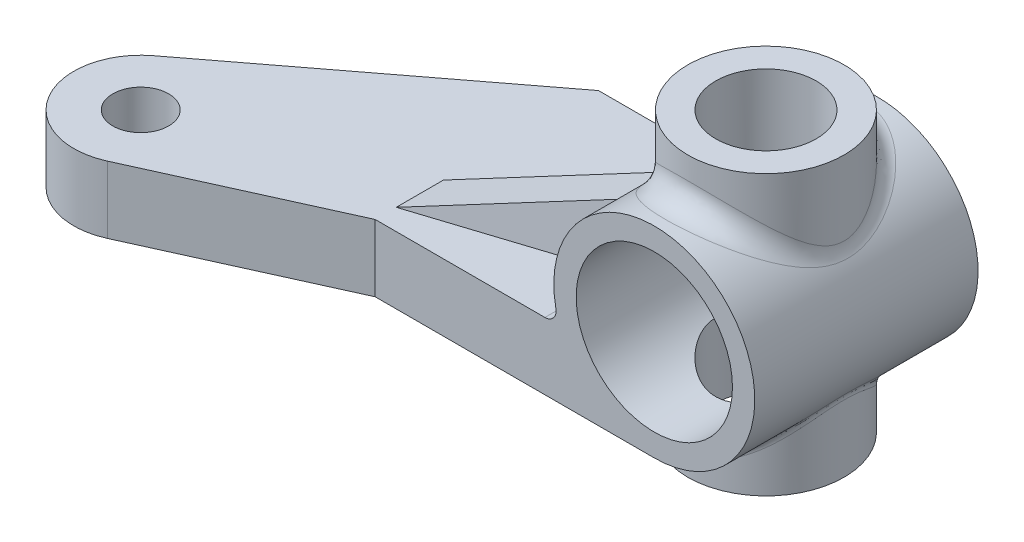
ISO-10303-21;
HEADER;
FILE_DESCRIPTION(('STEP AP214'),'2;1');
FILE_NAME('part.step','',(''),(''),'','','');
FILE_SCHEMA(('AUTOMOTIVE_DESIGN { 1 0 10303 214 1 1 1 1 }'));
ENDSEC;
DATA;
#1=APPLICATION_CONTEXT('core data for automotive mechanical design processes');
#2=APPLICATION_PROTOCOL_DEFINITION('international standard','automotive_design',2000,#1);
#3=PRODUCT_CONTEXT('',#1,'mechanical');
#4=PRODUCT('Part','Part','',(#3));
#5=PRODUCT_RELATED_PRODUCT_CATEGORY('part','',(#4));
#6=PRODUCT_DEFINITION_FORMATION('','',#4);
#7=PRODUCT_DEFINITION_CONTEXT('part definition',#1,'design');
#8=PRODUCT_DEFINITION('design','',#6,#7);
#9=PRODUCT_DEFINITION_SHAPE('','',#8);
#10=(LENGTH_UNIT() NAMED_UNIT(*) SI_UNIT(.MILLI.,.METRE.));
#11=(NAMED_UNIT(*) PLANE_ANGLE_UNIT() SI_UNIT($,.RADIAN.));
#12=(NAMED_UNIT(*) SI_UNIT($,.STERADIAN.) SOLID_ANGLE_UNIT());
#13=UNCERTAINTY_MEASURE_WITH_UNIT(LENGTH_MEASURE(1.E-05),#10,'distance_accuracy_value','');
#14=(GEOMETRIC_REPRESENTATION_CONTEXT(3) GLOBAL_UNCERTAINTY_ASSIGNED_CONTEXT((#13)) GLOBAL_UNIT_ASSIGNED_CONTEXT((#10,
#11,#12)) REPRESENTATION_CONTEXT('',''));
#15=CARTESIAN_POINT('',(0.,0.,0.));
#16=DIRECTION('',(0.,0.,1.));
#17=DIRECTION('',(1.,0.,0.));
#18=AXIS2_PLACEMENT_3D('',#15,#16,#17);
#19=CARTESIAN_POINT('',(0.,6.5,5.00000000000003));
#20=DIRECTION('',(0.,-1.,0.));
#21=DIRECTION('',(0.,0.,-1.));
#22=AXIS2_PLACEMENT_3D('',#19,#20,#21);
#23=CYLINDRICAL_SURFACE('',#22,2.25);
#24=CARTESIAN_POINT('',(0.,3.5,2.75000000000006));
#25=CARTESIAN_POINT('',(0.113738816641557,3.49999119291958,2.75000955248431));
#26=CARTESIAN_POINT('',(0.227593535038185,3.49439882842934,2.75868254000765));
#27=CARTESIAN_POINT('',(0.451768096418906,3.47255660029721,2.79289437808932));
#28=CARTESIAN_POINT('',(0.562081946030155,3.45628957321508,2.81846039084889));
#29=CARTESIAN_POINT('',(0.77551121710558,3.41472525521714,2.88493108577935));
#30=CARTESIAN_POINT('',(0.878659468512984,3.38947291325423,2.92575946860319));
#31=CARTESIAN_POINT('',(1.07625316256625,3.33200881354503,3.0210545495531));
#32=CARTESIAN_POINT('',(1.17069902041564,3.29979738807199,3.07552059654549));
#33=CARTESIAN_POINT('',(1.356978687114,3.22790565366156,3.20145309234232));
#34=CARTESIAN_POINT('',(1.44796097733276,3.18782921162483,3.27394835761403));
#35=CARTESIAN_POINT('',(1.61729525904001,3.10535791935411,3.43147970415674));
#36=CARTESIAN_POINT('',(1.69562936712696,3.0629598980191,3.51653322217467));
#37=CARTESIAN_POINT('',(1.84901805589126,2.97323207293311,3.71114664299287));
#38=CARTESIAN_POINT('',(1.92195328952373,2.92607768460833,3.82247173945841));
#39=CARTESIAN_POINT('',(2.04791346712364,2.8393501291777,4.05852893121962));
#40=CARTESIAN_POINT('',(2.10097263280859,2.79976398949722,4.18323750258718));
#41=CARTESIAN_POINT('',(2.17304928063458,2.7439651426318,4.40817441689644));
#42=CARTESIAN_POINT('',(2.19740042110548,2.72432365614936,4.50583620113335));
#43=CARTESIAN_POINT('',(2.2328557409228,2.69534702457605,4.70496773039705));
#44=CARTESIAN_POINT('',(2.24398033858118,2.68599599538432,4.80643135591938));
#45=CARTESIAN_POINT('',(2.25230141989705,2.67902501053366,5.01067405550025));
#46=CARTESIAN_POINT('',(2.24945350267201,2.68144245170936,5.11345628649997));
#47=CARTESIAN_POINT('',(2.22992944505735,2.69769580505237,5.31680925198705));
#48=CARTESIAN_POINT('',(2.21324184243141,2.71154118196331,5.41737808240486));
#49=CARTESIAN_POINT('',(2.16777860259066,2.74800659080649,5.610565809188));
#50=CARTESIAN_POINT('',(2.13939630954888,2.77033941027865,5.7033348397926));
#51=CARTESIAN_POINT('',(2.07174777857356,2.82128517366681,5.8829392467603));
#52=CARTESIAN_POINT('',(2.03247793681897,2.84990019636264,5.96977264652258));
#53=CARTESIAN_POINT('',(1.93540683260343,2.91690102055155,6.15301552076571));
#54=CARTESIAN_POINT('',(1.87548670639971,2.95610468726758,6.24800194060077));
#55=CARTESIAN_POINT('',(1.7426430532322,3.036318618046,6.42765444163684));
#56=CARTESIAN_POINT('',(1.66970402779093,3.07733099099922,6.51230801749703));
#57=CARTESIAN_POINT('',(1.49698535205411,3.16545259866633,6.68495764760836));
#58=CARTESIAN_POINT('',(1.39473666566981,3.2122796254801,6.77065484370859));
#59=CARTESIAN_POINT('',(1.1747338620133,3.2990813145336,6.92364093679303));
#60=CARTESIAN_POINT('',(1.05699633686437,3.33906320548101,6.99094929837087));
#61=CARTESIAN_POINT('',(0.833234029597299,3.40094230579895,7.0928919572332));
#62=CARTESIAN_POINT('',(0.72951233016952,3.42485324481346,7.13135806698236));
#63=CARTESIAN_POINT('',(0.515961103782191,3.46345539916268,7.19285237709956));
#64=CARTESIAN_POINT('',(0.40613659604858,3.47815407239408,7.21589306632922));
#65=CARTESIAN_POINT('',(0.182975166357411,3.49701240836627,7.2453788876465));
#66=CARTESIAN_POINT('',(0.0696274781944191,3.50113570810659,7.25176676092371));
#67=CARTESIAN_POINT('',(-0.156604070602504,3.49832391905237,7.24739261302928));
#68=CARTESIAN_POINT('',(-0.26948790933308,3.4913883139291,7.23662979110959));
#69=CARTESIAN_POINT('',(-0.485132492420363,3.46782019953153,7.19965068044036));
#70=CARTESIAN_POINT('',(-0.588108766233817,3.45174093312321,7.17431519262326));
#71=CARTESIAN_POINT('',(-0.788075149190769,3.41164874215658,7.11008883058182));
#72=CARTESIAN_POINT('',(-0.885064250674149,3.38763448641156,7.07119568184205));
#73=CARTESIAN_POINT('',(-1.07813136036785,3.33143639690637,6.97799198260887));
#74=CARTESIAN_POINT('',(-1.17362689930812,3.29878443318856,6.92276380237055));
#75=CARTESIAN_POINT('',(-1.35443959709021,3.22876333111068,6.7999878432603));
#76=CARTESIAN_POINT('',(-1.43974894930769,3.19139061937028,6.73243071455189));
#77=CARTESIAN_POINT('',(-1.61153716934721,3.10859627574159,6.57512586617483));
#78=CARTESIAN_POINT('',(-1.69618647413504,3.06281958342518,6.48356374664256));
#79=CARTESIAN_POINT('',(-1.84958457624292,2.9727009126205,6.28726783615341));
#80=CARTESIAN_POINT('',(-1.91832948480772,2.92835928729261,6.18253083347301));
#81=CARTESIAN_POINT('',(-2.03038607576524,2.85158314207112,5.97569155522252));
#82=CARTESIAN_POINT('',(-2.07585601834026,2.81834952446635,5.87506261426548));
#83=CARTESIAN_POINT('',(-2.15203394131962,2.76062407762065,5.6660235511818));
#84=CARTESIAN_POINT('',(-2.18276216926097,2.736120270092,5.55762433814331));
#85=CARTESIAN_POINT('',(-2.22797963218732,2.69944386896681,5.33420377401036));
#86=CARTESIAN_POINT('',(-2.24230813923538,2.6873934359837,5.21912830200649));
#87=CARTESIAN_POINT('',(-2.25294115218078,2.67849267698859,4.98759337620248));
#88=CARTESIAN_POINT('',(-2.24926031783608,2.68162998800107,4.87113512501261));
#89=CARTESIAN_POINT('',(-2.22614149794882,2.70082286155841,4.65869514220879));
#90=CARTESIAN_POINT('',(-2.20912929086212,2.71488703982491,4.56224473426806));
#91=CARTESIAN_POINT('',(-2.16329820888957,2.75154486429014,4.37385781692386));
#92=CARTESIAN_POINT('',(-2.13446736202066,2.77414715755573,4.28192599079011));
#93=CARTESIAN_POINT('',(-2.05430490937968,2.83427438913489,4.07330367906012));
#94=CARTESIAN_POINT('',(-1.9986437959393,2.87425781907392,3.95898918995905));
#95=CARTESIAN_POINT('',(-1.8701334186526,2.95948565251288,3.74262812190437));
#96=CARTESIAN_POINT('',(-1.79726085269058,3.00473714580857,3.64059846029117));
#97=CARTESIAN_POINT('',(-1.6347673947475,3.09617944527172,3.44887169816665));
#98=CARTESIAN_POINT('',(-1.54495162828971,3.14237496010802,3.35934161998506));
#99=CARTESIAN_POINT('',(-1.35039629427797,3.23076872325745,3.19581289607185));
#100=CARTESIAN_POINT('',(-1.24565615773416,3.27296681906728,3.121814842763));
#101=CARTESIAN_POINT('',(-1.01864775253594,3.35069832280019,2.98936219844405));
#102=CARTESIAN_POINT('',(-0.895884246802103,3.38593714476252,2.93156300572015));
#103=CARTESIAN_POINT('',(-0.703765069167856,3.42914724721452,2.86180687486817));
#104=CARTESIAN_POINT('',(-0.638449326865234,3.44193649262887,2.84138776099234));
#105=CARTESIAN_POINT('',(-0.505678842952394,3.46392846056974,2.80648968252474));
#106=CARTESIAN_POINT('',(-0.438225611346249,3.47313365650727,2.79200662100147));
#107=CARTESIAN_POINT('',(-0.309152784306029,3.48685763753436,2.77048508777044));
#108=CARTESIAN_POINT('',(-0.247679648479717,3.49177196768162,2.76281667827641));
#109=CARTESIAN_POINT('',(-0.12414919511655,3.49834557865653,2.75257148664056));
#110=CARTESIAN_POINT('',(-0.0620918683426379,3.50000480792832,2.74999478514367));
#111=CARTESIAN_POINT('',(0.,3.5,2.75000000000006));
#112=B_SPLINE_CURVE_WITH_KNOTS('',3,(#24,#25,#26,#27,#28,#29,#30,#31,#32,#33,#34,#35,#36,#37,
#38,#39,#40,#41,#42,#43,#44,#45,#46,#47,#48,#49,#50,#51,#52,#53,#54,#55,#56,#57,#58,#59,#60,#61,
#62,#63,#64,#65,#66,#67,#68,#69,#70,#71,#72,#73,#74,#75,#76,#77,#78,#79,#80,#81,#82,#83,#84,#85,
#86,#87,#88,#89,#90,#91,#92,#93,#94,#95,#96,#97,#98,#99,#100,#101,#102,#103,#104,#105,#106,#107,
#108,#109,#110,#111),.UNSPECIFIED.,.T.,.F.,(4,2,2,2,2,2,2,2,2,2,2,2,2,2,2,2,2,2,2,2,2,2,2,2,2,2,
2,2,2,2,2,2,2,2,2,2,2,2,2,2,2,2,2,4),(0.,0.340967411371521,0.682484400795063,1.02231643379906,
1.3621322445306,1.7298556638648,2.09809454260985,2.51968329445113,2.94054280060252,
3.24694073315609,3.55286505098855,3.8597621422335,4.16691366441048,4.46448315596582,
4.76215126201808,5.11772407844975,5.47372304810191,5.89583509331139,6.31749858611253,
6.65559516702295,6.99341768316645,7.33240024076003,7.67139862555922,7.99178668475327,
8.31222852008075,8.65604356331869,9.00012043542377,9.39699940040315,9.79397530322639,
10.1386110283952,10.4827720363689,10.8302779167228,11.1775009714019,11.4730651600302,
11.7689294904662,12.1666796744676,12.5649714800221,12.968159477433,13.3713628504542,
13.7890802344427,13.9976203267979,14.2060162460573,14.3921529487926,14.5782925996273),.UNSPECIFIED.);
#113=CARTESIAN_POINT('',(0.,3.5,2.75000000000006));
#114=VERTEX_POINT('',#113);
#115=EDGE_CURVE('E188',#114,#114,#112,.T.);
#116=ORIENTED_EDGE('',*,*,#115,.T.);
#117=EDGE_LOOP('',(#116));
#118=FACE_BOUND('',#117,.T.);
#119=CARTESIAN_POINT('',(0.,6.5,5.00000000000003));
#120=DIRECTION('',(0.,-1.,0.));
#121=DIRECTION('',(0.,0.,-1.));
#122=AXIS2_PLACEMENT_3D('',#119,#120,#121);
#123=CIRCLE('',#122,2.25);
#124=CARTESIAN_POINT('',(0.,6.5,2.75000000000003));
#125=VERTEX_POINT('',#124);
#126=EDGE_CURVE('E181',#125,#125,#123,.T.);
#127=ORIENTED_EDGE('',*,*,#126,.F.);
#128=EDGE_LOOP('',(#127));
#129=FACE_BOUND('',#128,.T.);
#130=ADVANCED_FACE('F34',(#118,#129),#23,.F.);
#131=CARTESIAN_POINT('',(0.,0.,10.));
#132=DIRECTION('',(0.,0.,-1.));
#133=DIRECTION('',(-1.,0.,0.));
#134=AXIS2_PLACEMENT_3D('',#131,#132,#133);
#135=CYLINDRICAL_SURFACE('',#134,4.5);
#136=CARTESIAN_POINT('',(0.594292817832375,4.46058472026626,9.44099135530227));
#137=CARTESIAN_POINT('',(0.439005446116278,4.4812739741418,8.47470276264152));
#138=CARTESIAN_POINT('',(0.564945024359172,5.45182576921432,8.45410438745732));
#139=CARTESIAN_POINT('',(0.422341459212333,4.48349104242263,9.47536087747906));
#140=CARTESIAN_POINT('',(0.307700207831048,4.49265524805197,8.49004044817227));
#141=CARTESIAN_POINT('',(0.401485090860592,5.4798223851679,8.4808362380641));
#142=CARTESIAN_POINT('',(0.247069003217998,4.49664914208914,9.49499375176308));
#143=CARTESIAN_POINT('',(0.180006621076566,4.49846487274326,8.49792154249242));
#144=CARTESIAN_POINT('',(0.234868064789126,5.49590450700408,8.49610625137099));
#145=CARTESIAN_POINT('',(-0.104288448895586,4.50221821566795,9.50331422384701));
#146=CARTESIAN_POINT('',(-0.0761778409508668,4.50101937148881,8.50137996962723));
#147=CARTESIAN_POINT('',(-0.0991384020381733,5.50271115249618,8.50257772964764));
#148=CARTESIAN_POINT('',(-0.280373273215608,4.49463339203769,9.49200808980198));
#149=CARTESIAN_POINT('',(-0.203218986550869,4.49773793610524,8.49692164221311));
#150=CARTESIAN_POINT('',(-0.266527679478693,5.49344081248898,8.49378406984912));
#151=CARTESIAN_POINT('',(-0.613118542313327,4.46091604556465,9.44150908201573));
#152=CARTESIAN_POINT('',(-0.451722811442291,4.48156873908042,8.47509426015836));
#153=CARTESIAN_POINT('',(-0.582841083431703,5.4522307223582,8.45450706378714));
#154=CARTESIAN_POINT('',(-0.770188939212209,4.43635302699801,9.40467532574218));
#155=CARTESIAN_POINT('',(-0.571580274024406,4.46964134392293,8.45901672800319));
#156=CARTESIAN_POINT('',(-0.732154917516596,5.42220925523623,8.42585858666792));
#157=CARTESIAN_POINT('',(-1.07622176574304,4.37220914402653,9.30779825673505));
#158=CARTESIAN_POINT('',(-0.815965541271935,4.43497175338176,8.41245425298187));
#159=CARTESIAN_POINT('',(-1.02307501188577,5.34381117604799,8.35050975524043));
#160=CARTESIAN_POINT('',(-1.22518167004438,4.33262363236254,9.24774776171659));
#161=CARTESIAN_POINT('',(-0.939598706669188,4.41251515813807,8.38235104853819));
#162=CARTESIAN_POINT('',(-1.16467887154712,5.29542888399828,8.30380381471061));
#163=CARTESIAN_POINT('',(-1.52192949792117,4.23787717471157,9.1025108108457));
#164=CARTESIAN_POINT('',(-1.197227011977,4.35334053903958,8.30286988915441));
#165=CARTESIAN_POINT('',(-1.44677248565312,5.17962765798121,8.19084174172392));
#166=CARTESIAN_POINT('',(-1.66897183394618,4.18185116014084,9.01591112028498));
#167=CARTESIAN_POINT('',(-1.33086927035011,4.3161736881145,8.25288376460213));
#168=CARTESIAN_POINT('',(-1.58655347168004,5.11115141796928,8.12348642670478));
#169=CARTESIAN_POINT('',(-1.94896340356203,4.05893427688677,8.82287807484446));
#170=CARTESIAN_POINT('',(-1.59571184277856,4.22777970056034,8.13279092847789));
#171=CARTESIAN_POINT('',(-1.85271829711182,4.96091967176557,7.97334961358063));
#172=CARTESIAN_POINT('',(-2.08191217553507,3.99204305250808,8.71644407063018));
#173=CARTESIAN_POINT('',(-1.72666911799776,4.17700327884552,8.0633218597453));
#174=CARTESIAN_POINT('',(-1.97910169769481,4.87916373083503,7.89056761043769));
#175=CARTESIAN_POINT('',(-2.35749576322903,3.83690601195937,8.46412337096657));
#176=CARTESIAN_POINT('',(-2.00548039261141,4.05251135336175,7.88980665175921));
#177=CARTESIAN_POINT('',(-2.24107621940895,4.68955179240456,7.69431817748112));
#178=CARTESIAN_POINT('',(-2.49697107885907,3.7470387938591,8.31459021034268));
#179=CARTESIAN_POINT('',(-2.15271478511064,3.9763861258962,7.78194731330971));
#180=CARTESIAN_POINT('',(-2.37366386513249,4.57971408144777,7.57801460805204));
#181=CARTESIAN_POINT('',(-2.75484814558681,3.5617500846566,7.99396350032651));
#182=CARTESIAN_POINT('',(-2.43083774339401,3.81208101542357,7.54018031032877));
#183=CARTESIAN_POINT('',(-2.61880626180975,4.35325010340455,7.32863827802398));
#184=CARTESIAN_POINT('',(-2.87318560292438,3.46631278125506,7.82280678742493));
#185=CARTESIAN_POINT('',(-2.56241502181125,3.72404210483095,7.40668977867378));
#186=CARTESIAN_POINT('',(-2.73129989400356,4.23660451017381,7.19551639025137));
#187=CARTESIAN_POINT('',(-3.04639053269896,3.31319144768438,7.53086373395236));
#188=CARTESIAN_POINT('',(-2.75827603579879,3.57812804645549,7.17133663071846));
#189=CARTESIAN_POINT('',(-2.89595149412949,4.04945621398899,6.96844957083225));
#190=CARTESIAN_POINT('',(-3.10808346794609,3.25520859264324,7.4162592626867));
#191=CARTESIAN_POINT('',(-2.82857849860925,3.52215948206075,7.07799753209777));
#192=CARTESIAN_POINT('',(-2.95459786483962,3.97858828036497,6.87931275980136));
#193=CARTESIAN_POINT('',(-3.22318300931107,3.14127988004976,7.17939467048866));
#194=CARTESIAN_POINT('',(-2.96054053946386,3.41081635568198,6.88263784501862));
#195=CARTESIAN_POINT('',(-3.06401347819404,3.83934207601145,6.69508474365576));
#196=CARTESIAN_POINT('',(-3.27658474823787,3.08533523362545,7.0571301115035));
#197=CARTESIAN_POINT('',(-3.02241205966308,3.35534973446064,6.78058168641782));
#198=CARTESIAN_POINT('',(-3.11477809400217,3.77096528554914,6.59999008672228));
#199=CARTESIAN_POINT('',(-3.37450138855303,2.97791911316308,6.8052069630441));
#200=CARTESIAN_POINT('',(-3.13631286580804,3.24789710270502,6.56828515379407));
#201=CARTESIAN_POINT('',(-3.20785934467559,3.63967891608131,6.40404986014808));
#202=CARTESIAN_POINT('',(-3.41904759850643,2.92643225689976,6.67557658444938));
#203=CARTESIAN_POINT('',(-3.18858583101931,3.19576924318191,6.45799295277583));
#204=CARTESIAN_POINT('',(-3.25020574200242,3.57675053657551,6.30322623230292));
#205=CARTESIAN_POINT('',(-3.4987671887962,2.83063631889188,6.40844128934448));
#206=CARTESIAN_POINT('',(-3.28233539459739,3.09822305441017,6.22916679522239));
#207=CARTESIAN_POINT('',(-3.32598856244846,3.45966661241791,6.09545433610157));
#208=CARTESIAN_POINT('',(-3.53395312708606,2.78631765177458,6.27094722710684));
#209=CARTESIAN_POINT('',(-3.32402413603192,3.05263329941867,6.11049207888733));
#210=CARTESIAN_POINT('',(-3.35943692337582,3.40549935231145,5.98851450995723));
#211=CARTESIAN_POINT('',(-3.59492588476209,2.70723202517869,5.98345990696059));
#212=CARTESIAN_POINT('',(-3.39628456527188,2.97106537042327,5.86129562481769));
#213=CARTESIAN_POINT('',(-3.41739868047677,3.30883914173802,5.76491326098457));
#214=CARTESIAN_POINT('',(-3.62037949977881,2.67281227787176,5.83320862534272));
#215=CARTESIAN_POINT('',(-3.42665886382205,2.93523843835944,5.73023180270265));
#216=CARTESIAN_POINT('',(-3.44159532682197,3.26677056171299,5.6480511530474));
#217=CARTESIAN_POINT('',(-3.64914384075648,2.63325086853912,5.60319586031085));
#218=CARTESIAN_POINT('',(-3.46097876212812,2.89401647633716,5.52898403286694));
#219=CARTESIAN_POINT('',(-3.46893920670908,3.21841772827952,5.4691523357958));
#220=CARTESIAN_POINT('',(-3.65715999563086,2.62207915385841,5.52581493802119));
#221=CARTESIAN_POINT('',(-3.47054898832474,2.88235935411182,5.46122918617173));
#222=CARTESIAN_POINT('',(-3.47655950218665,3.20476341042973,5.4089671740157));
#223=CARTESIAN_POINT('',(-3.66991706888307,2.60419501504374,5.36990151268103));
#224=CARTESIAN_POINT('',(-3.48577525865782,2.86369687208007,5.32462709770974));
#225=CARTESIAN_POINT('',(-3.48868659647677,3.18290501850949,5.28770117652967));
#226=CARTESIAN_POINT('',(-3.67465947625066,2.59748056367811,5.29136954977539));
#227=CARTESIAN_POINT('',(-3.49144519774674,2.85667477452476,5.25572797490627));
#228=CARTESIAN_POINT('',(-3.49319481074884,3.17469846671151,5.2266207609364));
#229=CARTESIAN_POINT('',(-3.68077959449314,2.58880096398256,5.13317769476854));
#230=CARTESIAN_POINT('',(-3.49875713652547,2.84760293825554,5.11693006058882));
#231=CARTESIAN_POINT('',(-3.49901270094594,3.16409006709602,5.10358265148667));
#232=CARTESIAN_POINT('',(-3.68213420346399,2.58686842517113,5.05351376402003));
#233=CARTESIAN_POINT('',(-3.50037762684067,2.84557973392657,5.04696957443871));
#234=CARTESIAN_POINT('',(-3.5003004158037,3.16172807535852,5.04162181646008));
#235=CARTESIAN_POINT('',(-3.68137819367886,2.58794414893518,4.89426332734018));
#236=CARTESIAN_POINT('',(-3.49947418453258,2.84670456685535,4.9071839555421));
#237=CARTESIAN_POINT('',(-3.49958173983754,3.16304284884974,4.91776036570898));
#238=CARTESIAN_POINT('',(-3.67926765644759,2.59095229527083,4.81467681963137));
#239=CARTESIAN_POINT('',(-3.49694958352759,2.84985343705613,4.83729959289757));
#240=CARTESIAN_POINT('',(-3.49757542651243,3.16671947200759,4.85585974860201));
#241=CARTESIAN_POINT('',(-3.67162937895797,2.6017649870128,4.65615138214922));
#242=CARTESIAN_POINT('',(-3.48782511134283,2.86115197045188,4.69824103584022));
#243=CARTESIAN_POINT('',(-3.49031434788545,3.17993498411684,4.73256218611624));
#244=CARTESIAN_POINT('',(-3.66609771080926,2.60957504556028,4.57721330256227));
#245=CARTESIAN_POINT('',(-3.48121293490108,2.86931677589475,4.62901045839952));
#246=CARTESIAN_POINT('',(-3.48505584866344,3.18948061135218,4.67116590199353));
#247=CARTESIAN_POINT('',(-3.65174413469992,2.62962248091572,4.42061573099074));
#248=CARTESIAN_POINT('',(-3.46408676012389,2.89022584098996,4.49187320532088));
#249=CARTESIAN_POINT('',(-3.47141109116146,3.21398303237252,4.54936779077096));
#250=CARTESIAN_POINT('',(-3.64292039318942,2.64186232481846,4.34295697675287));
#251=CARTESIAN_POINT('',(-3.45355689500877,2.90298904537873,4.42391492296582));
#252=CARTESIAN_POINT('',(-3.46302308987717,3.22894284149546,4.4889665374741));
#253=CARTESIAN_POINT('',(-3.60632427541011,2.69191523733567,4.07242183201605));
#254=CARTESIAN_POINT('',(-3.40987868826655,2.95514068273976,4.18721571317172));
#255=CARTESIAN_POINT('',(-3.42823418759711,3.29011862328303,4.27855031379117));
#256=CARTESIAN_POINT('',(-3.57015113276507,2.74029882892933,3.88406413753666));
#257=CARTESIAN_POINT('',(-3.36668551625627,3.005488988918,4.02313142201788));
#258=CARTESIAN_POINT('',(-3.39384737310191,3.34925412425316,4.13204988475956));
#259=CARTESIAN_POINT('',(-3.48076484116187,2.85296350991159,3.52098635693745));
#260=CARTESIAN_POINT('',(-3.26103661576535,3.12116008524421,3.70970244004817));
#261=CARTESIAN_POINT('',(-3.3088752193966,3.48695540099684,3.84965605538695));
#262=CARTESIAN_POINT('',(-3.42749882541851,2.91729377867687,3.3463107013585));
#263=CARTESIAN_POINT('',(-3.19810275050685,3.18691954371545,3.55995989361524));
#264=CARTESIAN_POINT('',(-3.25823962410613,3.56558128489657,3.71379721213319));
#265=CARTESIAN_POINT('',(-3.32053022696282,3.03791972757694,3.05101788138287));
#266=CARTESIAN_POINT('',(-3.07346253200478,3.30806208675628,3.31025840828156));
#267=CARTESIAN_POINT('',(-3.15655342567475,3.71301300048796,3.48412501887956));
#268=CARTESIAN_POINT('',(-3.27002602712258,3.0924158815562,2.92751729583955));
#269=CARTESIAN_POINT('',(-3.0147127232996,3.36244974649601,3.20654384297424));
#270=CARTESIAN_POINT('',(-3.1085432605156,3.77961941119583,3.38806900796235));
#271=CARTESIAN_POINT('',(-3.16069948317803,3.20407277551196,2.68797279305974));
#272=CARTESIAN_POINT('',(-2.88878123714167,3.47238867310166,3.00760675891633));
#273=CARTESIAN_POINT('',(-3.00461555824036,3.91608894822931,3.20175661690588));
#274=CARTESIAN_POINT('',(-3.10187324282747,3.26123475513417,2.57193240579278));
#275=CARTESIAN_POINT('',(-2.82138401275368,3.52804305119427,2.91234311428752));
#276=CARTESIAN_POINT('',(-2.94869431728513,3.98595358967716,3.11150298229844));
#277=CARTESIAN_POINT('',(-2.97607984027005,3.37642193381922,2.34714607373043));
#278=CARTESIAN_POINT('',(-2.67896699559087,3.63836206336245,2.730365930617));
#279=CARTESIAN_POINT('',(-2.8291129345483,4.12673791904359,2.93666916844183));
#280=CARTESIAN_POINT('',(-2.90910646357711,3.43444776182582,2.23840579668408));
#281=CARTESIAN_POINT('',(-2.60373247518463,3.69308385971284,2.64366763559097));
#282=CARTESIAN_POINT('',(-2.76544688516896,4.19765837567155,2.85209339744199));
#283=CARTESIAN_POINT('',(-2.76715399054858,3.54982509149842,2.02844590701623));
#284=CARTESIAN_POINT('',(-2.4465176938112,3.79978793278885,2.4790959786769));
#285=CARTESIAN_POINT('',(-2.63050441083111,4.3386751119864,2.68879126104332));
#286=CARTESIAN_POINT('',(-2.69217076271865,3.60717622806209,1.92723022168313));
#287=CARTESIAN_POINT('',(-2.36434187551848,3.85177726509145,2.40129072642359));
#288=CARTESIAN_POINT('',(-2.55922405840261,4.40877094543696,2.61006795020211));
#289=CARTESIAN_POINT('',(-2.45200424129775,3.77844928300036,1.63151759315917));
#290=CARTESIAN_POINT('',(-2.10340764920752,4.00454609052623,2.17689978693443));
#291=CARTESIAN_POINT('',(-2.33091761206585,4.6181046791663,2.38006923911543));
#292=CARTESIAN_POINT('',(-2.27395914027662,3.889322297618,1.44920544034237));
#293=CARTESIAN_POINT('',(-1.91669553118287,4.09685279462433,2.04764103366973));
#294=CARTESIAN_POINT('',(-2.16166486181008,4.75361614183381,2.2382708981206));
#295=CARTESIAN_POINT('',(-1.98314944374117,4.04092944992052,1.20585633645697));
#296=CARTESIAN_POINT('',(-1.63063679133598,4.21372458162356,1.88647153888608));
#297=CARTESIAN_POINT('',(-1.88521613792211,4.93891377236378,2.04899937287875));
#298=CARTESIAN_POINT('',(-1.88234032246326,4.08898423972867,1.12980558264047));
#299=CARTESIAN_POINT('',(-1.53296845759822,4.24939654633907,1.837797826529));
#300=CARTESIAN_POINT('',(-1.78938524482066,4.99764740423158,1.98984878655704));
#301=CARTESIAN_POINT('',(-1.67309851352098,4.17895714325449,0.988804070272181));
#302=CARTESIAN_POINT('',(-1.33619615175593,4.31346764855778,1.75085373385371));
#303=CARTESIAN_POINT('',(-1.59047636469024,5.10761428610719,1.88018094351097));
#304=CARTESIAN_POINT('',(-1.56467045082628,4.22087893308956,0.923846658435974));
#305=CARTESIAN_POINT('',(-1.23720435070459,4.34168639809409,1.71283806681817));
#306=CARTESIAN_POINT('',(-1.48740277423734,5.15885202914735,1.82965851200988));
#307=CARTESIAN_POINT('',(-1.30219087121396,4.31040189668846,0.786098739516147));
#308=CARTESIAN_POINT('',(-1.00472131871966,4.3993599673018,1.63527825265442));
#309=CARTESIAN_POINT('',(-1.23788514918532,5.26826898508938,1.72252124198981));
#310=CARTESIAN_POINT('',(-1.14529241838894,4.35498267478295,0.718321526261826));
#311=CARTESIAN_POINT('',(-0.872574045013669,4.42525058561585,1.60058630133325));
#312=CARTESIAN_POINT('',(-1.08873476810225,5.32275660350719,1.66980563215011));
#313=CARTESIAN_POINT('',(-0.822004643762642,4.42737137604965,0.608818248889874));
#314=CARTESIAN_POINT('',(-0.611635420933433,4.46514965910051,1.54702835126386));
#315=CARTESIAN_POINT('',(-0.781411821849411,5.41123168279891,1.58463641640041));
#316=CARTESIAN_POINT('',(-0.65563457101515,4.45521207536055,0.567041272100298));
#317=CARTESIAN_POINT('',(-0.483872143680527,4.47881456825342,1.52862147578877));
#318=CARTESIAN_POINT('',(-0.623257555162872,5.44525920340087,1.55214321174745));
#319=CARTESIAN_POINT('',(-0.381528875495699,4.48505225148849,0.522338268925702));
#320=CARTESIAN_POINT('',(-0.278846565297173,4.49313873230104,1.50928873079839));
#321=CARTESIAN_POINT('',(-0.362687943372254,5.48173052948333,1.51737420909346));
#322=CARTESIAN_POINT('',(-0.275311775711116,4.49283527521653,0.510705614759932));
#323=CARTESIAN_POINT('',(-0.200856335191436,4.49671414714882,1.50444886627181));
#324=CARTESIAN_POINT('',(-0.261716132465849,5.49124311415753,1.5083265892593));
#325=CARTESIAN_POINT('',(-0.0621509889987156,4.50083577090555,0.498750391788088));
#326=CARTESIAN_POINT('',(-0.0450668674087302,4.50038931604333,1.49947317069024));
#327=CARTESIAN_POINT('',(-0.0590818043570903,5.50102149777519,1.49902808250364));
#328=CARTESIAN_POINT('',(0.0447928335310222,4.50105178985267,0.498429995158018));
#329=CARTESIAN_POINT('',(0.032412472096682,4.50047332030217,1.49935865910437));
#330=CARTESIAN_POINT('',(0.0425808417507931,5.50128552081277,1.49877888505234));
#331=CARTESIAN_POINT('',(0.330575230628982,4.49140288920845,0.512842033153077));
#332=CARTESIAN_POINT('',(0.241083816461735,4.4960838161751,1.50530361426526));
#333=CARTESIAN_POINT('',(0.314250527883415,5.48949242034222,1.50998824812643));
#334=CARTESIAN_POINT('',(0.508933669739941,4.47459466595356,0.537941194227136));
#335=CARTESIAN_POINT('',(0.372040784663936,4.4885326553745,1.51553265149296));
#336=CARTESIAN_POINT('',(0.483801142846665,5.46894903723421,1.52950981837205));
#337=CARTESIAN_POINT('',(0.857985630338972,4.42099593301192,0.618483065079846));
#338=CARTESIAN_POINT('',(0.640250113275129,4.46145214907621,1.551987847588));
#339=CARTESIAN_POINT('',(0.815615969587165,5.40343947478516,1.59215349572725));
#340=CARTESIAN_POINT('',(1.02866557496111,4.38417142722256,0.673977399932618));
#341=CARTESIAN_POINT('',(0.776119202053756,4.4421997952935,1.57784267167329));
#342=CARTESIAN_POINT('',(0.977867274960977,5.35843174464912,1.63531575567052));
#343=CARTESIAN_POINT('',(1.35660375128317,4.29399033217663,0.811279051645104));
#344=CARTESIAN_POINT('',(1.05143429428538,4.38901072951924,1.64920381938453));
#345=CARTESIAN_POINT('',(1.28961097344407,5.2482104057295,1.7421059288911));
#346=CARTESIAN_POINT('',(1.51394652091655,4.24074965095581,0.89290203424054));
#347=CARTESIAN_POINT('',(1.18984385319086,4.35566363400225,1.69392046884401));
#348=CARTESIAN_POINT('',(1.43918372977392,5.18313846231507,1.80559047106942));
#349=CARTESIAN_POINT('',(1.81392504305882,4.12138350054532,1.07863181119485));
#350=CARTESIAN_POINT('',(1.46590224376,4.27359604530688,1.80483480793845));
#351=CARTESIAN_POINT('',(1.7243484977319,5.03724650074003,1.95004696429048));
#352=CARTESIAN_POINT('',(1.95656190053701,4.05525900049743,1.1827369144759));
#353=CARTESIAN_POINT('',(1.60310765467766,4.22540067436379,1.87030504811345));
#354=CARTESIAN_POINT('',(1.85994155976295,4.95642766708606,2.0310176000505));
#355=CARTESIAN_POINT('',(2.27689335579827,3.88710073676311,1.45295078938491));
#356=CARTESIAN_POINT('',(1.92024354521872,4.09479803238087,2.05057414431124));
#357=CARTESIAN_POINT('',(2.16445417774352,4.75090090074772,2.24118394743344));
#358=CARTESIAN_POINT('',(2.44760576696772,3.7809132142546,1.62765532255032));
#359=CARTESIAN_POINT('',(2.09913637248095,4.00636904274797,2.17450218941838));
#360=CARTESIAN_POINT('',(2.32673634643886,4.62111615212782,2.37706525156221));
#361=CARTESIAN_POINT('',(2.68078141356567,3.61560569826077,1.91250053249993));
#362=CARTESIAN_POINT('',(2.35199996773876,3.8593085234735,2.39010924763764));
#363=CARTESIAN_POINT('',(2.54839714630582,4.41907363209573,2.59861152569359));
#364=CARTESIAN_POINT('',(2.7548473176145,3.55935064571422,2.01152320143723));
#365=CARTESIAN_POINT('',(2.43303851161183,3.80843927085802,2.4660587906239));
#366=CARTESIAN_POINT('',(2.61880547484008,4.35031745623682,2.67562915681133));
#367=CARTESIAN_POINT('',(2.89524795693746,3.4461060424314,2.21684841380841));
#368=CARTESIAN_POINT('',(2.5882920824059,3.70396602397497,2.62663224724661));
#369=CARTESIAN_POINT('',(2.75227274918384,4.21190738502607,2.83532654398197));
#370=CARTESIAN_POINT('',(2.96158594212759,3.38911681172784,2.32314786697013));
#371=CARTESIAN_POINT('',(2.66269074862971,3.6503579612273,2.71118948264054));
#372=CARTESIAN_POINT('',(2.8153347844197,4.14225388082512,2.91800389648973));
#373=CARTESIAN_POINT('',(3.08753944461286,3.27482228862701,2.54479553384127));
#374=CARTESIAN_POINT('',(2.80504890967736,3.54117988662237,2.89019161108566));
#375=CARTESIAN_POINT('',(2.93506836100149,4.00256057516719,3.09039652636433));
#376=CARTESIAN_POINT('',(3.14701779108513,3.21752877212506,2.66026908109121));
#377=CARTESIAN_POINT('',(2.87309904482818,3.48552340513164,2.98479466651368));
#378=CARTESIAN_POINT('',(2.99160950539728,3.93253516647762,3.1802092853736));
#379=CARTESIAN_POINT('',(3.25773048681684,3.10538190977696,2.89878349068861));
#380=CARTESIAN_POINT('',(3.00047264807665,3.37531456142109,3.18252234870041));
#381=CARTESIAN_POINT('',(3.09685490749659,3.79546677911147,3.36572049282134));
#382=CARTESIAN_POINT('',(3.30896068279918,3.05052980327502,3.02182812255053));
#383=CARTESIAN_POINT('',(3.0600044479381,3.3206629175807,3.2856931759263));
#384=CARTESIAN_POINT('',(3.14555521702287,3.72842531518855,3.46142187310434));
#385=CARTESIAN_POINT('',(3.40248378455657,2.94584521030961,3.27508984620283));
#386=CARTESIAN_POINT('',(3.1690739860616,3.21550501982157,3.4999390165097));
#387=CARTESIAN_POINT('',(3.23445989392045,3.60047747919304,3.65840321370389));
#388=CARTESIAN_POINT('',(3.44482056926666,2.89598874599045,3.40526752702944));
#389=CARTESIAN_POINT('',(3.21886215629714,3.16484565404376,3.61106290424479));
#390=CARTESIAN_POINT('',(3.27470597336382,3.53954180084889,3.75965252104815));
#391=CARTESIAN_POINT('',(3.52009749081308,2.80400392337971,3.67337669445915));
#392=CARTESIAN_POINT('',(3.30754880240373,3.07090042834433,3.84135557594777));
#393=CARTESIAN_POINT('',(3.34626551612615,3.42711590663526,3.96818187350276));
#394=CARTESIAN_POINT('',(3.55305087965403,2.76186469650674,3.81129691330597));
#395=CARTESIAN_POINT('',(3.34665185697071,3.02744135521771,3.96067598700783));
#396=CARTESIAN_POINT('',(3.37759157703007,3.37561240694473,4.07545315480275));
#397=CARTESIAN_POINT('',(3.60934248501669,2.68791739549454,4.09899961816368));
#398=CARTESIAN_POINT('',(3.41344600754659,2.95101996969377,4.21052222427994));
#399=CARTESIAN_POINT('',(3.43110334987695,3.28523237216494,4.29922192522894));
#400=CARTESIAN_POINT('',(3.63237230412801,2.65644640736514,4.24901073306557));
#401=CARTESIAN_POINT('',(3.44095315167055,2.91821081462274,4.34156638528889));
#402=CARTESIAN_POINT('',(3.45299589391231,3.24676783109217,4.41589723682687));
#403=CARTESIAN_POINT('',(3.657523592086,2.62158712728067,4.47816529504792));
#404=CARTESIAN_POINT('',(3.47097798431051,2.88185325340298,4.54223479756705));
#405=CARTESIAN_POINT('',(3.47690514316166,3.20416204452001,4.59412856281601));
#406=CARTESIAN_POINT('',(3.66434042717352,2.61202739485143,4.5551895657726));
#407=CARTESIAN_POINT('',(3.47912046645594,2.87186961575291,4.6097321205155));
#408=CARTESIAN_POINT('',(3.48338534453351,3.19247792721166,4.65403632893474));
#409=CARTESIAN_POINT('',(3.67472419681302,2.59739967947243,4.71018376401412));
#410=CARTESIAN_POINT('',(3.49151898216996,2.85659513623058,4.74561273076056));
#411=CARTESIAN_POINT('',(3.49325633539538,3.17459960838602,4.774587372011));
#412=CARTESIAN_POINT('',(3.67829254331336,2.59232974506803,4.78815326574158));
#413=CARTESIAN_POINT('',(3.49578651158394,2.85129029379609,4.81404804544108));
#414=CARTESIAN_POINT('',(3.49664846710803,3.16840302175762,4.83523031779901));
#415=CARTESIAN_POINT('',(3.68210316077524,2.58691490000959,4.94486552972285));
#416=CARTESIAN_POINT('',(3.50033984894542,2.84562936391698,4.95158268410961));
#417=CARTESIAN_POINT('',(3.50027090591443,3.16178487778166,4.95711763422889));
#418=CARTESIAN_POINT('',(3.68232820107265,2.58659446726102,5.02361020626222));
#419=CARTESIAN_POINT('',(3.50060878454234,2.8452942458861,5.02074026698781));
#420=CARTESIAN_POINT('',(3.50048483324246,3.16139323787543,5.01836349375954));
#421=CARTESIAN_POINT('',(3.67940866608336,2.59074368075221,5.18079998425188));
#422=CARTESIAN_POINT('',(3.49712064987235,2.84963156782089,5.15870526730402));
#423=CARTESIAN_POINT('',(3.49770947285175,3.16646449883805,5.14062220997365));
#424=CARTESIAN_POINT('',(3.6762641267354,2.59521327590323,5.25924508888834));
#425=CARTESIAN_POINT('',(3.49336074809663,2.85430752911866,5.22756941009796));
#426=CARTESIAN_POINT('',(3.49472021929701,3.17192733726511,5.20163506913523));
#427=CARTESIAN_POINT('',(3.661854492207,2.61555659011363,5.49340261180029));
#428=CARTESIAN_POINT('',(3.47613841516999,2.87557316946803,5.43300587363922));
#429=CARTESIAN_POINT('',(3.48102217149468,3.19679138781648,5.38375758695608));
#430=CARTESIAN_POINT('',(3.64561082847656,2.63836827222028,5.64782586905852));
#431=CARTESIAN_POINT('',(3.45668986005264,2.89945357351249,5.568408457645));
#432=CARTESIAN_POINT('',(3.46558066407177,3.22467233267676,5.50386456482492));
#433=CARTESIAN_POINT('',(3.59412234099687,2.70825361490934,5.99696858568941));
#434=CARTESIAN_POINT('',(3.39535107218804,2.97210045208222,5.87326967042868));
#435=CARTESIAN_POINT('',(3.41663481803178,3.31008775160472,5.77542001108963));
#436=CARTESIAN_POINT('',(3.55449807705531,2.76071290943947,6.18902054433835));
#437=CARTESIAN_POINT('',(3.34806973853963,3.02661384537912,6.04031858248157));
#438=CARTESIAN_POINT('',(3.37896730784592,3.37420466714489,5.92479375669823));
#439=CARTESIAN_POINT('',(3.45753304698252,2.88122110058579,6.55882227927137));
#440=CARTESIAN_POINT('',(3.23362617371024,3.1500479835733,6.35884795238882));
#441=CARTESIAN_POINT('',(3.28679067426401,3.52149245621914,6.21241732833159));
#442=CARTESIAN_POINT('',(3.4001334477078,2.9493215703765,6.73652205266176));
#443=CARTESIAN_POINT('',(3.16593062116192,3.21943583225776,6.51072321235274));
#444=CARTESIAN_POINT('',(3.23222562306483,3.60472636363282,6.35062826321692));
#445=CARTESIAN_POINT('',(3.28601742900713,3.0752914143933,7.03459399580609));
#446=CARTESIAN_POINT('',(3.03334635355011,3.34536982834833,6.76171553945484));
#447=CARTESIAN_POINT('',(3.12374496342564,3.75868950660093,6.58246199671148));
#448=CARTESIAN_POINT('',(3.23277596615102,3.13141265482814,7.15812577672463));
#449=CARTESIAN_POINT('',(2.97160503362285,3.40108999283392,6.86496199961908));
#450=CARTESIAN_POINT('',(3.07313270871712,3.82728213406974,6.67854227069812));
#451=CARTESIAN_POINT('',(3.11779260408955,3.24591271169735,7.39757034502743));
#452=CARTESIAN_POINT('',(2.83965346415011,3.51315024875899,7.06271310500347));
#453=CARTESIAN_POINT('',(2.96382753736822,3.96722664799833,6.86477693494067));
#454=CARTESIAN_POINT('',(3.05604668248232,3.30429258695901,7.51347948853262));
#455=CARTESIAN_POINT('',(2.76921777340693,3.56958726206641,7.1572473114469));
#456=CARTESIAN_POINT('',(2.90513079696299,4.03857982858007,6.95492849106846));
#457=CARTESIAN_POINT('',(2.92428376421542,3.42145255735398,7.73763841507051));
#458=CARTESIAN_POINT('',(2.62080352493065,3.68088341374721,7.33735421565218));
#459=CARTESIAN_POINT('',(2.77987468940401,4.18177534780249,7.12927432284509));
#460=CARTESIAN_POINT('',(2.85426996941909,3.48023248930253,7.84589113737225));
#461=CARTESIAN_POINT('',(2.54261169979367,3.73579183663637,7.42290866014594));
#462=CARTESIAN_POINT('',(2.71331836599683,4.25361748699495,7.21347088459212));
#463=CARTESIAN_POINT('',(2.7060212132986,3.59671331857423,8.05458237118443));
#464=CARTESIAN_POINT('',(2.37956400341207,3.84233254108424,7.58483100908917));
#465=CARTESIAN_POINT('',(2.57239053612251,4.39598294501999,7.37578628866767));
#466=CARTESIAN_POINT('',(2.62778455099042,3.65441398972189,8.15501925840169));
#467=CARTESIAN_POINT('',(2.29451285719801,3.89395908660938,7.66111667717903));
#468=CARTESIAN_POINT('',(2.49801741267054,4.4665059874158,7.45390386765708));
#469=CARTESIAN_POINT('',(2.40521957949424,3.80707132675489,8.4153125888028));
#470=CARTESIAN_POINT('',(2.05553380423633,4.02783635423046,7.8555130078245));
#471=CARTESIAN_POINT('',(2.28644330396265,4.65308717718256,7.65635423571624));
#472=CARTESIAN_POINT('',(2.25304830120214,3.89974855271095,8.56738954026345));
#473=CARTESIAN_POINT('',(1.89713940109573,4.10445111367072,7.9627383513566));
#474=CARTESIAN_POINT('',(2.14178665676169,4.76635934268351,7.77463630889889));
#475=CARTESIAN_POINT('',(1.9256577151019,4.07135026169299,8.84310385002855));
#476=CARTESIAN_POINT('',(1.5716170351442,4.23822361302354,8.14740692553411));
#477=CARTESIAN_POINT('',(1.83056350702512,4.9760947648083,7.98908077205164));
#478=CARTESIAN_POINT('',(1.75048130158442,4.15029971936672,8.96679298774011));
#479=CARTESIAN_POINT('',(1.40441745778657,4.29467786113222,8.22378607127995));
#480=CARTESIAN_POINT('',(1.66403778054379,5.0725885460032,8.0852834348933));
#481=CARTESIAN_POINT('',(1.41480046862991,4.27480687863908,9.15943829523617));
#482=CARTESIAN_POINT('',(1.10216551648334,4.3774445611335,8.33531494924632));
#483=CARTESIAN_POINT('',(1.34493377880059,5.22476396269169,8.23511867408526));
#484=CARTESIAN_POINT('',(1.25789503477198,4.32386291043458,9.23433768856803));
#485=CARTESIAN_POINT('',(0.966960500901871,4.40709024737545,8.3750508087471));
#486=CARTESIAN_POINT('',(1.19577676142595,5.28472133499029,8.29337375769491));
#487=CARTESIAN_POINT('',(0.933182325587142,4.40535126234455,9.35800802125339));
#488=CARTESIAN_POINT('',(0.699419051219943,4.45361934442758,8.43748486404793));
#489=CARTESIAN_POINT('',(0.887099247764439,5.38431820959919,8.38956179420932));
#490=CARTESIAN_POINT('',(0.765381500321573,4.43779331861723,9.40679426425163));
#491=CARTESIAN_POINT('',(0.568088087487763,4.47008535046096,8.45962469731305));
#492=CARTESIAN_POINT('',(0.727584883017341,5.42396961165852,8.42750664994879));
#493=CARTESIAN_POINT('',(0.594292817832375,4.46058472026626,9.44099135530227));
#494=CARTESIAN_POINT('',(0.439005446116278,4.4812739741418,8.47470276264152));
#495=CARTESIAN_POINT('',(0.564945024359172,5.45182576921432,8.45410438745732));
#496=(BOUNDED_SURFACE() B_SPLINE_SURFACE(3,2,((#136,#137,#138),(#139,#140,#141),(#142,#143,
#144),(#145,#146,#147),(#148,#149,#150),(#151,#152,#153),(#154,#155,#156),(#157,#158,#159),
(#160,#161,#162),(#163,#164,#165),(#166,#167,#168),(#169,#170,#171),(#172,#173,#174),(#175,#176,
#177),(#178,#179,#180),(#181,#182,#183),(#184,#185,#186),(#187,#188,#189),(#190,#191,#192),
(#193,#194,#195),(#196,#197,#198),(#199,#200,#201),(#202,#203,#204),(#205,#206,#207),(#208,#209,
#210),(#211,#212,#213),(#214,#215,#216),(#217,#218,#219),(#220,#221,#222),(#223,#224,#225),
(#226,#227,#228),(#229,#230,#231),(#232,#233,#234),(#235,#236,#237),(#238,#239,#240),(#241,#242,
#243),(#244,#245,#246),(#247,#248,#249),(#250,#251,#252),(#253,#254,#255),(#256,#257,#258),
(#259,#260,#261),(#262,#263,#264),(#265,#266,#267),(#268,#269,#270),(#271,#272,#273),(#274,#275,
#276),(#277,#278,#279),(#280,#281,#282),(#283,#284,#285),(#286,#287,#288),(#289,#290,#291),
(#292,#293,#294),(#295,#296,#297),(#298,#299,#300),(#301,#302,#303),(#304,#305,#306),(#307,#308,
#309),(#310,#311,#312),(#313,#314,#315),(#316,#317,#318),(#319,#320,#321),(#322,#323,#324),
(#325,#326,#327),(#328,#329,#330),(#331,#332,#333),(#334,#335,#336),(#337,#338,#339),(#340,#341,
#342),(#343,#344,#345),(#346,#347,#348),(#349,#350,#351),(#352,#353,#354),(#355,#356,#357),
(#358,#359,#360),(#361,#362,#363),(#364,#365,#366),(#367,#368,#369),(#370,#371,#372),(#373,#374,
#375),(#376,#377,#378),(#379,#380,#381),(#382,#383,#384),(#385,#386,#387),(#388,#389,#390),
(#391,#392,#393),(#394,#395,#396),(#397,#398,#399),(#400,#401,#402),(#403,#404,#405),(#406,#407,
#408),(#409,#410,#411),(#412,#413,#414),(#415,#416,#417),(#418,#419,#420),(#421,#422,#423),
(#424,#425,#426),(#427,#428,#429),(#430,#431,#432),(#433,#434,#435),(#436,#437,#438),(#439,#440,
#441),(#442,#443,#444),(#445,#446,#447),(#448,#449,#450),(#451,#452,#453),(#454,#455,#456),
(#457,#458,#459),(#460,#461,#462),(#463,#464,#465),(#466,#467,#468),(#469,#470,#471),(#472,#473,
#474),(#475,#476,#477),(#478,#479,#480),(#481,#482,#483),(#484,#485,#486),(#487,#488,#489),
(#490,#491,#492),(#493,#494,#495)),.UNSPECIFIED.,.T.,.F.,.F.) B_SPLINE_SURFACE_WITH_KNOTS((4,2,
2,2,2,2,2,2,2,2,2,2,2,2,2,2,2,2,2,2,2,2,2,2,2,2,2,2,2,2,2,2,2,2,2,2,2,2,2,2,2,2,2,2,2,2,2,2,2,2,
2,2,2,2,2,2,2,2,2,4),(3,3),(0.,0.643520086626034,1.28690980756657,1.87761983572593,
2.46851275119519,3.09895027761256,3.72940844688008,4.48269976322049,5.23824468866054,
5.70101468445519,6.16405532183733,6.62542857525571,7.08617968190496,7.56153241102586,
7.79883601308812,8.03603161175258,8.27484032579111,8.51364342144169,8.75272120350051,
8.99193234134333,9.59519257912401,10.2003369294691,10.6596547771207,11.1191883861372,
11.5790747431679,12.0391994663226,12.9767623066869,13.4448423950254,13.9126407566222,
14.5416290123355,15.1693816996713,15.560681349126,15.9520561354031,16.6091273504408,
17.2673180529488,17.9209640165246,18.574560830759,19.4738961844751,19.9258281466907,
20.3775693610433,20.837176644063,21.2970146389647,21.7545276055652,22.2113911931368,
22.6815768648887,22.9163716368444,23.1510643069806,23.3869661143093,23.6228654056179,
24.094993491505,24.7161574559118,25.3393997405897,25.8055405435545,26.2719025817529,
26.7380846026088,27.2043632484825,27.997948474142,28.7900744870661,29.4307419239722,
30.0710334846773),(0.,1.),
.UNSPECIFIED.) GEOMETRIC_REPRESENTATION_ITEM() RATIONAL_B_SPLINE_SURFACE(((1.,0.714603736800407,
1.),(1.,0.7102903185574,1.),(1.,0.70774987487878,1.),(1.,0.70668118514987,1.),(1.,
0.708152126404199,1.),(1.,0.714551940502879,1.),(1.,0.719187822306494,1.),(1.,0.730944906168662,
1.),(1.,0.738066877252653,1.),(1.,0.754495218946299,1.),(1.,0.763915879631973,1.),(1.,
0.783668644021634,1.),(1.,0.794000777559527,1.),(1.,0.816822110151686,1.),(1.,0.829339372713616,
1.),(1.,0.853624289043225,1.),(1.,0.865389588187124,1.),(1.,0.883168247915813,1.),(1.,
0.889643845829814,1.),(1.,0.901918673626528,1.),(1.,0.907717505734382,1.),(1.,0.918479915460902,
1.),(1.,0.923446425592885,1.),(1.,0.932414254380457,1.),(1.,0.936416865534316,1.),(1.,
0.943394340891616,1.),(1.,0.946332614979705,1.),(1.,0.9496634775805,1.),(1.,0.950594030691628,
1.),(1.,0.952076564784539,1.),(1.,0.952628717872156,1.),(1.,0.953341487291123,1.),(1.,
0.953499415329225,1.),(1.,0.95341131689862,1.),(1.,0.953165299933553,1.),(1.,0.952276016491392,
1.),(1.,0.951632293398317,1.),(1.,0.949965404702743,1.),(1.,0.948942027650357,1.),(1.,
0.944708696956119,1.),(1.,0.940541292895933,1.),(1.,0.930375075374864,1.),(1.,0.92437058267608,
1.),(1.,0.912527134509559,1.),(1.,0.90699697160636,1.),(1.,0.895224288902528,1.),(1.,
0.888981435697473,1.),(1.,0.875907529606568,1.),(1.,0.869076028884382,1.),(1.,0.854972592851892,
1.),(1.,0.847700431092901,1.),(1.,0.825154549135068,1.),(1.,0.80940791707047,1.),(1.,
0.786426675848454,1.),(1.,0.778878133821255,1.),(1.,0.764329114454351,1.),(1.,0.757328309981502,
1.),(1.,0.742002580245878,1.),(1.,0.734052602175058,1.),(1.,0.720869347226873,1.),(1.,
0.715630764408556,1.),(1.,0.709972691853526,1.),(1.,0.708481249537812,1.),(1.,0.706946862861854,
1.),(1.,0.706904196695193,1.),(1.,0.708758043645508,1.),(1.,0.711990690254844,1.),(1.,
0.722020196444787,1.),(1.,0.728823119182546,1.),(1.,0.744845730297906,1.),(1.,0.75404840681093,
1.),(1.,0.773765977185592,1.),(1.,0.784280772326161,1.),(1.,0.809706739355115,1.),(1.,
0.824784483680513,1.),(1.,0.84661216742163,1.),(1.,0.853773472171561,1.),(1.,0.867679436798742,
1.),(1.,0.874424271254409,1.),(1.,0.887473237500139,1.),(1.,0.8937676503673,1.),(1.,
0.905659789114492,1.),(1.,0.911257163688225,1.),(1.,0.921592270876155,1.),(1.,0.926334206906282,
1.),(1.,0.934835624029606,1.),(1.,0.938596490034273,1.),(1.,0.945055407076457,1.),(1.,
0.947719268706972,1.),(1.,0.950636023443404,1.),(1.,0.951428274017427,1.),(1.,0.952636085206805,
1.),(1.,0.953051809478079,1.),(1.,0.953495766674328,1.),(1.,0.953521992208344,1.),(1.,
0.953181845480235,1.),(1.,0.952815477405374,1.),(1.,0.951138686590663,1.),(1.,0.949250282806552,
1.),(1.,0.943303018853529,1.),(1.,0.938747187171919,1.),(1.,0.927753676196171,1.),(1.,
0.921309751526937,1.),(1.,0.908746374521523,1.),(1.,0.902954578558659,1.),(1.,0.890668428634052,
1.),(1.,0.884173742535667,1.),(1.,0.870622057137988,1.),(1.,0.863565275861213,1.),(1.,
0.849040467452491,1.),(1.,0.841572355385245,1.),(1.,0.82106874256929,1.),(1.,0.807805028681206,
1.),(1.,0.781836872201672,1.),(1.,0.769131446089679,1.),(1.,0.748209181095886,1.),(1.,
0.739598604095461,1.),(1.,0.724942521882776,1.),(1.,0.718895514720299,1.),(1.,0.714603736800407,1.))) REPRESENTATION_ITEM('') SURFACE());
#497=CARTESIAN_POINT('',(0.594292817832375,4.46058472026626,9.44099135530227));
#498=CARTESIAN_POINT('',(0.422341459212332,4.48349104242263,9.47536087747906));
#499=CARTESIAN_POINT('',(0.247069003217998,4.49664914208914,9.49499375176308));
#500=CARTESIAN_POINT('',(-0.104288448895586,4.50221821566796,9.50331422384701));
#501=CARTESIAN_POINT('',(-0.280373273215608,4.49463339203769,9.49200808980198));
#502=CARTESIAN_POINT('',(-0.613118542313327,4.46091604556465,9.44150908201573));
#503=CARTESIAN_POINT('',(-0.770188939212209,4.43635302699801,9.40467532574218));
#504=CARTESIAN_POINT('',(-1.07622176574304,4.37220914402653,9.30779825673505));
#505=CARTESIAN_POINT('',(-1.22518167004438,4.33262363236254,9.24774776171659));
#506=CARTESIAN_POINT('',(-1.52192949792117,4.23787717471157,9.1025108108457));
#507=CARTESIAN_POINT('',(-1.66897183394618,4.18185116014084,9.01591112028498));
#508=CARTESIAN_POINT('',(-1.94896340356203,4.05893427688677,8.82287807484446));
#509=CARTESIAN_POINT('',(-2.08191217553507,3.99204305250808,8.71644407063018));
#510=CARTESIAN_POINT('',(-2.35749576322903,3.83690601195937,8.46412337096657));
#511=CARTESIAN_POINT('',(-2.49697107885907,3.7470387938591,8.31459021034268));
#512=CARTESIAN_POINT('',(-2.75484814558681,3.5617500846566,7.99396350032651));
#513=CARTESIAN_POINT('',(-2.87318560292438,3.46631278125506,7.82280678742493));
#514=CARTESIAN_POINT('',(-3.04639053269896,3.31319144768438,7.53086373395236));
#515=CARTESIAN_POINT('',(-3.10808346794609,3.25520859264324,7.41625926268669));
#516=CARTESIAN_POINT('',(-3.22318300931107,3.14127988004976,7.17939467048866));
#517=CARTESIAN_POINT('',(-3.27658474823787,3.08533523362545,7.0571301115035));
#518=CARTESIAN_POINT('',(-3.37450138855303,2.97791911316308,6.8052069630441));
#519=CARTESIAN_POINT('',(-3.41904759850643,2.92643225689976,6.67557658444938));
#520=CARTESIAN_POINT('',(-3.4987671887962,2.83063631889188,6.40844128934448));
#521=CARTESIAN_POINT('',(-3.53395312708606,2.78631765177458,6.27094722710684));
#522=CARTESIAN_POINT('',(-3.59492588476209,2.70723202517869,5.98345990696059));
#523=CARTESIAN_POINT('',(-3.62037949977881,2.67281227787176,5.83320862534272));
#524=CARTESIAN_POINT('',(-3.64914384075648,2.63325086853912,5.60319586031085));
#525=CARTESIAN_POINT('',(-3.65715999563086,2.62207915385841,5.52581493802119));
#526=CARTESIAN_POINT('',(-3.66991706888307,2.60419501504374,5.36990151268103));
#527=CARTESIAN_POINT('',(-3.67465947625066,2.59748056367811,5.29136954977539));
#528=CARTESIAN_POINT('',(-3.68077959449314,2.58880096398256,5.13317769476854));
#529=CARTESIAN_POINT('',(-3.68213420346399,2.58686842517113,5.05351376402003));
#530=CARTESIAN_POINT('',(-3.68137819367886,2.58794414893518,4.89426332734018));
#531=CARTESIAN_POINT('',(-3.67926765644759,2.59095229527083,4.81467681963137));
#532=CARTESIAN_POINT('',(-3.67162937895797,2.6017649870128,4.65615138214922));
#533=CARTESIAN_POINT('',(-3.66609771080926,2.60957504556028,4.57721330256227));
#534=CARTESIAN_POINT('',(-3.65174413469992,2.62962248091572,4.42061573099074));
#535=CARTESIAN_POINT('',(-3.64292039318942,2.64186232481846,4.34295697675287));
#536=CARTESIAN_POINT('',(-3.60632427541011,2.69191523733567,4.07242183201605));
#537=CARTESIAN_POINT('',(-3.57015113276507,2.74029882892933,3.88406413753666));
#538=CARTESIAN_POINT('',(-3.48076484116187,2.85296350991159,3.52098635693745));
#539=CARTESIAN_POINT('',(-3.42749882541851,2.91729377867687,3.3463107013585));
#540=CARTESIAN_POINT('',(-3.32053022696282,3.03791972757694,3.05101788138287));
#541=CARTESIAN_POINT('',(-3.27002602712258,3.0924158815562,2.92751729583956));
#542=CARTESIAN_POINT('',(-3.16069948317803,3.20407277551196,2.68797279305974));
#543=CARTESIAN_POINT('',(-3.10187324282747,3.26123475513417,2.57193240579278));
#544=CARTESIAN_POINT('',(-2.97607984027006,3.37642193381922,2.34714607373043));
#545=CARTESIAN_POINT('',(-2.90910646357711,3.43444776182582,2.23840579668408));
#546=CARTESIAN_POINT('',(-2.76715399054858,3.54982509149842,2.02844590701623));
#547=CARTESIAN_POINT('',(-2.69217076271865,3.60717622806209,1.92723022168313));
#548=CARTESIAN_POINT('',(-2.45200424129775,3.77844928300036,1.63151759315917));
#549=CARTESIAN_POINT('',(-2.27395914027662,3.889322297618,1.44920544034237));
#550=CARTESIAN_POINT('',(-1.98314944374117,4.04092944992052,1.20585633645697));
#551=CARTESIAN_POINT('',(-1.88234032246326,4.08898423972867,1.12980558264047));
#552=CARTESIAN_POINT('',(-1.67309851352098,4.17895714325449,0.988804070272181));
#553=CARTESIAN_POINT('',(-1.56467045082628,4.22087893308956,0.923846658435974));
#554=CARTESIAN_POINT('',(-1.30219087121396,4.31040189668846,0.786098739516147));
#555=CARTESIAN_POINT('',(-1.14529241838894,4.35498267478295,0.718321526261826));
#556=CARTESIAN_POINT('',(-0.822004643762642,4.42737137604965,0.608818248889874));
#557=CARTESIAN_POINT('',(-0.65563457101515,4.45521207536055,0.567041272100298));
#558=CARTESIAN_POINT('',(-0.3815288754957,4.48505225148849,0.522338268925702));
#559=CARTESIAN_POINT('',(-0.275311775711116,4.49283527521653,0.510705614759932));
#560=CARTESIAN_POINT('',(-0.0621509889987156,4.50083577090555,0.498750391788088));
#561=CARTESIAN_POINT('',(0.0447928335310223,4.50105178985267,0.498429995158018));
#562=CARTESIAN_POINT('',(0.330575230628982,4.49140288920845,0.512842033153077));
#563=CARTESIAN_POINT('',(0.508933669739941,4.47459466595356,0.537941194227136));
#564=CARTESIAN_POINT('',(0.857985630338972,4.42099593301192,0.618483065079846));
#565=CARTESIAN_POINT('',(1.02866557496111,4.38417142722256,0.673977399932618));
#566=CARTESIAN_POINT('',(1.35660375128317,4.29399033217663,0.811279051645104));
#567=CARTESIAN_POINT('',(1.51394652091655,4.24074965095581,0.89290203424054));
#568=CARTESIAN_POINT('',(1.81392504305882,4.12138350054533,1.07863181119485));
#569=CARTESIAN_POINT('',(1.95656190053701,4.05525900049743,1.1827369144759));
#570=CARTESIAN_POINT('',(2.27689335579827,3.88710073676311,1.45295078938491));
#571=CARTESIAN_POINT('',(2.44760576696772,3.7809132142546,1.62765532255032));
#572=CARTESIAN_POINT('',(2.68078141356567,3.61560569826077,1.91250053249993));
#573=CARTESIAN_POINT('',(2.7548473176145,3.55935064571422,2.01152320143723));
#574=CARTESIAN_POINT('',(2.89524795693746,3.4461060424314,2.21684841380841));
#575=CARTESIAN_POINT('',(2.96158594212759,3.38911681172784,2.32314786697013));
#576=CARTESIAN_POINT('',(3.08753944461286,3.27482228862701,2.54479553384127));
#577=CARTESIAN_POINT('',(3.14701779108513,3.21752877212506,2.66026908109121));
#578=CARTESIAN_POINT('',(3.25773048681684,3.10538190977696,2.89878349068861));
#579=CARTESIAN_POINT('',(3.30896068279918,3.05052980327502,3.02182812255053));
#580=CARTESIAN_POINT('',(3.40248378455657,2.94584521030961,3.27508984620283));
#581=CARTESIAN_POINT('',(3.44482056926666,2.89598874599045,3.40526752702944));
#582=CARTESIAN_POINT('',(3.52009749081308,2.80400392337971,3.67337669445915));
#583=CARTESIAN_POINT('',(3.55305087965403,2.76186469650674,3.81129691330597));
#584=CARTESIAN_POINT('',(3.60934248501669,2.68791739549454,4.09899961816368));
#585=CARTESIAN_POINT('',(3.63237230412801,2.65644640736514,4.24901073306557));
#586=CARTESIAN_POINT('',(3.657523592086,2.62158712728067,4.47816529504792));
#587=CARTESIAN_POINT('',(3.66434042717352,2.61202739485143,4.5551895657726));
#588=CARTESIAN_POINT('',(3.67472419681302,2.59739967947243,4.71018376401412));
#589=CARTESIAN_POINT('',(3.67829254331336,2.59232974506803,4.78815326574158));
#590=CARTESIAN_POINT('',(3.68210316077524,2.58691490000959,4.94486552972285));
#591=CARTESIAN_POINT('',(3.68232820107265,2.58659446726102,5.02361020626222));
#592=CARTESIAN_POINT('',(3.67940866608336,2.59074368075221,5.18079998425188));
#593=CARTESIAN_POINT('',(3.6762641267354,2.59521327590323,5.25924508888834));
#594=CARTESIAN_POINT('',(3.661854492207,2.61555659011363,5.49340261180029));
#595=CARTESIAN_POINT('',(3.64561082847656,2.63836827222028,5.64782586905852));
#596=CARTESIAN_POINT('',(3.59412234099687,2.70825361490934,5.99696858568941));
#597=CARTESIAN_POINT('',(3.55449807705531,2.76071290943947,6.18902054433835));
#598=CARTESIAN_POINT('',(3.45753304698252,2.88122110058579,6.55882227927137));
#599=CARTESIAN_POINT('',(3.4001334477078,2.9493215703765,6.73652205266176));
#600=CARTESIAN_POINT('',(3.28601742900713,3.0752914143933,7.03459399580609));
#601=CARTESIAN_POINT('',(3.23277596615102,3.13141265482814,7.15812577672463));
#602=CARTESIAN_POINT('',(3.11779260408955,3.24591271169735,7.39757034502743));
#603=CARTESIAN_POINT('',(3.05604668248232,3.30429258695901,7.51347948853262));
#604=CARTESIAN_POINT('',(2.92428376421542,3.42145255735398,7.73763841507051));
#605=CARTESIAN_POINT('',(2.85426996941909,3.48023248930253,7.84589113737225));
#606=CARTESIAN_POINT('',(2.7060212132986,3.59671331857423,8.05458237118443));
#607=CARTESIAN_POINT('',(2.62778455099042,3.65441398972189,8.15501925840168));
#608=CARTESIAN_POINT('',(2.40521957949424,3.80707132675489,8.4153125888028));
#609=CARTESIAN_POINT('',(2.25304830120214,3.89974855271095,8.56738954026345));
#610=CARTESIAN_POINT('',(1.9256577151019,4.07135026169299,8.84310385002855));
#611=CARTESIAN_POINT('',(1.75048130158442,4.15029971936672,8.96679298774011));
#612=CARTESIAN_POINT('',(1.41480046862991,4.27480687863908,9.15943829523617));
#613=CARTESIAN_POINT('',(1.25789503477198,4.32386291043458,9.23433768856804));
#614=CARTESIAN_POINT('',(0.933182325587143,4.40535126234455,9.35800802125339));
#615=CARTESIAN_POINT('',(0.765381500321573,4.43779331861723,9.40679426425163));
#616=CARTESIAN_POINT('',(0.594292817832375,4.46058472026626,9.44099135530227));
#617=B_SPLINE_CURVE_WITH_KNOTS('',3,(#497,#498,#499,#500,#501,#502,#503,#504,#505,#506,#507,
#508,#509,#510,#511,#512,#513,#514,#515,#516,#517,#518,#519,#520,#521,#522,#523,#524,#525,#526,
#527,#528,#529,#530,#531,#532,#533,#534,#535,#536,#537,#538,#539,#540,#541,#542,#543,#544,#545,
#546,#547,#548,#549,#550,#551,#552,#553,#554,#555,#556,#557,#558,#559,#560,#561,#562,#563,#564,
#565,#566,#567,#568,#569,#570,#571,#572,#573,#574,#575,#576,#577,#578,#579,#580,#581,#582,#583,
#584,#585,#586,#587,#588,#589,#590,#591,#592,#593,#594,#595,#596,#597,#598,#599,#600,#601,#602,
#603,#604,#605,#606,#607,#608,#609,#610,#611,#612,#613,#614,#615,#616),.UNSPECIFIED.,.T.,.F.,(4,
2,2,2,2,2,2,2,2,2,2,2,2,2,2,2,2,2,2,2,2,2,2,2,2,2,2,2,2,2,2,2,2,2,2,2,2,2,2,2,2,2,2,2,2,2,2,2,2,
2,2,2,2,2,2,2,2,2,2,4),(0.,0.643520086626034,1.28690980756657,1.87761983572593,2.46851275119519,
3.09895027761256,3.72940844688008,4.48269976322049,5.23824468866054,5.70101468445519,
6.16405532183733,6.62542857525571,7.08617968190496,7.56153241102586,7.79883601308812,
8.03603161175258,8.27484032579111,8.51364342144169,8.75272120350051,8.99193234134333,
9.59519257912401,10.2003369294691,10.6596547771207,11.1191883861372,11.5790747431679,
12.0391994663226,12.9767623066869,13.4448423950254,13.9126407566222,14.5416290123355,
15.1693816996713,15.560681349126,15.9520561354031,16.6091273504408,17.2673180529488,
17.9209640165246,18.574560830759,19.4738961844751,19.9258281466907,20.3775693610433,
20.837176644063,21.2970146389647,21.7545276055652,22.2113911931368,22.6815768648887,
22.9163716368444,23.1510643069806,23.3869661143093,23.6228654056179,24.094993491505,
24.7161574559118,25.3393997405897,25.8055405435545,26.2719025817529,26.7380846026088,
27.2043632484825,27.997948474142,28.7900744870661,29.4307419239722,30.0710334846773),.UNSPECIFIED.);
#618=CARTESIAN_POINT('',(0.594292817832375,4.46058472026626,9.44099135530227));
#619=VERTEX_POINT('',#618);
#620=EDGE_CURVE('E235',#619,#619,#617,.T.);
#621=ORIENTED_EDGE('',*,*,#620,.T.);
#622=EDGE_LOOP('',(#621));
#623=FACE_BOUND('',#622,.T.);
#624=DIRECTION('',(0.,0.,-1.));
#625=VECTOR('',#624,1.);
#626=CARTESIAN_POINT('',(0.,-4.5,10.));
#627=LINE('',#626,#625);
#628=CARTESIAN_POINT('',(0.,-4.5,10.));
#629=VERTEX_POINT('',#628);
#630=CARTESIAN_POINT('',(0.,-4.5,9.00000000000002));
#631=VERTEX_POINT('',#630);
#632=EDGE_CURVE('E211',#629,#631,#627,.T.);
#633=ORIENTED_EDGE('',*,*,#632,.T.);
#634=CARTESIAN_POINT('',(-1.91093366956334,-4.07410511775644,8.38995111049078));
#635=CARTESIAN_POINT('',(-1.73340415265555,-4.1573742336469,8.04415391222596));
#636=CARTESIAN_POINT('',(-1.85785217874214,-4.52678346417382,7.96620722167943));
#637=CARTESIAN_POINT('',(-1.84191171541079,-4.10647792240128,8.43797833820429));
#638=CARTESIAN_POINT('',(-1.66514048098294,-4.18570403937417,8.08296111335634));
#639=CARTESIAN_POINT('',(-1.79074750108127,-4.56275324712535,8.0082310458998));
#640=CARTESIAN_POINT('',(-1.7710187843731,-4.13758893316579,8.48369599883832));
#641=CARTESIAN_POINT('',(-1.59617124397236,-4.2123203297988,8.11911027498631));
#642=CARTESIAN_POINT('',(-1.72182381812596,-4.59732103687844,8.0482339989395));
#643=CARTESIAN_POINT('',(-1.62556149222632,-4.19687220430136,8.57017453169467));
#644=CARTESIAN_POINT('',(-1.45608611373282,-4.26241901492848,8.18672031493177));
#645=CARTESIAN_POINT('',(-1.58040700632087,-4.66319133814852,8.12390271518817));
#646=CARTESIAN_POINT('',(-1.55099398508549,-4.22504187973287,8.6109310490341));
#647=CARTESIAN_POINT('',(-1.38499653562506,-4.28583734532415,8.21808830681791));
#648=CARTESIAN_POINT('',(-1.50791081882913,-4.69449097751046,8.15956466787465));
#649=CARTESIAN_POINT('',(-1.32154610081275,-4.30461521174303,8.72539337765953));
#650=CARTESIAN_POINT('',(-1.16734687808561,-4.3515239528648,8.30566807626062));
#651=CARTESIAN_POINT('',(-1.28483648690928,-4.7829057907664,8.25971920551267));
#652=CARTESIAN_POINT('',(-1.1613975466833,-4.35085399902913,8.79095580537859));
#653=CARTESIAN_POINT('',(-1.01993618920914,-4.38781289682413,8.35344902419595));
#654=CARTESIAN_POINT('',(-1.12913650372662,-4.8342822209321,8.31708632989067));
#655=CARTESIAN_POINT('',(-0.836594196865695,-4.42457006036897,8.89485512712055));
#656=CARTESIAN_POINT('',(-0.726784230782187,-4.4447272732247,8.42808733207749));
#657=CARTESIAN_POINT('',(-0.813355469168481,-4.91618895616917,8.40799823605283));
#658=CARTESIAN_POINT('',(-0.672317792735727,-4.45267105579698,8.9340991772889));
#659=CARTESIAN_POINT('',(-0.582095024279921,-4.46542521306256,8.45504667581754));
#660=CARTESIAN_POINT('',(-0.653642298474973,-4.94741228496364,8.44233677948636));
#661=CARTESIAN_POINT('',(-0.338687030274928,-4.49036364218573,8.98664009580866));
#662=CARTESIAN_POINT('',(-0.290926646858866,-4.49318195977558,8.49115987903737));
#663=CARTESIAN_POINT('',(-0.329279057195,-4.98929293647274,8.48831008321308));
#664=CARTESIAN_POINT('',(-0.169346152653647,-4.5000005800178,9.00000053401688));
#665=CARTESIAN_POINT('',(-0.145858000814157,-4.49999831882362,8.49999782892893));
#666=CARTESIAN_POINT('',(-0.164642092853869,-5.0000006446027,8.50000046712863));
#667=CARTESIAN_POINT('',(0.17302642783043,-4.4999994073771,8.99999945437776));
#668=CARTESIAN_POINT('',(0.149027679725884,-4.50000171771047,8.50000221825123));
#669=CARTESIAN_POINT('',(0.168220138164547,-4.99999934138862,8.49999952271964));
#670=CARTESIAN_POINT('',(0.34605836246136,-4.48993785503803,8.98605089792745));
#671=CARTESIAN_POINT('',(0.297223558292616,-4.49289017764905,8.49078152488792));
#672=CARTESIAN_POINT('',(0.336445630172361,-4.9888198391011,8.48779453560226));
#673=CARTESIAN_POINT('',(0.686513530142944,-4.45063233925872,8.93125281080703));
#674=CARTESIAN_POINT('',(0.59452864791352,-4.46391507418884,8.45308037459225));
#675=CARTESIAN_POINT('',(0.66744370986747,-4.94514704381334,8.43984620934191));
#676=CARTESIAN_POINT('',(0.853929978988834,-4.4213659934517,8.89037189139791));
#677=CARTESIAN_POINT('',(0.742140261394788,-4.44233510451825,8.42496952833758));
#678=CARTESIAN_POINT('',(0.830209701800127,-4.91262888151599,8.40407540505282));
#679=CARTESIAN_POINT('',(1.17726833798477,-4.34642928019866,8.78468262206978));
#680=CARTESIAN_POINT('',(1.03455629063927,-4.38432682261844,8.34885543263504));
#681=CARTESIAN_POINT('',(1.14456643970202,-4.82936586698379,8.31159729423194));
#682=CARTESIAN_POINT('',(1.33325750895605,-4.30086609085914,8.72003053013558));
#683=CARTESIAN_POINT('',(1.17833844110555,-4.34848423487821,8.30163090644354));
#684=CARTESIAN_POINT('',(1.29622257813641,-4.77874010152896,8.25502671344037));
#685=CARTESIAN_POINT('',(1.63228451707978,-4.19651942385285,8.56987121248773));
#686=CARTESIAN_POINT('',(1.4605178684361,-4.26275918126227,8.18730216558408));
#687=CARTESIAN_POINT('',(1.58694328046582,-4.66279936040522,8.12363731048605));
#688=CARTESIAN_POINT('',(1.77530454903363,-4.13771814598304,8.48433589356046));
#689=CARTESIAN_POINT('',(1.59845251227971,-4.21336548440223,8.12087546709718));
#690=CARTESIAN_POINT('',(1.7259905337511,-4.59746460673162,8.0487939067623));
#691=CARTESIAN_POINT('',(2.00242870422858,-4.03119194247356,8.32627939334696));
#692=CARTESIAN_POINT('',(1.82246910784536,-4.12042130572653,7.99351946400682));
#693=CARTESIAN_POINT('',(1.94680568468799,-4.47910215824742,7.91049446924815));
#694=CARTESIAN_POINT('',(2.0905602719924,-3.98608902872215,8.25858044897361));
#695=CARTESIAN_POINT('',(1.91018521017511,-4.08061475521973,7.93842831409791));
#696=CARTESIAN_POINT('',(2.03248915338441,-4.42898780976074,7.85125789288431));
#697=CARTESIAN_POINT('',(2.25986264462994,-3.89260505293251,8.11592708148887));
#698=CARTESIAN_POINT('',(2.08036681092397,-3.99670277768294,7.82042242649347));
#699=CARTESIAN_POINT('',(2.19708868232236,-4.32511672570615,7.72643619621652));
#700=CARTESIAN_POINT('',(2.34104020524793,-3.84422725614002,8.0409798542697));
#701=CARTESIAN_POINT('',(2.16291188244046,-3.95268373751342,7.75766160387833));
#702=CARTESIAN_POINT('',(2.2760113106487,-4.27136361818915,7.66085737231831));
#703=CARTESIAN_POINT('',(2.57463081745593,-3.69531206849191,7.80555009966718));
#704=CARTESIAN_POINT('',(2.40033474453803,-3.81634947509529,7.55941300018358));
#705=CARTESIAN_POINT('',(2.50311329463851,-4.10590229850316,7.45485633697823));
#706=CARTESIAN_POINT('',(2.71665001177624,-3.59121420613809,7.63479903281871));
#707=CARTESIAN_POINT('',(2.54933377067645,-3.7178720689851,7.41144089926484));
#708=CARTESIAN_POINT('',(2.64118751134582,-3.99023800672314,7.30544915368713));
#709=CARTESIAN_POINT('',(2.90909066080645,-3.43427498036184,7.35921430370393));
#710=CARTESIAN_POINT('',(2.75394845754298,-3.56568863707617,7.16627175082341));
#711=CARTESIAN_POINT('',(2.82828258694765,-3.81586108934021,7.06431251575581));
#712=CARTESIAN_POINT('',(2.97021072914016,-3.38140285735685,7.26326020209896));
#713=CARTESIAN_POINT('',(2.8189630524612,-3.51429003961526,7.08083519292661));
#714=CARTESIAN_POINT('',(2.8877048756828,-3.75711428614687,6.98035267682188));
#715=CARTESIAN_POINT('',(3.08499097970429,-3.27701529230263,7.0650177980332));
#716=CARTESIAN_POINT('',(2.94142514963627,-3.41216977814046,6.90313303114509));
#717=CARTESIAN_POINT('',(2.99929678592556,-3.64112810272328,6.80689057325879));
#718=CARTESIAN_POINT('',(3.13864938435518,-3.22550017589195,6.96272799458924));
#719=CARTESIAN_POINT('',(2.99905140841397,-3.36137389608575,6.81084466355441));
#720=CARTESIAN_POINT('',(3.05146467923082,-3.58388908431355,6.71738699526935));
#721=CARTESIAN_POINT('',(3.2380451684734,-3.12570180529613,6.75206835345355));
#722=CARTESIAN_POINT('',(3.10600117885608,-3.26250919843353,6.61978597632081));
#723=CARTESIAN_POINT('',(3.14809946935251,-3.4730020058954,6.5330598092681));
#724=CARTESIAN_POINT('',(3.28380383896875,-3.07741008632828,6.64371593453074));
#725=CARTESIAN_POINT('',(3.15552260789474,-3.21432943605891,6.52097227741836));
#726=CARTESIAN_POINT('',(3.19258706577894,-3.41934454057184,6.43825144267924));
#727=CARTESIAN_POINT('',(3.36705992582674,-2.98608817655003,6.42061715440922));
#728=CARTESIAN_POINT('',(3.24569919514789,-3.12295509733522,6.3167524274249));
#729=CARTESIAN_POINT('',(3.27353048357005,-3.31787575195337,6.24304001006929));
#730=CARTESIAN_POINT('',(3.40456426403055,-2.94305359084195,6.30587625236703));
#731=CARTESIAN_POINT('',(3.28652950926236,-3.07962656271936,6.21123990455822));
#732=CARTESIAN_POINT('',(3.30999303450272,-3.27005954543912,6.14264172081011));
#733=CARTESIAN_POINT('',(3.47554345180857,-2.85903010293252,6.05229702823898));
#734=CARTESIAN_POINT('',(3.36374398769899,-2.99496458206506,5.97761591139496));
#735=CARTESIAN_POINT('',(3.37900057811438,-3.17670011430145,5.9207598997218));
#736=CARTESIAN_POINT('',(3.50757902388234,-2.81930753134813,5.91241971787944));
#737=CARTESIAN_POINT('',(3.39882103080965,-2.95463443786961,5.84807779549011));
#738=CARTESIAN_POINT('',(3.41014627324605,-3.13256392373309,5.79836725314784));
#739=CARTESIAN_POINT('',(3.55812056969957,-2.75526769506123,5.62553219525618));
#740=CARTESIAN_POINT('',(3.45404876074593,-2.88968399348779,5.58211616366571));
#741=CARTESIAN_POINT('',(3.45928388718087,-3.06140855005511,5.54734067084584));
#742=CARTESIAN_POINT('',(3.57665977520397,-2.73091261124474,5.4785404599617));
#743=CARTESIAN_POINT('',(3.47441599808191,-2.86482493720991,5.44532962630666));
#744=CARTESIAN_POINT('',(3.4773081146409,-3.03434734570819,5.41872290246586));
#745=CARTESIAN_POINT('',(3.59334054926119,-2.70886854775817,5.25467358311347));
#746=CARTESIAN_POINT('',(3.492700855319,-2.84236917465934,5.23701670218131));
#747=CARTESIAN_POINT('',(3.493525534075,-3.00985394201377,5.2228393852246));
#748=CARTESIAN_POINT('',(3.59703652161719,-2.70394727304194,5.17911263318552));
#749=CARTESIAN_POINT('',(3.49675305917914,-2.83735353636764,5.16668335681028));
#750=CARTESIAN_POINT('',(3.49711884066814,-3.0043858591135,5.15672355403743));
#751=CARTESIAN_POINT('',(3.60055792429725,-2.6992586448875,5.02766806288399));
#752=CARTESIAN_POINT('',(3.50061044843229,-2.83257933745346,5.02576393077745));
#753=CARTESIAN_POINT('',(3.50054242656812,-2.9991762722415,5.02420955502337));
#754=CARTESIAN_POINT('',(3.60038354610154,-2.69949103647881,4.951784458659));
#755=CARTESIAN_POINT('',(3.50041953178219,-2.83281595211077,4.95511067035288));
#756=CARTESIAN_POINT('',(3.5003728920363,-2.99943448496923,4.95781140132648));
#757=CARTESIAN_POINT('',(3.59615981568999,-2.70511474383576,4.80035147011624));
#758=CARTESIAN_POINT('',(3.49579202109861,-2.83854303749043,4.81420865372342));
#759=CARTESIAN_POINT('',(3.49626648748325,-3.00568304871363,4.82530753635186));
#760=CARTESIAN_POINT('',(3.59210840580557,-2.71050879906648,4.72480228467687));
#761=CARTESIAN_POINT('',(3.49134873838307,-2.84404178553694,4.7438928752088));
#762=CARTESIAN_POINT('',(3.49232761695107,-3.01167644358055,4.75920199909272));
#763=CARTESIAN_POINT('',(3.58023545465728,-2.72617066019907,4.57468330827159));
#764=CARTESIAN_POINT('',(3.47834752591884,-2.85997979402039,4.60430363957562));
#765=CARTESIAN_POINT('',(3.48078447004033,-3.02907851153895,4.62784789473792));
#766=CARTESIAN_POINT('',(3.57241190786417,-2.7364410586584,4.50011405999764));
#767=CARTESIAN_POINT('',(3.46977533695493,-2.87043632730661,4.53496760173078));
#768=CARTESIAN_POINT('',(3.47317824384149,-3.04049006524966,4.56259980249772));
#769=CARTESIAN_POINT('',(3.54051946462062,-2.77778296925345,4.25569937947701));
#770=CARTESIAN_POINT('',(3.43482239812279,-2.91251793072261,4.30765830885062));
#771=CARTESIAN_POINT('',(3.44217170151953,-3.08642552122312,4.34873695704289));
#772=CARTESIAN_POINT('',(3.50859625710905,-2.81847731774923,4.08903651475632));
#773=CARTESIAN_POINT('',(3.39977376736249,-2.95398218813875,4.15289723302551));
#774=CARTESIAN_POINT('',(3.41113524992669,-3.131641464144,4.20290695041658));
#775=CARTESIAN_POINT('',(3.42799760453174,-2.91595074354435,3.76687409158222));
#776=CARTESIAN_POINT('',(3.31193124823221,-3.05244180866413,3.85534535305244));
#777=CARTESIAN_POINT('',(3.33277544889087,-3.23994527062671,3.92101483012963));
#778=CARTESIAN_POINT('',(3.37927264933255,-2.97277726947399,3.61140918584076));
#779=CARTESIAN_POINT('',(3.25873471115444,-3.10983159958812,3.71213132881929));
#780=CARTESIAN_POINT('',(3.28540396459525,-3.30308585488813,3.78498303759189));
#781=CARTESIAN_POINT('',(3.2813368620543,-3.08004941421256,3.35022015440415));
#782=CARTESIAN_POINT('',(3.15285380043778,-3.21696602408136,3.47348793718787));
#783=CARTESIAN_POINT('',(3.19018861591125,-3.4222771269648,3.55644263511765));
#784=CARTESIAN_POINT('',(3.23539341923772,-3.12844917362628,3.24189235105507));
#785=CARTESIAN_POINT('',(3.10313953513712,-3.26523863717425,3.37472105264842));
#786=CARTESIAN_POINT('',(3.14552137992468,-3.47605463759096,3.46165580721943));
#787=CARTESIAN_POINT('',(3.13574393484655,-3.22832743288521,3.03155812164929));
#788=CARTESIAN_POINT('',(2.99593115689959,-3.36416793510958,3.18398956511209));
#789=CARTESIAN_POINT('',(3.04863993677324,-3.58703048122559,3.27761335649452));
#790=CARTESIAN_POINT('',(3.08203430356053,-3.27980734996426,2.92955465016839));
#791=CARTESIAN_POINT('',(2.93825621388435,-3.4149307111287,3.0919648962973));
#792=CARTESIAN_POINT('',(2.99642223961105,-3.64423038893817,3.18836031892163));
#793=CARTESIAN_POINT('',(2.90958963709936,-3.43632077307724,2.63270723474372));
#794=CARTESIAN_POINT('',(2.75303212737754,-3.56901877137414,2.82413938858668));
#795=CARTESIAN_POINT('',(2.82876770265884,-3.81813419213,2.92861883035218));
#796=CARTESIAN_POINT('',(2.77956489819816,-3.54339757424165,2.44709463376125));
#797=CARTESIAN_POINT('',(2.61472750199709,-3.6724525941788,2.66019443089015));
#798=CARTESIAN_POINT('',(2.70235476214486,-3.93710841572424,2.76620780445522));
#799=CARTESIAN_POINT('',(2.48661082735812,-3.75505596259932,2.0974262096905));
#800=CARTESIAN_POINT('',(2.30951857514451,-3.87238066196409,2.3568188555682));
#801=CARTESIAN_POINT('',(2.41753830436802,-4.17228440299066,2.46024793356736));
#802=CARTESIAN_POINT('',(2.32289977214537,-3.85949589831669,1.93407326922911));
#803=CARTESIAN_POINT('',(2.14070952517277,-3.96849677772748,2.21884758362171));
#804=CARTESIAN_POINT('',(2.25837477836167,-4.28832877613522,2.31731411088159));
#805=CARTESIAN_POINT('',(1.96560949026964,-4.0530693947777,1.63983315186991));
#806=CARTESIAN_POINT('',(1.78259657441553,-4.14161770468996,1.97627450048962));
#807=CARTESIAN_POINT('',(1.91100922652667,-4.50341043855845,2.05985400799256));
#808=CARTESIAN_POINT('',(1.77210750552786,-4.14224131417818,1.5088642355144));
#809=CARTESIAN_POINT('',(1.59268132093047,-4.21788825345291,1.87293542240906));
#810=CARTESIAN_POINT('',(1.72288229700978,-4.60249034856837,1.94525620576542));
#811=CARTESIAN_POINT('',(1.41792198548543,-4.27367544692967,1.31882749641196));
#812=CARTESIAN_POINT('',(1.25735573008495,-4.32658446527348,1.72740475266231));
#813=CARTESIAN_POINT('',(1.37853526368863,-4.74852827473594,1.77897405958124));
#814=CARTESIAN_POINT('',(1.26376747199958,-4.32205523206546,1.24991223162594));
#815=CARTESIAN_POINT('',(1.11406776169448,-4.36509402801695,1.67650484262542));
#816=CARTESIAN_POINT('',(1.22866282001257,-4.80228359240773,1.71867320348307));
#817=CARTESIAN_POINT('',(0.944629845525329,-4.40279329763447,1.1356941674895));
#818=CARTESIAN_POINT('',(0.823312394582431,-4.4282476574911,1.59344021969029));
#819=CARTESIAN_POINT('',(0.918390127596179,-4.89199255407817,1.61873239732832));
#820=CARTESIAN_POINT('',(0.779667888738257,-4.43518187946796,1.09034670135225));
#821=CARTESIAN_POINT('',(0.676762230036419,-4.45241735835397,1.56190870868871));
#822=CARTESIAN_POINT('',(0.758010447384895,-4.92797986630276,1.57905336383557));
#823=CARTESIAN_POINT('',(0.51113891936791,-4.47203022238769,1.03890009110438));
#824=CARTESIAN_POINT('',(0.441571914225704,-4.47969117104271,1.52638654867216));
#825=CARTESIAN_POINT('',(0.496940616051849,-4.96892246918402,1.53403757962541));
#826=CARTESIAN_POINT('',(0.409631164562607,-4.48248535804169,1.02434832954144));
#827=CARTESIAN_POINT('',(0.353450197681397,-4.48729916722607,1.51649669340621));
#828=CARTESIAN_POINT('',(0.398252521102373,-4.98053928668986,1.52130478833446));
#829=CARTESIAN_POINT('',(0.205434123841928,-4.4964730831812,1.00489534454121));
#830=CARTESIAN_POINT('',(0.176741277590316,-4.49746946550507,1.50328311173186));
#831=CARTESIAN_POINT('',(0.19972762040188,-4.99608120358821,1.50428342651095));
#832=CARTESIAN_POINT('',(0.102745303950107,-4.50000831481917,0.99999043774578));
#833=CARTESIAN_POINT('',(0.0884867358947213,-4.49999496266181,1.5000072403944));
#834=CARTESIAN_POINT('',(0.099891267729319,-5.00000923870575,1.49999163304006));
#835=CARTESIAN_POINT('',(-0.172720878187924,-4.49998602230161,1.00001607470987));
#836=CARTESIAN_POINT('',(-0.148749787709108,-4.50000846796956,1.49998782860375));
#837=CARTESIAN_POINT('',(-0.167923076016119,-4.99998446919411,1.50001406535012));
#838=CARTESIAN_POINT('',(-0.34560137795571,-4.48995813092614,1.01392023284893));
#839=CARTESIAN_POINT('',(-0.296830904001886,-4.49290713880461,1.50919593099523));
#840=CARTESIAN_POINT('',(-0.336001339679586,-4.98884236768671,1.51218020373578));
#841=CARTESIAN_POINT('',(-0.686108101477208,-4.45071168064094,1.06863718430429));
#842=CARTESIAN_POINT('',(-0.594170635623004,-4.46397098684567,1.54684733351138));
#843=CARTESIAN_POINT('',(-0.667049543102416,-4.94523520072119,1.56005753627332));
#844=CARTESIAN_POINT('',(-0.853712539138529,-4.42142231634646,1.10954926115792));
#845=CARTESIAN_POINT('',(-0.741932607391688,-4.44238260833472,1.57496952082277));
#846=CARTESIAN_POINT('',(-0.829998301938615,-4.91269146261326,1.59585560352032));
#847=CARTESIAN_POINT('',(-1.17784304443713,-4.34629018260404,1.21551297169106));
#848=CARTESIAN_POINT('',(-1.03507295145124,-4.38421816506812,1.65128579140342));
#849=CARTESIAN_POINT('',(-1.14512518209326,-4.82921131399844,1.68857385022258));
#850=CARTESIAN_POINT('',(-1.33441317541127,-4.30051830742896,1.28046125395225));
#851=CARTESIAN_POINT('',(-1.1794180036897,-4.34819951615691,1.69873922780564));
#852=CARTESIAN_POINT('',(-1.29734614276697,-4.77835367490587,1.74540359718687));
#853=CARTESIAN_POINT('',(-1.55880622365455,-4.22213183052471,1.39327582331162));
#854=CARTESIAN_POINT('',(-1.39244957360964,-4.283416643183,1.78515239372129));
#855=CARTESIAN_POINT('',(-1.51550605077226,-4.69125758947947,1.8441163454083));
#856=CARTESIAN_POINT('',(-1.63170509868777,-4.19445600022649,1.43333679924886));
#857=CARTESIAN_POINT('',(-1.46199342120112,-4.26038529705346,1.8160150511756));
#858=CARTESIAN_POINT('',(-1.58637995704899,-4.66050666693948,1.87916969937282));
#859=CARTESIAN_POINT('',(-1.77397680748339,-4.13629011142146,1.5182126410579));
#860=CARTESIAN_POINT('',(-1.59906833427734,-4.21120107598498,1.88240963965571));
#861=CARTESIAN_POINT('',(-1.72469967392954,-4.59587790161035,1.95343606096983));
#862=CARTESIAN_POINT('',(-1.84335242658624,-4.10580233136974,1.56302366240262));
#863=CARTESIAN_POINT('',(-1.66657527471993,-4.18510800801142,1.91785477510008));
#864=CARTESIAN_POINT('',(-1.79214819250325,-4.56200259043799,1.99264570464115));
#865=CARTESIAN_POINT('',(-1.91093366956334,-4.07410511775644,1.61004888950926));
#866=CARTESIAN_POINT('',(-1.73340415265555,-4.1573742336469,1.95584608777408));
#867=CARTESIAN_POINT('',(-1.85785217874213,-4.52678346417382,2.03379277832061));
#868=(BOUNDED_SURFACE() B_SPLINE_SURFACE(3,2,((#634,#635,#636),(#637,#638,#639),(#640,#641,
#642),(#643,#644,#645),(#646,#647,#648),(#649,#650,#651),(#652,#653,#654),(#655,#656,#657),
(#658,#659,#660),(#661,#662,#663),(#664,#665,#666),(#667,#668,#669),(#670,#671,#672),(#673,#674,
#675),(#676,#677,#678),(#679,#680,#681),(#682,#683,#684),(#685,#686,#687),(#688,#689,#690),
(#691,#692,#693),(#694,#695,#696),(#697,#698,#699),(#700,#701,#702),(#703,#704,#705),(#706,#707,
#708),(#709,#710,#711),(#712,#713,#714),(#715,#716,#717),(#718,#719,#720),(#721,#722,#723),
(#724,#725,#726),(#727,#728,#729),(#730,#731,#732),(#733,#734,#735),(#736,#737,#738),(#739,#740,
#741),(#742,#743,#744),(#745,#746,#747),(#748,#749,#750),(#751,#752,#753),(#754,#755,#756),
(#757,#758,#759),(#760,#761,#762),(#763,#764,#765),(#766,#767,#768),(#769,#770,#771),(#772,#773,
#774),(#775,#776,#777),(#778,#779,#780),(#781,#782,#783),(#784,#785,#786),(#787,#788,#789),
(#790,#791,#792),(#793,#794,#795),(#796,#797,#798),(#799,#800,#801),(#802,#803,#804),(#805,#806,
#807),(#808,#809,#810),(#811,#812,#813),(#814,#815,#816),(#817,#818,#819),(#820,#821,#822),
(#823,#824,#825),(#826,#827,#828),(#829,#830,#831),(#832,#833,#834),(#835,#836,#837),(#838,#839,
#840),(#841,#842,#843),(#844,#845,#846),(#847,#848,#849),(#850,#851,#852),(#853,#854,#855),
(#856,#857,#858),(#859,#860,#861),(#862,#863,#864),(#865,#866,#867)),.UNSPECIFIED.,.F.,.F.,
.F.) B_SPLINE_SURFACE_WITH_KNOTS((4,2,2,2,2,2,2,2,2,2,2,2,2,2,2,2,2,2,2,2,2,2,2,2,2,2,2,2,2,2,2,
2,2,2,2,2,2,2,4),(3,3),(0.,0.292010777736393,0.584276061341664,1.17081808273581,
1.73593119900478,2.29965463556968,2.87562905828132,3.45227594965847,4.0251981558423,
4.5988953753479,4.98590995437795,5.37254418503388,6.14772125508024,6.5416764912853,
6.93572541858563,7.32869515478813,7.72133409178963,8.17263744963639,8.62282578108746,
8.850139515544,9.07744200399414,9.30486519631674,9.53240943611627,10.0580959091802,
10.5853448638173,10.978663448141,11.3721644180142,12.1594081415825,12.9675459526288,
13.7736226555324,14.3482590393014,14.9218023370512,15.2641266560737,15.6063202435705,
16.1815677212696,16.7589417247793,17.3338614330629,17.6200132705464,17.9059352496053),(0.,1.),
.UNSPECIFIED.) GEOMETRIC_REPRESENTATION_ITEM() RATIONAL_B_SPLINE_SURFACE(((1.,0.782755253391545,
1.),(1.,0.777556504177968,1.),(1.,0.772443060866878,1.),(1.,0.762507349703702,1.),(1.,
0.757685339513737,1.),(1.,0.743819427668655,1.),(1.,0.735413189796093,1.),(1.,0.721709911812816,
1.),(1.,0.716310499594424,1.),(1.,0.709013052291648,1.),(1.,0.707106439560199,1.),(1.,
0.70710713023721,1.),(1.,0.709098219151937,1.),(1.,0.716702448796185,1.),(1.,0.722319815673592,
1.),(1.,0.736220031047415,1.),(1.,0.744485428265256,1.),(1.,0.762642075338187,1.),(1.,
0.772535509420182,1.),(1.,0.789649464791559,1.),(1.,0.796692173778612,1.),(1.,0.810834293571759,
1.),(1.,0.817933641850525,1.),(1.,0.839067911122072,1.),(1.,0.852903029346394,1.),(1.,
0.872418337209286,1.),(1.,0.878762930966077,1.),(1.,0.890883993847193,1.),(1.,0.89666032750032,
1.),(1.,0.907503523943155,1.),(1.,0.912572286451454,1.),(1.,0.921888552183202,1.),(1.,
0.926136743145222,1.),(1.,0.934235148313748,1.),(1.,0.937931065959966,1.),(1.,0.943788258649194,
1.),(1.,0.945953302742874,1.),(1.,0.947903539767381,1.),(1.,0.948336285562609,1.),(1.,
0.948748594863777,1.),(1.,0.948728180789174,1.),(1.,0.94823362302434,1.),(1.,0.947759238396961,
1.),(1.,0.94637169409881,1.),(1.,0.945458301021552,1.),(1.,0.941744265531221,1.),(1.,
0.938038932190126,1.),(1.,0.92879583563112,1.),(1.,0.923252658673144,1.),(1.,0.912298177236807,
1.),(1.,0.907211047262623,1.),(1.,0.896346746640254,1.),(1.,0.890569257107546,1.),(1.,
0.872366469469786,1.),(1.,0.85907386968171,1.),(1.,0.830880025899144,1.),(1.,0.815945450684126,
1.),(1.,0.786438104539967,1.),(1.,0.77186450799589,1.),(1.,0.749314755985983,1.),(1.,
0.74064575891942,1.),(1.,0.725821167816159,1.),(1.,0.719660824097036,1.),(1.,0.712571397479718,
1.),(1.,0.710534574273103,1.),(1.,0.707801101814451,1.),(1.,0.707103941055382,1.),(1.,
0.707111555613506,1.),(1.,0.709094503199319,1.),(1.,0.71668688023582,1.),(1.,0.722309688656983,
1.),(1.,0.73624551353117,1.),(1.,0.744546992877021,1.),(1.,0.758184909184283,1.),(1.,
0.762916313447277,1.),(1.,0.772656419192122,1.),(1.,0.777664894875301,1.),(1.,0.782755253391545,1.))) REPRESENTATION_ITEM('') SURFACE());
#869=CARTESIAN_POINT('',(-1.91093366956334,-4.07410511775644,8.38995111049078));
#870=CARTESIAN_POINT('',(-1.84191171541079,-4.10647792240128,8.43797833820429));
#871=CARTESIAN_POINT('',(-1.7710187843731,-4.13758893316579,8.48369599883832));
#872=CARTESIAN_POINT('',(-1.62556149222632,-4.19687220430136,8.57017453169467));
#873=CARTESIAN_POINT('',(-1.55099398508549,-4.22504187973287,8.6109310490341));
#874=CARTESIAN_POINT('',(-1.32154610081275,-4.30461521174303,8.72539337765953));
#875=CARTESIAN_POINT('',(-1.1613975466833,-4.35085399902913,8.79095580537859));
#876=CARTESIAN_POINT('',(-0.836594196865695,-4.42457006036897,8.89485512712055));
#877=CARTESIAN_POINT('',(-0.672317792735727,-4.45267105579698,8.9340991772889));
#878=CARTESIAN_POINT('',(-0.338687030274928,-4.49036364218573,8.98664009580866));
#879=CARTESIAN_POINT('',(-0.169346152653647,-4.5000005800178,9.00000053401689));
#880=CARTESIAN_POINT('',(0.17302642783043,-4.4999994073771,8.99999945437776));
#881=CARTESIAN_POINT('',(0.34605836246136,-4.48993785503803,8.98605089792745));
#882=CARTESIAN_POINT('',(0.686513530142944,-4.45063233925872,8.93125281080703));
#883=CARTESIAN_POINT('',(0.853929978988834,-4.4213659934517,8.89037189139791));
#884=CARTESIAN_POINT('',(1.17726833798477,-4.34642928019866,8.78468262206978));
#885=CARTESIAN_POINT('',(1.33325750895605,-4.30086609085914,8.72003053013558));
#886=CARTESIAN_POINT('',(1.63228451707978,-4.19651942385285,8.56987121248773));
#887=CARTESIAN_POINT('',(1.77530454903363,-4.13771814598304,8.48433589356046));
#888=CARTESIAN_POINT('',(2.00242870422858,-4.03119194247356,8.32627939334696));
#889=CARTESIAN_POINT('',(2.0905602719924,-3.98608902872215,8.25858044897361));
#890=CARTESIAN_POINT('',(2.25986264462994,-3.89260505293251,8.11592708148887));
#891=CARTESIAN_POINT('',(2.34104020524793,-3.84422725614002,8.0409798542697));
#892=CARTESIAN_POINT('',(2.57463081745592,-3.69531206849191,7.80555009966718));
#893=CARTESIAN_POINT('',(2.71665001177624,-3.59121420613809,7.63479903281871));
#894=CARTESIAN_POINT('',(2.90909066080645,-3.43427498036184,7.35921430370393));
#895=CARTESIAN_POINT('',(2.97021072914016,-3.38140285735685,7.26326020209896));
#896=CARTESIAN_POINT('',(3.08499097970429,-3.27701529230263,7.0650177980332));
#897=CARTESIAN_POINT('',(3.13864938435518,-3.22550017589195,6.96272799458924));
#898=CARTESIAN_POINT('',(3.2380451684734,-3.12570180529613,6.75206835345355));
#899=CARTESIAN_POINT('',(3.28380383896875,-3.07741008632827,6.64371593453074));
#900=CARTESIAN_POINT('',(3.36705992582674,-2.98608817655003,6.42061715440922));
#901=CARTESIAN_POINT('',(3.40456426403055,-2.94305359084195,6.30587625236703));
#902=CARTESIAN_POINT('',(3.47554345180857,-2.85903010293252,6.05229702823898));
#903=CARTESIAN_POINT('',(3.50757902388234,-2.81930753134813,5.91241971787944));
#904=CARTESIAN_POINT('',(3.55812056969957,-2.75526769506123,5.62553219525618));
#905=CARTESIAN_POINT('',(3.57665977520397,-2.73091261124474,5.4785404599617));
#906=CARTESIAN_POINT('',(3.59334054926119,-2.70886854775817,5.25467358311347));
#907=CARTESIAN_POINT('',(3.59703652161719,-2.70394727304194,5.17911263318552));
#908=CARTESIAN_POINT('',(3.60055792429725,-2.6992586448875,5.02766806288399));
#909=CARTESIAN_POINT('',(3.60038354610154,-2.69949103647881,4.951784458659));
#910=CARTESIAN_POINT('',(3.59615981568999,-2.70511474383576,4.80035147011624));
#911=CARTESIAN_POINT('',(3.59210840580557,-2.71050879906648,4.72480228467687));
#912=CARTESIAN_POINT('',(3.58023545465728,-2.72617066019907,4.57468330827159));
#913=CARTESIAN_POINT('',(3.57241190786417,-2.7364410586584,4.50011405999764));
#914=CARTESIAN_POINT('',(3.54051946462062,-2.77778296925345,4.25569937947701));
#915=CARTESIAN_POINT('',(3.50859625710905,-2.81847731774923,4.08903651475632));
#916=CARTESIAN_POINT('',(3.42799760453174,-2.91595074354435,3.76687409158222));
#917=CARTESIAN_POINT('',(3.37927264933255,-2.97277726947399,3.61140918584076));
#918=CARTESIAN_POINT('',(3.2813368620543,-3.08004941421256,3.35022015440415));
#919=CARTESIAN_POINT('',(3.23539341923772,-3.12844917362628,3.24189235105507));
#920=CARTESIAN_POINT('',(3.13574393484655,-3.22832743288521,3.03155812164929));
#921=CARTESIAN_POINT('',(3.08203430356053,-3.27980734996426,2.92955465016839));
#922=CARTESIAN_POINT('',(2.90958963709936,-3.43632077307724,2.63270723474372));
#923=CARTESIAN_POINT('',(2.77956489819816,-3.54339757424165,2.44709463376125));
#924=CARTESIAN_POINT('',(2.48661082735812,-3.75505596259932,2.09742620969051));
#925=CARTESIAN_POINT('',(2.32289977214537,-3.85949589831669,1.93407326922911));
#926=CARTESIAN_POINT('',(1.96560949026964,-4.0530693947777,1.63983315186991));
#927=CARTESIAN_POINT('',(1.77210750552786,-4.14224131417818,1.5088642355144));
#928=CARTESIAN_POINT('',(1.41792198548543,-4.27367544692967,1.31882749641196));
#929=CARTESIAN_POINT('',(1.26376747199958,-4.32205523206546,1.24991223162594));
#930=CARTESIAN_POINT('',(0.944629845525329,-4.40279329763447,1.1356941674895));
#931=CARTESIAN_POINT('',(0.779667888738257,-4.43518187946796,1.09034670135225));
#932=CARTESIAN_POINT('',(0.51113891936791,-4.47203022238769,1.03890009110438));
#933=CARTESIAN_POINT('',(0.409631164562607,-4.48248535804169,1.02434832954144));
#934=CARTESIAN_POINT('',(0.205434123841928,-4.4964730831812,1.00489534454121));
#935=CARTESIAN_POINT('',(0.102745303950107,-4.50000831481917,0.99999043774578));
#936=CARTESIAN_POINT('',(-0.172720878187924,-4.49998602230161,1.00001607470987));
#937=CARTESIAN_POINT('',(-0.34560137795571,-4.48995813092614,1.01392023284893));
#938=CARTESIAN_POINT('',(-0.686108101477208,-4.45071168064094,1.06863718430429));
#939=CARTESIAN_POINT('',(-0.853712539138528,-4.42142231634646,1.10954926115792));
#940=CARTESIAN_POINT('',(-1.17784304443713,-4.34629018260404,1.21551297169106));
#941=CARTESIAN_POINT('',(-1.33441317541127,-4.30051830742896,1.28046125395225));
#942=CARTESIAN_POINT('',(-1.55880622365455,-4.22213183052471,1.39327582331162));
#943=CARTESIAN_POINT('',(-1.63170509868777,-4.19445600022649,1.43333679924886));
#944=CARTESIAN_POINT('',(-1.77397680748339,-4.13629011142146,1.51821264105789));
#945=CARTESIAN_POINT('',(-1.84335242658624,-4.10580233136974,1.56302366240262));
#946=CARTESIAN_POINT('',(-1.91093366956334,-4.07410511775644,1.61004888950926));
#947=B_SPLINE_CURVE_WITH_KNOTS('',3,(#869,#870,#871,#872,#873,#874,#875,#876,#877,#878,#879,
#880,#881,#882,#883,#884,#885,#886,#887,#888,#889,#890,#891,#892,#893,#894,#895,#896,#897,#898,
#899,#900,#901,#902,#903,#904,#905,#906,#907,#908,#909,#910,#911,#912,#913,#914,#915,#916,#917,
#918,#919,#920,#921,#922,#923,#924,#925,#926,#927,#928,#929,#930,#931,#932,#933,#934,#935,#936,
#937,#938,#939,#940,#941,#942,#943,#944,#945,#946),.UNSPECIFIED.,.F.,.F.,(4,2,2,2,2,2,2,2,2,2,2,
2,2,2,2,2,2,2,2,2,2,2,2,2,2,2,2,2,2,2,2,2,2,2,2,2,2,2,4),(0.,0.292010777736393,
0.584276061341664,1.17081808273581,1.73593119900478,2.29965463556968,2.87562905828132,
3.45227594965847,4.0251981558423,4.5988953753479,4.98590995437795,5.37254418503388,
6.14772125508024,6.5416764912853,6.93572541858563,7.32869515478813,7.72133409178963,
8.17263744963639,8.62282578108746,8.850139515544,9.07744200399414,9.30486519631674,
9.53240943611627,10.0580959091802,10.5853448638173,10.978663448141,11.3721644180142,
12.1594081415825,12.9675459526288,13.7736226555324,14.3482590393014,14.9218023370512,
15.2641266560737,15.6063202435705,16.1815677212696,16.7589417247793,17.3338614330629,
17.6200132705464,17.9059352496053),.UNSPECIFIED.);
#948=CARTESIAN_POINT('',(0.,-4.5,1.00000000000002));
#949=VERTEX_POINT('',#948);
#950=EDGE_CURVE('E315',#631,#949,#947,.T.);
#951=ORIENTED_EDGE('',*,*,#950,.T.);
#952=CARTESIAN_POINT('',(0.,-4.5,0.));
#953=VERTEX_POINT('',#952);
#954=EDGE_CURVE('E210',#949,#953,#627,.T.);
#955=ORIENTED_EDGE('',*,*,#954,.T.);
#956=CARTESIAN_POINT('',(0.,0.,0.));
#957=DIRECTION('',(0.,0.,1.));
#958=DIRECTION('',(1.,0.,0.));
#959=AXIS2_PLACEMENT_3D('',#956,#957,#958);
#960=CIRCLE('',#959,4.5);
#961=CARTESIAN_POINT('',(-4.40908153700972,-0.9,0.));
#962=VERTEX_POINT('',#961);
#963=EDGE_CURVE('E231',#953,#962,#960,.T.);
#964=ORIENTED_EDGE('',*,*,#963,.T.);
#965=DIRECTION('',(0.,0.,-1.));
#966=VECTOR('',#965,1.);
#967=CARTESIAN_POINT('',(-4.40908153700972,-0.899999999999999,10.));
#968=LINE('',#967,#966);
#969=CARTESIAN_POINT('',(-4.40908153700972,-0.9,4.27065156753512));
#970=VERTEX_POINT('',#969);
#971=EDGE_CURVE('E573',#962,#970,#968,.F.);
#972=ORIENTED_EDGE('',*,*,#971,.T.);
#973=CARTESIAN_POINT('',(0.,0.,2.74774281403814));
#974=DIRECTION('',(-0.304380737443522,-0.109909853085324,-0.946188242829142));
#975=DIRECTION('',(0.889946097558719,0.321353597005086,-0.323616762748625));
#976=AXIS2_PLACEMENT_3D('',#973,#974,#975);
#977=ELLIPSE('',#976,4.75592466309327,4.5);
#978=CARTESIAN_POINT('',(-4.25,1.4790199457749,3.943127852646));
#979=VERTEX_POINT('',#978);
#980=EDGE_CURVE('E158',#970,#979,#977,.T.);
#981=ORIENTED_EDGE('',*,*,#980,.T.);
#982=DIRECTION('',(0.,0.,-1.));
#983=VECTOR('',#982,1.);
#984=CARTESIAN_POINT('',(-4.25,1.4790199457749,10.));
#985=LINE('',#984,#983);
#986=CARTESIAN_POINT('',(-4.25000000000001,1.4790199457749,6.05687214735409));
#987=VERTEX_POINT('',#986);
#988=EDGE_CURVE('E145',#979,#987,#985,.F.);
#989=ORIENTED_EDGE('',*,*,#988,.T.);
#990=CARTESIAN_POINT('',(0.,0.,4.86148710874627));
#991=DIRECTION('',(-0.304380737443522,-0.109909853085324,-0.946188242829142));
#992=DIRECTION('',(0.889946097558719,0.321353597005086,-0.323616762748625));
#993=AXIS2_PLACEMENT_3D('',#990,#991,#992);
#994=ELLIPSE('',#993,4.75592466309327,4.5);
#995=CARTESIAN_POINT('',(-4.40908153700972,-0.900000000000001,6.38439586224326));
#996=VERTEX_POINT('',#995);
#997=EDGE_CURVE('E135',#996,#987,#994,.T.);
#998=ORIENTED_EDGE('',*,*,#997,.F.);
#999=DIRECTION('',(0.,0.,-1.));
#1000=VECTOR('',#999,1.);
#1001=CARTESIAN_POINT('',(-4.40908153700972,-0.9,10.));
#1002=LINE('',#1001,#1000);
#1003=CARTESIAN_POINT('',(-4.40908153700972,-0.9,10.));
#1004=VERTEX_POINT('',#1003);
#1005=EDGE_CURVE('E309',#996,#1004,#1002,.F.);
#1006=ORIENTED_EDGE('',*,*,#1005,.T.);
#1007=CARTESIAN_POINT('',(0.,0.,10.));
#1008=DIRECTION('',(0.,0.,1.));
#1009=DIRECTION('',(1.,0.,0.));
#1010=AXIS2_PLACEMENT_3D('',#1007,#1008,#1009);
#1011=CIRCLE('',#1010,4.5);
#1012=EDGE_CURVE('E232',#629,#1004,#1011,.T.);
#1013=ORIENTED_EDGE('',*,*,#1012,.F.);
#1014=EDGE_LOOP('',(#633,#951,#955,#964,#972,#981,#989,#998,#1006,#1013));
#1015=FACE_BOUND('',#1014,.T.);
#1016=ADVANCED_FACE('F156',(#623,#1015),#135,.T.);
#1017=CARTESIAN_POINT('',(0.,0.,10.));
#1018=DIRECTION('',(0.,0.,1.));
#1019=DIRECTION('',(1.,0.,0.));
#1020=AXIS2_PLACEMENT_3D('',#1017,#1018,#1019);
#1021=PLANE('',#1020);
#1022=CARTESIAN_POINT('',(0.,0.,10.));
#1023=DIRECTION('',(0.,0.,1.));
#1024=DIRECTION('',(1.,0.,0.));
#1025=AXIS2_PLACEMENT_3D('',#1022,#1023,#1024);
#1026=CIRCLE('',#1025,3.5);
#1027=CARTESIAN_POINT('',(3.5,0.,10.));
#1028=VERTEX_POINT('',#1027);
#1029=EDGE_CURVE('E174',#1028,#1028,#1026,.T.);
#1030=ORIENTED_EDGE('',*,*,#1029,.F.);
#1031=EDGE_LOOP('',(#1030));
#1032=FACE_BOUND('',#1031,.T.);
#1033=ORIENTED_EDGE('',*,*,#1012,.T.);
#1034=CARTESIAN_POINT('',(-4.89897948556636,-0.999999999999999,10.));
#1035=DIRECTION('',(0.,0.,1.));
#1036=DIRECTION('',(1.,0.,0.));
#1037=AXIS2_PLACEMENT_3D('',#1034,#1035,#1036);
#1038=CIRCLE('',#1037,0.5);
#1039=CARTESIAN_POINT('',(-4.89897948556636,-1.5,10.));
#1040=VERTEX_POINT('',#1039);
#1041=EDGE_CURVE('E304',#1004,#1040,#1038,.F.);
#1042=ORIENTED_EDGE('',*,*,#1041,.T.);
#1043=DIRECTION('',(1.,0.,0.));
#1044=VECTOR('',#1043,1.);
#1045=CARTESIAN_POINT('',(0.,-1.5,10.));
#1046=LINE('',#1045,#1044);
#1047=CARTESIAN_POINT('',(-12.5,-1.5,10.));
#1048=VERTEX_POINT('',#1047);
#1049=EDGE_CURVE('E195',#1048,#1040,#1046,.T.);
#1050=ORIENTED_EDGE('',*,*,#1049,.F.);
#1051=DIRECTION('',(0.,-1.,0.));
#1052=VECTOR('',#1051,1.);
#1053=CARTESIAN_POINT('',(-12.5,-1.5,10.));
#1054=LINE('',#1053,#1052);
#1055=CARTESIAN_POINT('',(-12.5,-4.5,10.));
#1056=VERTEX_POINT('',#1055);
#1057=EDGE_CURVE('E207',#1048,#1056,#1054,.T.);
#1058=ORIENTED_EDGE('',*,*,#1057,.T.);
#1059=DIRECTION('',(1.,0.,0.));
#1060=VECTOR('',#1059,1.);
#1061=CARTESIAN_POINT('',(0.,-4.5,10.));
#1062=LINE('',#1061,#1060);
#1063=EDGE_CURVE('E194',#1056,#629,#1062,.T.);
#1064=ORIENTED_EDGE('',*,*,#1063,.T.);
#1065=EDGE_LOOP('',(#1033,#1042,#1050,#1058,#1064));
#1066=FACE_BOUND('',#1065,.T.);
#1067=ADVANCED_FACE('F275',(#1032,#1066),#1021,.T.);
#1068=CARTESIAN_POINT('',(0.,0.,0.));
#1069=DIRECTION('',(0.,0.,1.));
#1070=DIRECTION('',(1.,0.,0.));
#1071=AXIS2_PLACEMENT_3D('',#1068,#1069,#1070);
#1072=PLANE('',#1071);
#1073=CARTESIAN_POINT('',(0.,0.,0.));
#1074=DIRECTION('',(0.,0.,1.));
#1075=DIRECTION('',(1.,0.,0.));
#1076=AXIS2_PLACEMENT_3D('',#1073,#1074,#1075);
#1077=CIRCLE('',#1076,3.5);
#1078=CARTESIAN_POINT('',(3.5,0.,0.));
#1079=VERTEX_POINT('',#1078);
#1080=EDGE_CURVE('E175',#1079,#1079,#1077,.T.);
#1081=ORIENTED_EDGE('',*,*,#1080,.T.);
#1082=EDGE_LOOP('',(#1081));
#1083=FACE_BOUND('',#1082,.T.);
#1084=ORIENTED_EDGE('',*,*,#963,.F.);
#1085=DIRECTION('',(-1.,0.,0.));
#1086=VECTOR('',#1085,1.);
#1087=CARTESIAN_POINT('',(0.,-4.5,0.));
#1088=LINE('',#1087,#1086);
#1089=CARTESIAN_POINT('',(-12.5,-4.5,0.));
#1090=VERTEX_POINT('',#1089);
#1091=EDGE_CURVE('E213',#953,#1090,#1088,.T.);
#1092=ORIENTED_EDGE('',*,*,#1091,.T.);
#1093=DIRECTION('',(0.,-1.,0.));
#1094=VECTOR('',#1093,1.);
#1095=CARTESIAN_POINT('',(-12.5,-1.5,0.));
#1096=LINE('',#1095,#1094);
#1097=CARTESIAN_POINT('',(-12.5,-1.5,0.));
#1098=VERTEX_POINT('',#1097);
#1099=EDGE_CURVE('E228',#1098,#1090,#1096,.T.);
#1100=ORIENTED_EDGE('',*,*,#1099,.F.);
#1101=DIRECTION('',(-1.,0.,0.));
#1102=VECTOR('',#1101,1.);
#1103=CARTESIAN_POINT('',(0.,-1.5,0.));
#1104=LINE('',#1103,#1102);
#1105=CARTESIAN_POINT('',(-4.89897948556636,-1.5,0.));
#1106=VERTEX_POINT('',#1105);
#1107=EDGE_CURVE('E198',#1106,#1098,#1104,.T.);
#1108=ORIENTED_EDGE('',*,*,#1107,.F.);
#1109=CARTESIAN_POINT('',(-4.89897948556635,-0.999999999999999,0.));
#1110=DIRECTION('',(0.,0.,1.));
#1111=DIRECTION('',(1.,0.,0.));
#1112=AXIS2_PLACEMENT_3D('',#1109,#1110,#1111);
#1113=CIRCLE('',#1112,0.5);
#1114=EDGE_CURVE('E312',#1106,#962,#1113,.T.);
#1115=ORIENTED_EDGE('',*,*,#1114,.T.);
#1116=EDGE_LOOP('',(#1084,#1092,#1100,#1108,#1115));
#1117=FACE_BOUND('',#1116,.T.);
#1118=ADVANCED_FACE('F299',(#1083,#1117),#1072,.F.);
#1119=CARTESIAN_POINT('',(-22.,-1.5,11.0000000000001));
#1120=DIRECTION('',(0.,-1.,0.));
#1121=DIRECTION('',(0.,0.,-1.));
#1122=AXIS2_PLACEMENT_3D('',#1119,#1120,#1121);
#1123=PLANE('',#1122);
#1124=CARTESIAN_POINT('',(-22.,-1.5,11.0000000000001));
#1125=DIRECTION('',(0.,-1.,0.));
#1126=DIRECTION('',(0.,0.,-1.));
#1127=AXIS2_PLACEMENT_3D('',#1124,#1125,#1126);
#1128=CIRCLE('',#1127,1.25);
#1129=CARTESIAN_POINT('',(-22.,-1.5,9.75000000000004));
#1130=VERTEX_POINT('',#1129);
#1131=EDGE_CURVE('E171',#1130,#1130,#1128,.T.);
#1132=ORIENTED_EDGE('',*,*,#1131,.T.);
#1133=EDGE_LOOP('',(#1132));
#1134=FACE_BOUND('',#1133,.T.);
#1135=ORIENTED_EDGE('',*,*,#1049,.T.);
#1136=DIRECTION('',(0.,0.,1.));
#1137=VECTOR('',#1136,1.);
#1138=CARTESIAN_POINT('',(-4.89897948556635,-1.5,6.40054964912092));
#1139=LINE('',#1138,#1137);
#1140=CARTESIAN_POINT('',(-4.89897948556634,-1.5,6.61168827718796));
#1141=VERTEX_POINT('',#1140);
#1142=EDGE_CURVE('E311',#1040,#1141,#1139,.F.);
#1143=ORIENTED_EDGE('',*,*,#1142,.T.);
#1144=DIRECTION('',(-0.95195560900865,0.,0.306236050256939));
#1145=VECTOR('',#1144,1.);
#1146=CARTESIAN_POINT('',(-21.675551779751,-1.5,12.0085693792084));
#1147=LINE('',#1146,#1145);
#1148=CARTESIAN_POINT('',(-12.5,-1.5,9.0568721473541));
#1149=VERTEX_POINT('',#1148);
#1150=EDGE_CURVE('E166',#1141,#1149,#1147,.T.);
#1151=ORIENTED_EDGE('',*,*,#1150,.T.);
#1152=DIRECTION('',(0.,0.,-1.));
#1153=VECTOR('',#1152,1.);
#1154=CARTESIAN_POINT('',(-12.5,-1.5,11.0000000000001));
#1155=LINE('',#1154,#1153);
#1156=CARTESIAN_POINT('',(-12.5,-1.5,6.94312785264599));
#1157=VERTEX_POINT('',#1156);
#1158=EDGE_CURVE('E152',#1149,#1157,#1155,.T.);
#1159=ORIENTED_EDGE('',*,*,#1158,.T.);
#1160=DIRECTION('',(0.95195560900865,0.,-0.306236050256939));
#1161=VECTOR('',#1160,1.);
#1162=CARTESIAN_POINT('',(-22.291757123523,-1.5,10.0930531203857));
#1163=LINE('',#1162,#1161);
#1164=CARTESIAN_POINT('',(-4.89897948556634,-1.5,4.49794398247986));
#1165=VERTEX_POINT('',#1164);
#1166=EDGE_CURVE('E144',#1157,#1165,#1163,.T.);
#1167=ORIENTED_EDGE('',*,*,#1166,.T.);
#1168=DIRECTION('',(0.,0.,1.));
#1169=VECTOR('',#1168,1.);
#1170=CARTESIAN_POINT('',(-4.89897948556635,-1.5,0.));
#1171=LINE('',#1170,#1169);
#1172=EDGE_CURVE('E368',#1165,#1106,#1171,.F.);
#1173=ORIENTED_EDGE('',*,*,#1172,.T.);
#1174=ORIENTED_EDGE('',*,*,#1107,.T.);
#1175=DIRECTION('',(-0.795758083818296,0.,0.605614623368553));
#1176=VECTOR('',#1175,1.);
#1177=CARTESIAN_POINT('',(-12.5,-1.5,0.));
#1178=LINE('',#1177,#1176);
#1179=CARTESIAN_POINT('',(-23.8168438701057,-1.5,8.61272574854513));
#1180=VERTEX_POINT('',#1179);
#1181=EDGE_CURVE('E201',#1098,#1180,#1178,.T.);
#1182=ORIENTED_EDGE('',*,*,#1181,.T.);
#1183=CARTESIAN_POINT('',(-22.,-1.5,11.0000000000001));
#1184=DIRECTION('',(0.,1.,0.));
#1185=DIRECTION('',(0.,0.,-1.));
#1186=AXIS2_PLACEMENT_3D('',#1183,#1184,#1185);
#1187=CIRCLE('',#1186,3.);
#1188=CARTESIAN_POINT('',(-20.7648489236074,-1.5,13.7339352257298));
#1189=VERTEX_POINT('',#1188);
#1190=EDGE_CURVE('E203',#1180,#1189,#1187,.T.);
#1191=ORIENTED_EDGE('',*,*,#1190,.T.);
#1192=DIRECTION('',(0.911311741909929,0.,-0.411717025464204));
#1193=VECTOR('',#1192,1.);
#1194=CARTESIAN_POINT('',(-12.5,-1.5,10.));
#1195=LINE('',#1194,#1193);
#1196=EDGE_CURVE('E205',#1189,#1048,#1195,.T.);
#1197=ORIENTED_EDGE('',*,*,#1196,.T.);
#1198=EDGE_LOOP('',(#1135,#1143,#1151,#1159,#1167,#1173,#1174,#1182,#1191,#1197));
#1199=FACE_BOUND('',#1198,.T.);
#1200=ADVANCED_FACE('F350',(#1134,#1199),#1123,.F.);
#1201=CARTESIAN_POINT('',(-12.5,-1.5,0.));
#1202=DIRECTION('',(0.605614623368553,0.,0.795758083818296));
#1203=DIRECTION('',(0.795758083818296,0.,-0.605614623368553));
#1204=AXIS2_PLACEMENT_3D('',#1201,#1202,#1203);
#1205=PLANE('',#1204);
#1206=DIRECTION('',(-0.795758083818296,0.,0.605614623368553));
#1207=VECTOR('',#1206,1.);
#1208=CARTESIAN_POINT('',(-12.5,-4.5,0.));
#1209=LINE('',#1208,#1207);
#1210=CARTESIAN_POINT('',(-23.8168438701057,-4.5,8.61272574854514));
#1211=VERTEX_POINT('',#1210);
#1212=EDGE_CURVE('E215',#1090,#1211,#1209,.T.);
#1213=ORIENTED_EDGE('',*,*,#1212,.T.);
#1214=DIRECTION('',(0.,-1.,0.));
#1215=VECTOR('',#1214,1.);
#1216=CARTESIAN_POINT('',(-23.8168438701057,-1.5,8.61272574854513));
#1217=LINE('',#1216,#1215);
#1218=EDGE_CURVE('E225',#1180,#1211,#1217,.T.);
#1219=ORIENTED_EDGE('',*,*,#1218,.F.);
#1220=ORIENTED_EDGE('',*,*,#1181,.F.);
#1221=ORIENTED_EDGE('',*,*,#1099,.T.);
#1222=EDGE_LOOP('',(#1213,#1219,#1220,#1221));
#1223=FACE_BOUND('',#1222,.T.);
#1224=ADVANCED_FACE('F466',(#1223),#1205,.F.);
#1225=CARTESIAN_POINT('',(-22.,-1.5,11.0000000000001));
#1226=DIRECTION('',(0.,-1.,0.));
#1227=DIRECTION('',(0.,0.,-1.));
#1228=AXIS2_PLACEMENT_3D('',#1225,#1226,#1227);
#1229=CYLINDRICAL_SURFACE('',#1228,3.);
#1230=CARTESIAN_POINT('',(-22.,-4.5,11.));
#1231=DIRECTION('',(0.,1.,0.));
#1232=DIRECTION('',(0.,0.,-1.));
#1233=AXIS2_PLACEMENT_3D('',#1230,#1231,#1232);
#1234=CIRCLE('',#1233,3.);
#1235=CARTESIAN_POINT('',(-20.7648489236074,-4.5,13.7339352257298));
#1236=VERTEX_POINT('',#1235);
#1237=EDGE_CURVE('E217',#1211,#1236,#1234,.T.);
#1238=ORIENTED_EDGE('',*,*,#1237,.T.);
#1239=DIRECTION('',(0.,-1.,0.));
#1240=VECTOR('',#1239,1.);
#1241=CARTESIAN_POINT('',(-20.7648489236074,-1.5,13.7339352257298));
#1242=LINE('',#1241,#1240);
#1243=EDGE_CURVE('E222',#1189,#1236,#1242,.T.);
#1244=ORIENTED_EDGE('',*,*,#1243,.F.);
#1245=ORIENTED_EDGE('',*,*,#1190,.F.);
#1246=ORIENTED_EDGE('',*,*,#1218,.T.);
#1247=EDGE_LOOP('',(#1238,#1244,#1245,#1246));
#1248=FACE_BOUND('',#1247,.T.);
#1249=ADVANCED_FACE('F456',(#1248),#1229,.T.);
#1250=CARTESIAN_POINT('',(-12.5,-1.5,10.));
#1251=DIRECTION('',(-0.411717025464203,0.,-0.911311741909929));
#1252=DIRECTION('',(-0.911311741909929,0.,0.411717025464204));
#1253=AXIS2_PLACEMENT_3D('',#1250,#1251,#1252);
#1254=PLANE('',#1253);
#1255=DIRECTION('',(0.911311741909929,0.,-0.411717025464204));
#1256=VECTOR('',#1255,1.);
#1257=CARTESIAN_POINT('',(-12.5,-4.5,10.));
#1258=LINE('',#1257,#1256);
#1259=EDGE_CURVE('E199',#1236,#1056,#1258,.T.);
#1260=ORIENTED_EDGE('',*,*,#1259,.T.);
#1261=ORIENTED_EDGE('',*,*,#1057,.F.);
#1262=ORIENTED_EDGE('',*,*,#1196,.F.);
#1263=ORIENTED_EDGE('',*,*,#1243,.T.);
#1264=EDGE_LOOP('',(#1260,#1261,#1262,#1263));
#1265=FACE_BOUND('',#1264,.T.);
#1266=ADVANCED_FACE('F451',(#1265),#1254,.F.);
#1267=CARTESIAN_POINT('',(-22.,-4.5,11.));
#1268=DIRECTION('',(0.,-1.,0.));
#1269=DIRECTION('',(0.,0.,-1.));
#1270=AXIS2_PLACEMENT_3D('',#1267,#1268,#1269);
#1271=PLANE('',#1270);
#1272=CARTESIAN_POINT('',(-22.,-4.5,11.));
#1273=DIRECTION('',(0.,-1.,0.));
#1274=DIRECTION('',(0.,0.,-1.));
#1275=AXIS2_PLACEMENT_3D('',#1272,#1273,#1274);
#1276=CIRCLE('',#1275,1.25);
#1277=CARTESIAN_POINT('',(-22.,-4.5,9.75000000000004));
#1278=VERTEX_POINT('',#1277);
#1279=EDGE_CURVE('E168',#1278,#1278,#1276,.T.);
#1280=ORIENTED_EDGE('',*,*,#1279,.F.);
#1281=EDGE_LOOP('',(#1280));
#1282=FACE_BOUND('',#1281,.T.);
#1283=ORIENTED_EDGE('',*,*,#954,.F.);
#1284=CARTESIAN_POINT('',(0.,-4.5,5.00000000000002));
#1285=DIRECTION('',(0.,-1.,0.));
#1286=DIRECTION('',(0.,0.,-1.));
#1287=AXIS2_PLACEMENT_3D('',#1284,#1285,#1286);
#1288=CIRCLE('',#1287,4.);
#1289=EDGE_CURVE('E11',#949,#631,#1288,.F.);
#1290=ORIENTED_EDGE('',*,*,#1289,.T.);
#1291=ORIENTED_EDGE('',*,*,#632,.F.);
#1292=ORIENTED_EDGE('',*,*,#1063,.F.);
#1293=ORIENTED_EDGE('',*,*,#1259,.F.);
#1294=ORIENTED_EDGE('',*,*,#1237,.F.);
#1295=ORIENTED_EDGE('',*,*,#1212,.F.);
#1296=ORIENTED_EDGE('',*,*,#1091,.F.);
#1297=EDGE_LOOP('',(#1283,#1290,#1291,#1292,#1293,#1294,#1295,#1296));
#1298=FACE_BOUND('',#1297,.T.);
#1299=ADVANCED_FACE('F444',(#1282,#1298),#1271,.T.);
#1300=CARTESIAN_POINT('',(0.,-6.,5.00000000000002));
#1301=DIRECTION('',(0.,1.,0.));
#1302=DIRECTION('',(0.,0.,1.));
#1303=AXIS2_PLACEMENT_3D('',#1300,#1301,#1302);
#1304=PLANE('',#1303);
#1305=CARTESIAN_POINT('',(0.,-6.,5.00000000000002));
#1306=DIRECTION('',(0.,1.,0.));
#1307=DIRECTION('',(0.,0.,1.));
#1308=AXIS2_PLACEMENT_3D('',#1305,#1306,#1307);
#1309=CIRCLE('',#1308,3.5);
#1310=CARTESIAN_POINT('',(0.,-6.,8.50000000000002));
#1311=VERTEX_POINT('',#1310);
#1312=EDGE_CURVE('E191',#1311,#1311,#1309,.T.);
#1313=ORIENTED_EDGE('',*,*,#1312,.F.);
#1314=EDGE_LOOP('',(#1313));
#1315=FACE_BOUND('',#1314,.T.);
#1316=CARTESIAN_POINT('',(0.,-6.,5.00000000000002));
#1317=DIRECTION('',(0.,-1.,0.));
#1318=DIRECTION('',(0.,0.,-1.));
#1319=AXIS2_PLACEMENT_3D('',#1316,#1317,#1318);
#1320=CIRCLE('',#1319,2.25);
#1321=CARTESIAN_POINT('',(0.,-6.,2.75000000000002));
#1322=VERTEX_POINT('',#1321);
#1323=EDGE_CURVE('E185',#1322,#1322,#1320,.T.);
#1324=ORIENTED_EDGE('',*,*,#1323,.F.);
#1325=EDGE_LOOP('',(#1324));
#1326=FACE_BOUND('',#1325,.T.);
#1327=ADVANCED_FACE('F349',(#1315,#1326),#1304,.F.);
#1328=CARTESIAN_POINT('',(0.,-6.,5.00000000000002));
#1329=DIRECTION('',(0.,1.,0.));
#1330=DIRECTION('',(0.,0.,1.));
#1331=AXIS2_PLACEMENT_3D('',#1328,#1329,#1330);
#1332=CYLINDRICAL_SURFACE('',#1331,3.5);
#1333=CARTESIAN_POINT('',(0.,-5.,5.00000000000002));
#1334=DIRECTION('',(0.,-1.,0.));
#1335=DIRECTION('',(0.,0.,-1.));
#1336=AXIS2_PLACEMENT_3D('',#1333,#1334,#1335);
#1337=CIRCLE('',#1336,3.5);
#1338=CARTESIAN_POINT('',(0.,-5.,8.50000000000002));
#1339=VERTEX_POINT('',#1338);
#1340=CARTESIAN_POINT('',(0.,-5.,1.50000000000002));
#1341=VERTEX_POINT('',#1340);
#1342=EDGE_CURVE('E54',#1339,#1341,#1337,.T.);
#1343=ORIENTED_EDGE('',*,*,#1342,.T.);
#1344=CARTESIAN_POINT('',(-1.85785217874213,-4.52678346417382,2.03379277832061));
#1345=CARTESIAN_POINT('',(-1.79214819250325,-4.56200259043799,1.99264570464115));
#1346=CARTESIAN_POINT('',(-1.72469967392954,-4.59587790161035,1.95343606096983));
#1347=CARTESIAN_POINT('',(-1.58637995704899,-4.66050666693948,1.87916969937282));
#1348=CARTESIAN_POINT('',(-1.51550605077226,-4.69125758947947,1.8441163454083));
#1349=CARTESIAN_POINT('',(-1.29734614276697,-4.77835367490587,1.74540359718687));
#1350=CARTESIAN_POINT('',(-1.14512518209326,-4.82921131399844,1.68857385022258));
#1351=CARTESIAN_POINT('',(-0.829998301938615,-4.91269146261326,1.59585560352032));
#1352=CARTESIAN_POINT('',(-0.667049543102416,-4.94523520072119,1.56005753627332));
#1353=CARTESIAN_POINT('',(-0.336001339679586,-4.98884236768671,1.51218020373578));
#1354=CARTESIAN_POINT('',(-0.167923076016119,-4.99998446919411,1.50001406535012));
#1355=CARTESIAN_POINT('',(0.0998912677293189,-5.00000923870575,1.49999163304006));
#1356=CARTESIAN_POINT('',(0.19972762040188,-4.99608120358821,1.50428342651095));
#1357=CARTESIAN_POINT('',(0.398252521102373,-4.98053928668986,1.52130478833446));
#1358=CARTESIAN_POINT('',(0.496940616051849,-4.96892246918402,1.53403757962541));
#1359=CARTESIAN_POINT('',(0.758010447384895,-4.92797986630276,1.57905336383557));
#1360=CARTESIAN_POINT('',(0.918390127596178,-4.89199255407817,1.61873239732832));
#1361=CARTESIAN_POINT('',(1.22866282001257,-4.80228359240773,1.71867320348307));
#1362=CARTESIAN_POINT('',(1.37853526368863,-4.74852827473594,1.77897405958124));
#1363=CARTESIAN_POINT('',(1.72288229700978,-4.60249034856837,1.94525620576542));
#1364=CARTESIAN_POINT('',(1.91100922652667,-4.50341043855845,2.05985400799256));
#1365=CARTESIAN_POINT('',(2.25837477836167,-4.28832877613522,2.31731411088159));
#1366=CARTESIAN_POINT('',(2.41753830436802,-4.17228440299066,2.46024793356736));
#1367=CARTESIAN_POINT('',(2.70235476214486,-3.93710841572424,2.76620780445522));
#1368=CARTESIAN_POINT('',(2.82876770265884,-3.81813419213,2.92861883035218));
#1369=CARTESIAN_POINT('',(2.99642223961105,-3.64423038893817,3.18836031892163));
#1370=CARTESIAN_POINT('',(3.04863993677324,-3.58703048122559,3.27761335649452));
#1371=CARTESIAN_POINT('',(3.14552137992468,-3.47605463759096,3.46165580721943));
#1372=CARTESIAN_POINT('',(3.19018861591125,-3.4222771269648,3.55644263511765));
#1373=CARTESIAN_POINT('',(3.28540396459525,-3.30308585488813,3.78498303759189));
#1374=CARTESIAN_POINT('',(3.33277544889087,-3.23994527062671,3.92101483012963));
#1375=CARTESIAN_POINT('',(3.41113524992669,-3.131641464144,4.20290695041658));
#1376=CARTESIAN_POINT('',(3.44217170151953,-3.08642552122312,4.34873695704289));
#1377=CARTESIAN_POINT('',(3.47317824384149,-3.04049006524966,4.56259980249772));
#1378=CARTESIAN_POINT('',(3.48078447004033,-3.02907851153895,4.62784789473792));
#1379=CARTESIAN_POINT('',(3.49232761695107,-3.01167644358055,4.75920199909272));
#1380=CARTESIAN_POINT('',(3.49626648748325,-3.00568304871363,4.82530753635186));
#1381=CARTESIAN_POINT('',(3.5003728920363,-2.99943448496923,4.95781140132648));
#1382=CARTESIAN_POINT('',(3.50054242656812,-2.9991762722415,5.02420955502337));
#1383=CARTESIAN_POINT('',(3.49711884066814,-3.0043858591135,5.15672355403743));
#1384=CARTESIAN_POINT('',(3.493525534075,-3.00985394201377,5.2228393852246));
#1385=CARTESIAN_POINT('',(3.4773081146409,-3.03434734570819,5.41872290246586));
#1386=CARTESIAN_POINT('',(3.45928388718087,-3.06140855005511,5.54734067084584));
#1387=CARTESIAN_POINT('',(3.41014627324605,-3.13256392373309,5.79836725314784));
#1388=CARTESIAN_POINT('',(3.37900057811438,-3.17670011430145,5.9207598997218));
#1389=CARTESIAN_POINT('',(3.30999303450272,-3.27005954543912,6.14264172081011));
#1390=CARTESIAN_POINT('',(3.27353048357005,-3.31787575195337,6.24304001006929));
#1391=CARTESIAN_POINT('',(3.19258706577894,-3.41934454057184,6.43825144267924));
#1392=CARTESIAN_POINT('',(3.14809946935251,-3.4730020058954,6.5330598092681));
#1393=CARTESIAN_POINT('',(3.05146467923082,-3.58388908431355,6.71738699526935));
#1394=CARTESIAN_POINT('',(2.99929678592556,-3.64112810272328,6.8068905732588));
#1395=CARTESIAN_POINT('',(2.8877048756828,-3.75711428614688,6.98035267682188));
#1396=CARTESIAN_POINT('',(2.82828258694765,-3.81586108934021,7.06431251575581));
#1397=CARTESIAN_POINT('',(2.64118751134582,-3.99023800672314,7.30544915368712));
#1398=CARTESIAN_POINT('',(2.50311329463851,-4.10590229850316,7.45485633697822));
#1399=CARTESIAN_POINT('',(2.2760113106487,-4.27136361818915,7.66085737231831));
#1400=CARTESIAN_POINT('',(2.19708868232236,-4.32511672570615,7.72643619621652));
#1401=CARTESIAN_POINT('',(2.03248915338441,-4.42898780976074,7.85125789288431));
#1402=CARTESIAN_POINT('',(1.94680568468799,-4.47910215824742,7.91049446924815));
#1403=CARTESIAN_POINT('',(1.7259905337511,-4.59746460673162,8.0487939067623));
#1404=CARTESIAN_POINT('',(1.58694328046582,-4.66279936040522,8.12363731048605));
#1405=CARTESIAN_POINT('',(1.29622257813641,-4.77874010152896,8.25502671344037));
#1406=CARTESIAN_POINT('',(1.14456643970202,-4.82936586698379,8.31159729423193));
#1407=CARTESIAN_POINT('',(0.830209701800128,-4.91262888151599,8.40407540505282));
#1408=CARTESIAN_POINT('',(0.66744370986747,-4.94514704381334,8.43984620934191));
#1409=CARTESIAN_POINT('',(0.336445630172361,-4.9888198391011,8.48779453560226));
#1410=CARTESIAN_POINT('',(0.168220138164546,-4.99999934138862,8.49999952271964));
#1411=CARTESIAN_POINT('',(-0.164642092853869,-5.0000006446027,8.50000046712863));
#1412=CARTESIAN_POINT('',(-0.329279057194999,-4.98929293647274,8.48831008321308));
#1413=CARTESIAN_POINT('',(-0.653642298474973,-4.94741228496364,8.44233677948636));
#1414=CARTESIAN_POINT('',(-0.813355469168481,-4.91618895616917,8.40799823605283));
#1415=CARTESIAN_POINT('',(-1.12913650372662,-4.8342822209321,8.31708632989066));
#1416=CARTESIAN_POINT('',(-1.28483648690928,-4.7829057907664,8.25971920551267));
#1417=CARTESIAN_POINT('',(-1.50791081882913,-4.69449097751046,8.15956466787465));
#1418=CARTESIAN_POINT('',(-1.58040700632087,-4.66319133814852,8.12390271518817));
#1419=CARTESIAN_POINT('',(-1.72182381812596,-4.59732103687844,8.0482339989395));
#1420=CARTESIAN_POINT('',(-1.79074750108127,-4.56275324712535,8.0082310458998));
#1421=CARTESIAN_POINT('',(-1.85785217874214,-4.52678346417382,7.96620722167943));
#1422=B_SPLINE_CURVE_WITH_KNOTS('',3,(#1344,#1345,#1346,#1347,#1348,#1349,#1350,#1351,#1352,
#1353,#1354,#1355,#1356,#1357,#1358,#1359,#1360,#1361,#1362,#1363,#1364,#1365,#1366,#1367,#1368,
#1369,#1370,#1371,#1372,#1373,#1374,#1375,#1376,#1377,#1378,#1379,#1380,#1381,#1382,#1383,#1384,
#1385,#1386,#1387,#1388,#1389,#1390,#1391,#1392,#1393,#1394,#1395,#1396,#1397,#1398,#1399,#1400,
#1401,#1402,#1403,#1404,#1405,#1406,#1407,#1408,#1409,#1410,#1411,#1412,#1413,#1414,#1415,#1416,
#1417,#1418,#1419,#1420,#1421),.UNSPECIFIED.,.F.,.F.,(4,2,2,2,2,2,2,2,2,2,2,2,2,2,2,2,2,2,2,2,2,
2,2,2,2,2,2,2,2,2,2,2,2,2,2,2,2,2,4),(0.,0.285921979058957,0.572073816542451,1.14699352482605,
1.72436752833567,2.29961500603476,2.64180859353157,2.98413291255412,3.55767621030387,
4.13231259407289,4.93838929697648,5.74652710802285,6.5337708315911,6.9272718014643,
7.32059038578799,7.84783934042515,8.37352581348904,8.60107005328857,8.82849324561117,
9.05579573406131,9.28310946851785,9.73329779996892,10.1846011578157,10.5772400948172,
10.9702098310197,11.36425875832,11.7582139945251,12.5333910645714,12.9200252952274,
13.3070398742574,13.880737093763,14.4536592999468,15.030306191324,15.6062806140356,
16.1700040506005,16.7351171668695,17.3216591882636,17.6139244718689,17.9059352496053),.UNSPECIFIED.);
#1423=EDGE_CURVE('E47',#1341,#1339,#1422,.T.);
#1424=ORIENTED_EDGE('',*,*,#1423,.T.);
#1425=EDGE_LOOP('',(#1343,#1424));
#1426=FACE_BOUND('',#1425,.T.);
#1427=ORIENTED_EDGE('',*,*,#1312,.T.);
#1428=EDGE_LOOP('',(#1427));
#1429=FACE_BOUND('',#1428,.T.);
#1430=ADVANCED_FACE('F347',(#1426,#1429),#1332,.T.);
#1431=CARTESIAN_POINT('',(0.564945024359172,5.45182576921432,8.45410438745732));
#1432=CARTESIAN_POINT('',(0.727584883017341,5.42396961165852,8.42750664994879));
#1433=CARTESIAN_POINT('',(0.887099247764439,5.38431820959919,8.38956179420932));
#1434=CARTESIAN_POINT('',(1.19577676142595,5.28472133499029,8.29337375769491));
#1435=CARTESIAN_POINT('',(1.34493377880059,5.22476396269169,8.23511867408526));
#1436=CARTESIAN_POINT('',(1.66403778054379,5.0725885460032,8.0852834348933));
#1437=CARTESIAN_POINT('',(1.83056350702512,4.9760947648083,7.98908077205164));
#1438=CARTESIAN_POINT('',(2.14178665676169,4.76635934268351,7.77463630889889));
#1439=CARTESIAN_POINT('',(2.28644330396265,4.65308717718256,7.65635423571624));
#1440=CARTESIAN_POINT('',(2.49801741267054,4.4665059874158,7.45390386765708));
#1441=CARTESIAN_POINT('',(2.57239053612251,4.39598294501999,7.37578628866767));
#1442=CARTESIAN_POINT('',(2.71331836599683,4.25361748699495,7.21347088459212));
#1443=CARTESIAN_POINT('',(2.77987468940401,4.18177534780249,7.12927432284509));
#1444=CARTESIAN_POINT('',(2.90513079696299,4.03857982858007,6.95492849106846));
#1445=CARTESIAN_POINT('',(2.96382753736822,3.96722664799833,6.86477693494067));
#1446=CARTESIAN_POINT('',(3.07313270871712,3.82728213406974,6.67854227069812));
#1447=CARTESIAN_POINT('',(3.12374496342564,3.75868950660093,6.58246199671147));
#1448=CARTESIAN_POINT('',(3.23222562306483,3.60472636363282,6.35062826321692));
#1449=CARTESIAN_POINT('',(3.28679067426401,3.52149245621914,6.21241732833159));
#1450=CARTESIAN_POINT('',(3.37896730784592,3.37420466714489,5.92479375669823));
#1451=CARTESIAN_POINT('',(3.41663481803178,3.31008775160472,5.77542001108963));
#1452=CARTESIAN_POINT('',(3.46558066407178,3.22467233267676,5.50386456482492));
#1453=CARTESIAN_POINT('',(3.48102217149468,3.19679138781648,5.38375758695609));
#1454=CARTESIAN_POINT('',(3.49472021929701,3.17192733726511,5.20163506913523));
#1455=CARTESIAN_POINT('',(3.49770947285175,3.16646449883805,5.14062220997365));
#1456=CARTESIAN_POINT('',(3.50048483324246,3.16139323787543,5.01836349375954));
#1457=CARTESIAN_POINT('',(3.50027090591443,3.16178487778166,4.95711763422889));
#1458=CARTESIAN_POINT('',(3.49664846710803,3.16840302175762,4.83523031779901));
#1459=CARTESIAN_POINT('',(3.49325633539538,3.17459960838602,4.774587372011));
#1460=CARTESIAN_POINT('',(3.48338534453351,3.19247792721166,4.65403632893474));
#1461=CARTESIAN_POINT('',(3.47690514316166,3.20416204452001,4.59412856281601));
#1462=CARTESIAN_POINT('',(3.45299589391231,3.24676783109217,4.41589723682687));
#1463=CARTESIAN_POINT('',(3.43110334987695,3.28523237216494,4.29922192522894));
#1464=CARTESIAN_POINT('',(3.37759157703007,3.37561240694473,4.07545315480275));
#1465=CARTESIAN_POINT('',(3.34626551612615,3.42711590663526,3.96818187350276));
#1466=CARTESIAN_POINT('',(3.27470597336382,3.53954180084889,3.75965252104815));
#1467=CARTESIAN_POINT('',(3.23445989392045,3.60047747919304,3.65840321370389));
#1468=CARTESIAN_POINT('',(3.14555521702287,3.72842531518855,3.46142187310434));
#1469=CARTESIAN_POINT('',(3.09685490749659,3.79546677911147,3.36572049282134));
#1470=CARTESIAN_POINT('',(2.99160950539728,3.93253516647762,3.1802092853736));
#1471=CARTESIAN_POINT('',(2.93506836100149,4.00256057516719,3.09039652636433));
#1472=CARTESIAN_POINT('',(2.8153347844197,4.14225388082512,2.91800389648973));
#1473=CARTESIAN_POINT('',(2.75227274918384,4.21190738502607,2.83532654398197));
#1474=CARTESIAN_POINT('',(2.61880547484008,4.35031745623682,2.67562915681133));
#1475=CARTESIAN_POINT('',(2.54839714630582,4.41907363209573,2.59861152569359));
#1476=CARTESIAN_POINT('',(2.32673634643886,4.62111615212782,2.37706525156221));
#1477=CARTESIAN_POINT('',(2.16445417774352,4.75090090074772,2.24118394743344));
#1478=CARTESIAN_POINT('',(1.85994155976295,4.95642766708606,2.0310176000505));
#1479=CARTESIAN_POINT('',(1.7243484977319,5.03724650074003,1.95004696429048));
#1480=CARTESIAN_POINT('',(1.43918372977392,5.18313846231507,1.80559047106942));
#1481=CARTESIAN_POINT('',(1.28961097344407,5.2482104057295,1.7421059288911));
#1482=CARTESIAN_POINT('',(0.977867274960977,5.35843174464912,1.63531575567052));
#1483=CARTESIAN_POINT('',(0.815615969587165,5.40343947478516,1.59215349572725));
#1484=CARTESIAN_POINT('',(0.483801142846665,5.46894903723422,1.52950981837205));
#1485=CARTESIAN_POINT('',(0.314250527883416,5.48949242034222,1.50998824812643));
#1486=CARTESIAN_POINT('',(0.0425808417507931,5.50128552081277,1.49877888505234));
#1487=CARTESIAN_POINT('',(-0.0590818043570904,5.50102149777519,1.49902808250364));
#1488=CARTESIAN_POINT('',(-0.261716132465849,5.49124311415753,1.5083265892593));
#1489=CARTESIAN_POINT('',(-0.362687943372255,5.48173052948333,1.51737420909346));
#1490=CARTESIAN_POINT('',(-0.623257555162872,5.44525920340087,1.55214321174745));
#1491=CARTESIAN_POINT('',(-0.781411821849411,5.41123168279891,1.58463641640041));
#1492=CARTESIAN_POINT('',(-1.08873476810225,5.32275660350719,1.66980563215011));
#1493=CARTESIAN_POINT('',(-1.23788514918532,5.26826898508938,1.72252124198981));
#1494=CARTESIAN_POINT('',(-1.48740277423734,5.15885202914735,1.82965851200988));
#1495=CARTESIAN_POINT('',(-1.59047636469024,5.10761428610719,1.88018094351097));
#1496=CARTESIAN_POINT('',(-1.78938524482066,4.99764740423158,1.98984878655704));
#1497=CARTESIAN_POINT('',(-1.88521613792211,4.93891377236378,2.04899937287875));
#1498=CARTESIAN_POINT('',(-2.16166486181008,4.75361614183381,2.2382708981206));
#1499=CARTESIAN_POINT('',(-2.33091761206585,4.6181046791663,2.38006923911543));
#1500=CARTESIAN_POINT('',(-2.55922405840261,4.40877094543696,2.61006795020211));
#1501=CARTESIAN_POINT('',(-2.63050441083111,4.3386751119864,2.68879126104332));
#1502=CARTESIAN_POINT('',(-2.76544688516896,4.19765837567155,2.85209339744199));
#1503=CARTESIAN_POINT('',(-2.8291129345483,4.12673791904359,2.93666916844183));
#1504=CARTESIAN_POINT('',(-2.94869431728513,3.98595358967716,3.11150298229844));
#1505=CARTESIAN_POINT('',(-3.00461555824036,3.91608894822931,3.20175661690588));
#1506=CARTESIAN_POINT('',(-3.1085432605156,3.77961941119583,3.38806900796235));
#1507=CARTESIAN_POINT('',(-3.15655342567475,3.71301300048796,3.48412501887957));
#1508=CARTESIAN_POINT('',(-3.25823962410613,3.56558128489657,3.71379721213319));
#1509=CARTESIAN_POINT('',(-3.3088752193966,3.48695540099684,3.84965605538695));
#1510=CARTESIAN_POINT('',(-3.39384737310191,3.34925412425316,4.13204988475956));
#1511=CARTESIAN_POINT('',(-3.42823418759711,3.29011862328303,4.27855031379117));
#1512=CARTESIAN_POINT('',(-3.46302308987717,3.22894284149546,4.4889665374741));
#1513=CARTESIAN_POINT('',(-3.47141109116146,3.21398303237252,4.54936779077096));
#1514=CARTESIAN_POINT('',(-3.48505584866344,3.18948061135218,4.67116590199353));
#1515=CARTESIAN_POINT('',(-3.49031434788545,3.17993498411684,4.73256218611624));
#1516=CARTESIAN_POINT('',(-3.49757542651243,3.16671947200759,4.85585974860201));
#1517=CARTESIAN_POINT('',(-3.49958173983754,3.16304284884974,4.91776036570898));
#1518=CARTESIAN_POINT('',(-3.5003004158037,3.16172807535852,5.04162181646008));
#1519=CARTESIAN_POINT('',(-3.49901270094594,3.16409006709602,5.10358265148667));
#1520=CARTESIAN_POINT('',(-3.49319481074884,3.17469846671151,5.2266207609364));
#1521=CARTESIAN_POINT('',(-3.48868659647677,3.18290501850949,5.28770117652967));
#1522=CARTESIAN_POINT('',(-3.47655950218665,3.20476341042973,5.4089671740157));
#1523=CARTESIAN_POINT('',(-3.46893920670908,3.21841772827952,5.4691523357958));
#1524=CARTESIAN_POINT('',(-3.44159532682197,3.26677056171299,5.6480511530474));
#1525=CARTESIAN_POINT('',(-3.41739868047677,3.30883914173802,5.76491326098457));
#1526=CARTESIAN_POINT('',(-3.35943692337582,3.40549935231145,5.98851450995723));
#1527=CARTESIAN_POINT('',(-3.32598856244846,3.45966661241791,6.09545433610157));
#1528=CARTESIAN_POINT('',(-3.25020574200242,3.57675053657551,6.30322623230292));
#1529=CARTESIAN_POINT('',(-3.20785934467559,3.63967891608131,6.40404986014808));
#1530=CARTESIAN_POINT('',(-3.11477809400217,3.77096528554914,6.59999008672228));
#1531=CARTESIAN_POINT('',(-3.06401347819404,3.83934207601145,6.69508474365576));
#1532=CARTESIAN_POINT('',(-2.95459786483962,3.97858828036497,6.87931275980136));
#1533=CARTESIAN_POINT('',(-2.89595149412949,4.04945621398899,6.96844957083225));
#1534=CARTESIAN_POINT('',(-2.73129989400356,4.23660451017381,7.19551639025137));
#1535=CARTESIAN_POINT('',(-2.61880626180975,4.35325010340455,7.32863827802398));
#1536=CARTESIAN_POINT('',(-2.37366386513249,4.57971408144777,7.57801460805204));
#1537=CARTESIAN_POINT('',(-2.24107621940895,4.68955179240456,7.69431817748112));
#1538=CARTESIAN_POINT('',(-1.97910169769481,4.87916373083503,7.89056761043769));
#1539=CARTESIAN_POINT('',(-1.85271829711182,4.96091967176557,7.97334961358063));
#1540=CARTESIAN_POINT('',(-1.58655347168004,5.11115141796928,8.12348642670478));
#1541=CARTESIAN_POINT('',(-1.44677248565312,5.17962765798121,8.19084174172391));
#1542=CARTESIAN_POINT('',(-1.16467887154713,5.29542888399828,8.30380381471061));
#1543=CARTESIAN_POINT('',(-1.02307501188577,5.34381117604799,8.35050975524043));
#1544=CARTESIAN_POINT('',(-0.732154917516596,5.42220925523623,8.42585858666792));
#1545=CARTESIAN_POINT('',(-0.582841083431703,5.4522307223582,8.45450706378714));
#1546=CARTESIAN_POINT('',(-0.266527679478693,5.49344081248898,8.49378406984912));
#1547=CARTESIAN_POINT('',(-0.0991384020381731,5.50271115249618,8.50257772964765));
#1548=CARTESIAN_POINT('',(0.234868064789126,5.49590450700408,8.49610625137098));
#1549=CARTESIAN_POINT('',(0.401485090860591,5.4798223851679,8.48083623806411));
#1550=CARTESIAN_POINT('',(0.564945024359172,5.45182576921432,8.45410438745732));
#1551=B_SPLINE_CURVE_WITH_KNOTS('',3,(#1431,#1432,#1433,#1434,#1435,#1436,#1437,#1438,#1439,
#1440,#1441,#1442,#1443,#1444,#1445,#1446,#1447,#1448,#1449,#1450,#1451,#1452,#1453,#1454,#1455,
#1456,#1457,#1458,#1459,#1460,#1461,#1462,#1463,#1464,#1465,#1466,#1467,#1468,#1469,#1470,#1471,
#1472,#1473,#1474,#1475,#1476,#1477,#1478,#1479,#1480,#1481,#1482,#1483,#1484,#1485,#1486,#1487,
#1488,#1489,#1490,#1491,#1492,#1493,#1494,#1495,#1496,#1497,#1498,#1499,#1500,#1501,#1502,#1503,
#1504,#1505,#1506,#1507,#1508,#1509,#1510,#1511,#1512,#1513,#1514,#1515,#1516,#1517,#1518,#1519,
#1520,#1521,#1522,#1523,#1524,#1525,#1526,#1527,#1528,#1529,#1530,#1531,#1532,#1533,#1534,#1535,
#1536,#1537,#1538,#1539,#1540,#1541,#1542,#1543,#1544,#1545,#1546,#1547,#1548,#1549,#1550),
.UNSPECIFIED.,.T.,.F.,(4,2,2,2,2,2,2,2,2,2,2,2,2,2,2,2,2,2,2,2,2,2,2,2,2,2,2,2,2,2,2,2,2,2,2,2,
2,2,2,2,2,2,2,2,2,2,2,2,2,2,2,2,2,2,2,2,2,2,2,4),(0.,0.640291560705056,1.28095899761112,
2.07308501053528,2.86667023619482,3.33294888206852,3.79913090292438,4.26549294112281,
4.73163374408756,5.3548760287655,5.97603999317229,6.44816807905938,6.68406737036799,
6.91996917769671,7.15466184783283,7.38945661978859,7.85964229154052,8.31650587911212,
8.77401884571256,9.2338568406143,9.69346412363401,10.1452053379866,10.5971373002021,
11.4964726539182,12.1500694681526,12.8037154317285,13.4619061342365,14.1189773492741,
14.5103521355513,14.9016517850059,15.5294044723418,16.1583927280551,16.6261910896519,
17.0942711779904,18.0318340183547,18.4919587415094,18.9518450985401,19.4113787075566,
19.8706965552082,20.4758409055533,21.0791011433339,21.3183122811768,21.5573900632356,
21.7961931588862,22.0350018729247,22.2721974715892,22.5095010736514,22.9848538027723,
23.4456049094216,23.9069781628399,24.3700188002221,24.8327887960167,25.5883337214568,
26.3416250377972,26.9720832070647,27.6025207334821,28.1934136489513,28.7841236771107,
29.4275133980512,30.0710334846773),.UNSPECIFIED.);
#1552=CARTESIAN_POINT('',(0.564945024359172,5.45182576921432,8.45410438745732));
#1553=VERTEX_POINT('',#1552);
#1554=EDGE_CURVE('E364',#1553,#1553,#1551,.T.);
#1555=ORIENTED_EDGE('',*,*,#1554,.T.);
#1556=EDGE_LOOP('',(#1555));
#1557=FACE_BOUND('',#1556,.T.);
#1558=CARTESIAN_POINT('',(0.,6.5,5.00000000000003));
#1559=DIRECTION('',(0.,1.,0.));
#1560=DIRECTION('',(0.,0.,1.));
#1561=AXIS2_PLACEMENT_3D('',#1558,#1559,#1560);
#1562=CIRCLE('',#1561,3.5);
#1563=CARTESIAN_POINT('',(0.,6.5,8.50000000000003));
#1564=VERTEX_POINT('',#1563);
#1565=EDGE_CURVE('E184',#1564,#1564,#1562,.T.);
#1566=ORIENTED_EDGE('',*,*,#1565,.F.);
#1567=EDGE_LOOP('',(#1566));
#1568=FACE_BOUND('',#1567,.T.);
#1569=ADVANCED_FACE('F286',(#1557,#1568),#1332,.T.);
#1570=CARTESIAN_POINT('',(0.,6.5,5.00000000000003));
#1571=DIRECTION('',(0.,1.,0.));
#1572=DIRECTION('',(0.,0.,1.));
#1573=AXIS2_PLACEMENT_3D('',#1570,#1571,#1572);
#1574=PLANE('',#1573);
#1575=ORIENTED_EDGE('',*,*,#126,.T.);
#1576=EDGE_LOOP('',(#1575));
#1577=FACE_BOUND('',#1576,.T.);
#1578=ORIENTED_EDGE('',*,*,#1565,.T.);
#1579=EDGE_LOOP('',(#1578));
#1580=FACE_BOUND('',#1579,.T.);
#1581=ADVANCED_FACE('F281',(#1577,#1580),#1574,.T.);
#1582=ORIENTED_EDGE('',*,*,#1323,.T.);
#1583=EDGE_LOOP('',(#1582));
#1584=FACE_BOUND('',#1583,.T.);
#1585=CARTESIAN_POINT('',(0.,-3.5,2.75000000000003));
#1586=CARTESIAN_POINT('',(-0.113738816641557,-3.49999119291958,2.75000955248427));
#1587=CARTESIAN_POINT('',(-0.227593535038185,-3.49439882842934,2.75868254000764));
#1588=CARTESIAN_POINT('',(-0.451768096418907,-3.47255660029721,2.79289437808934));
#1589=CARTESIAN_POINT('',(-0.562081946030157,-3.45628957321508,2.81846039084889));
#1590=CARTESIAN_POINT('',(-0.775511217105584,-3.41472525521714,2.88493108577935));
#1591=CARTESIAN_POINT('',(-0.878659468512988,-3.38947291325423,2.92575946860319));
#1592=CARTESIAN_POINT('',(-1.07625316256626,-3.33200881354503,3.0210545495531));
#1593=CARTESIAN_POINT('',(-1.17069902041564,-3.29979738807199,3.07552059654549));
#1594=CARTESIAN_POINT('',(-1.356978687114,-3.22790565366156,3.20145309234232));
#1595=CARTESIAN_POINT('',(-1.44796097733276,-3.18782921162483,3.27394835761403));
#1596=CARTESIAN_POINT('',(-1.61729525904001,-3.10535791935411,3.43147970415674));
#1597=CARTESIAN_POINT('',(-1.69562936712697,-3.0629598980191,3.51653322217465));
#1598=CARTESIAN_POINT('',(-1.84901805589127,-2.97323207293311,3.71114664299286));
#1599=CARTESIAN_POINT('',(-1.92195328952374,-2.92607768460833,3.8224717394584));
#1600=CARTESIAN_POINT('',(-2.04791346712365,-2.8393501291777,4.05852893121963));
#1601=CARTESIAN_POINT('',(-2.10097263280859,-2.79976398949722,4.18323750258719));
#1602=CARTESIAN_POINT('',(-2.17304928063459,-2.7439651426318,4.40817441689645));
#1603=CARTESIAN_POINT('',(-2.19740042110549,-2.72432365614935,4.50583620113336));
#1604=CARTESIAN_POINT('',(-2.23285574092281,-2.69534702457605,4.70496773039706));
#1605=CARTESIAN_POINT('',(-2.24398033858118,-2.68599599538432,4.80643135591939));
#1606=CARTESIAN_POINT('',(-2.25230141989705,-2.67902501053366,5.01067405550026));
#1607=CARTESIAN_POINT('',(-2.24945350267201,-2.68144245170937,5.11345628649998));
#1608=CARTESIAN_POINT('',(-2.22992944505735,-2.69769580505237,5.31680925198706));
#1609=CARTESIAN_POINT('',(-2.21324184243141,-2.71154118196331,5.41737808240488));
#1610=CARTESIAN_POINT('',(-2.16777860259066,-2.74800659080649,5.61056580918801));
#1611=CARTESIAN_POINT('',(-2.13939630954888,-2.77033941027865,5.70333483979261));
#1612=CARTESIAN_POINT('',(-2.07174777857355,-2.82128517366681,5.8829392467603));
#1613=CARTESIAN_POINT('',(-2.03247793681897,-2.84990019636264,5.96977264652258));
#1614=CARTESIAN_POINT('',(-1.93540683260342,-2.91690102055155,6.15301552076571));
#1615=CARTESIAN_POINT('',(-1.87548670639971,-2.95610468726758,6.24800194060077));
#1616=CARTESIAN_POINT('',(-1.74264305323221,-3.036318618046,6.42765444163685));
#1617=CARTESIAN_POINT('',(-1.66970402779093,-3.07733099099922,6.51230801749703));
#1618=CARTESIAN_POINT('',(-1.49698535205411,-3.16545259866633,6.68495764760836));
#1619=CARTESIAN_POINT('',(-1.39473666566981,-3.2122796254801,6.77065484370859));
#1620=CARTESIAN_POINT('',(-1.1747338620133,-3.2990813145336,6.92364093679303));
#1621=CARTESIAN_POINT('',(-1.05699633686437,-3.33906320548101,6.99094929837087));
#1622=CARTESIAN_POINT('',(-0.833234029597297,-3.40094230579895,7.0928919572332));
#1623=CARTESIAN_POINT('',(-0.729512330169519,-3.42485324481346,7.13135806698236));
#1624=CARTESIAN_POINT('',(-0.515961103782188,-3.46345539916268,7.19285237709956));
#1625=CARTESIAN_POINT('',(-0.406136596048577,-3.47815407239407,7.21589306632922));
#1626=CARTESIAN_POINT('',(-0.182975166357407,-3.49701240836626,7.2453788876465));
#1627=CARTESIAN_POINT('',(-0.0696274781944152,-3.50113570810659,7.25176676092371));
#1628=CARTESIAN_POINT('',(0.156604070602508,-3.49832391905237,7.24739261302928));
#1629=CARTESIAN_POINT('',(0.269487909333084,-3.4913883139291,7.23662979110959));
#1630=CARTESIAN_POINT('',(0.485132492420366,-3.46782019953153,7.19965068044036));
#1631=CARTESIAN_POINT('',(0.58810876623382,-3.4517409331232,7.17431519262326));
#1632=CARTESIAN_POINT('',(0.788075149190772,-3.41164874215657,7.11008883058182));
#1633=CARTESIAN_POINT('',(0.885064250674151,-3.38763448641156,7.07119568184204));
#1634=CARTESIAN_POINT('',(1.07813136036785,-3.33143639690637,6.97799198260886));
#1635=CARTESIAN_POINT('',(1.17362689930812,-3.29878443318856,6.92276380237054));
#1636=CARTESIAN_POINT('',(1.35443959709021,-3.22876333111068,6.79998784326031));
#1637=CARTESIAN_POINT('',(1.43974894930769,-3.19139061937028,6.73243071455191));
#1638=CARTESIAN_POINT('',(1.61153716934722,-3.10859627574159,6.57512586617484));
#1639=CARTESIAN_POINT('',(1.69618647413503,-3.06281958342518,6.48356374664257));
#1640=CARTESIAN_POINT('',(1.84958457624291,-2.9727009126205,6.28726783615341));
#1641=CARTESIAN_POINT('',(1.91832948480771,-2.92835928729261,6.18253083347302));
#1642=CARTESIAN_POINT('',(2.03038607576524,-2.85158314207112,5.97569155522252));
#1643=CARTESIAN_POINT('',(2.07585601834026,-2.81834952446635,5.87506261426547));
#1644=CARTESIAN_POINT('',(2.15203394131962,-2.76062407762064,5.66602355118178));
#1645=CARTESIAN_POINT('',(2.18276216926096,-2.736120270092,5.55762433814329));
#1646=CARTESIAN_POINT('',(2.22797963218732,-2.69944386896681,5.33420377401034));
#1647=CARTESIAN_POINT('',(2.24230813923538,-2.6873934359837,5.21912830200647));
#1648=CARTESIAN_POINT('',(2.25294115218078,-2.67849267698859,4.98759337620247));
#1649=CARTESIAN_POINT('',(2.24926031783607,-2.68162998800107,4.87113512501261));
#1650=CARTESIAN_POINT('',(2.22614149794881,-2.70082286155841,4.65869514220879));
#1651=CARTESIAN_POINT('',(2.20912929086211,-2.71488703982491,4.56224473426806));
#1652=CARTESIAN_POINT('',(2.16329820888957,-2.75154486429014,4.37385781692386));
#1653=CARTESIAN_POINT('',(2.13446736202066,-2.77414715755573,4.28192599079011));
#1654=CARTESIAN_POINT('',(2.05430490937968,-2.83427438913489,4.07330367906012));
#1655=CARTESIAN_POINT('',(1.9986437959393,-2.87425781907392,3.95898918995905));
#1656=CARTESIAN_POINT('',(1.8701334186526,-2.95948565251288,3.74262812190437));
#1657=CARTESIAN_POINT('',(1.79726085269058,-3.00473714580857,3.64059846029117));
#1658=CARTESIAN_POINT('',(1.6347673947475,-3.09617944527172,3.44887169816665));
#1659=CARTESIAN_POINT('',(1.54495162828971,-3.14237496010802,3.35934161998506));
#1660=CARTESIAN_POINT('',(1.35039629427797,-3.23076872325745,3.19581289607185));
#1661=CARTESIAN_POINT('',(1.24565615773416,-3.27296681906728,3.121814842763));
#1662=CARTESIAN_POINT('',(1.01864775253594,-3.35069832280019,2.98936219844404));
#1663=CARTESIAN_POINT('',(0.8958842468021,-3.38593714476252,2.93156300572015));
#1664=CARTESIAN_POINT('',(0.703765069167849,-3.42914724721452,2.86180687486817));
#1665=CARTESIAN_POINT('',(0.638449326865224,-3.44193649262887,2.84138776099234));
#1666=CARTESIAN_POINT('',(0.505678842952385,-3.46392846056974,2.80648968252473));
#1667=CARTESIAN_POINT('',(0.438225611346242,-3.47313365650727,2.79200662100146));
#1668=CARTESIAN_POINT('',(0.309152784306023,-3.48685763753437,2.77048508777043));
#1669=CARTESIAN_POINT('',(0.247679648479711,-3.49177196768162,2.76281667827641));
#1670=CARTESIAN_POINT('',(0.124149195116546,-3.49834557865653,2.75257148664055));
#1671=CARTESIAN_POINT('',(0.062091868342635,-3.50000480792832,2.74999478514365));
#1672=CARTESIAN_POINT('',(0.,-3.5,2.75000000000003));
#1673=B_SPLINE_CURVE_WITH_KNOTS('',3,(#1585,#1586,#1587,#1588,#1589,#1590,#1591,#1592,#1593,
#1594,#1595,#1596,#1597,#1598,#1599,#1600,#1601,#1602,#1603,#1604,#1605,#1606,#1607,#1608,#1609,
#1610,#1611,#1612,#1613,#1614,#1615,#1616,#1617,#1618,#1619,#1620,#1621,#1622,#1623,#1624,#1625,
#1626,#1627,#1628,#1629,#1630,#1631,#1632,#1633,#1634,#1635,#1636,#1637,#1638,#1639,#1640,#1641,
#1642,#1643,#1644,#1645,#1646,#1647,#1648,#1649,#1650,#1651,#1652,#1653,#1654,#1655,#1656,#1657,
#1658,#1659,#1660,#1661,#1662,#1663,#1664,#1665,#1666,#1667,#1668,#1669,#1670,#1671,#1672),
.UNSPECIFIED.,.T.,.F.,(4,2,2,2,2,2,2,2,2,2,2,2,2,2,2,2,2,2,2,2,2,2,2,2,2,2,2,2,2,2,2,2,2,2,2,2,
2,2,2,2,2,2,2,4),(0.,0.340967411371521,0.682484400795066,1.02231643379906,1.36213224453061,
1.7298556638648,2.09809454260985,2.51968329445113,2.94054280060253,3.2469407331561,
3.55286505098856,3.85976214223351,4.16691366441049,4.46448315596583,4.76215126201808,
5.11772407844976,5.47372304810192,5.89583509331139,6.31749858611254,6.65559516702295,
6.99341768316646,7.33240024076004,7.67139862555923,7.99178668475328,8.31222852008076,
8.65604356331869,9.00012043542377,9.39699940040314,9.79397530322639,10.1386110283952,
10.4827720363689,10.8302779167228,11.1775009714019,11.4730651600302,11.7689294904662,
12.1666796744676,12.5649714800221,12.968159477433,13.3713628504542,13.7890802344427,
13.997620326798,14.2060162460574,14.3921529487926,14.5782925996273),.UNSPECIFIED.);
#1674=CARTESIAN_POINT('',(0.,-3.5,2.75000000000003));
#1675=VERTEX_POINT('',#1674);
#1676=EDGE_CURVE('E178',#1675,#1675,#1673,.T.);
#1677=ORIENTED_EDGE('',*,*,#1676,.T.);
#1678=EDGE_LOOP('',(#1677));
#1679=FACE_BOUND('',#1678,.T.);
#1680=ADVANCED_FACE('F247',(#1584,#1679),#23,.F.);
#1681=CARTESIAN_POINT('',(0.,0.,0.));
#1682=DIRECTION('',(0.,0.,1.));
#1683=DIRECTION('',(1.,0.,0.));
#1684=AXIS2_PLACEMENT_3D('',#1681,#1682,#1683);
#1685=CYLINDRICAL_SURFACE('',#1684,3.5);
#1686=ORIENTED_EDGE('',*,*,#115,.F.);
#1687=EDGE_LOOP('',(#1686));
#1688=FACE_BOUND('',#1687,.T.);
#1689=ORIENTED_EDGE('',*,*,#1676,.F.);
#1690=EDGE_LOOP('',(#1689));
#1691=FACE_BOUND('',#1690,.T.);
#1692=ORIENTED_EDGE('',*,*,#1080,.F.);
#1693=EDGE_LOOP('',(#1692));
#1694=FACE_BOUND('',#1693,.T.);
#1695=ORIENTED_EDGE('',*,*,#1029,.T.);
#1696=EDGE_LOOP('',(#1695));
#1697=FACE_BOUND('',#1696,.T.);
#1698=ADVANCED_FACE('F250',(#1688,#1691,#1694,#1697),#1685,.F.);
#1699=CARTESIAN_POINT('',(-22.,6.5,11.));
#1700=DIRECTION('',(0.,-1.,0.));
#1701=DIRECTION('',(0.,0.,-1.));
#1702=AXIS2_PLACEMENT_3D('',#1699,#1700,#1701);
#1703=CYLINDRICAL_SURFACE('',#1702,1.25);
#1704=CARTESIAN_POINT('',(-22.,-4.5,9.75000000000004));
#1705=CARTESIAN_POINT('',(-22.,-4.46875,9.75000000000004));
#1706=CARTESIAN_POINT('',(-22.,-4.4375,9.75000000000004));
#1707=CARTESIAN_POINT('',(-22.,-4.375,9.75000000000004));
#1708=CARTESIAN_POINT('',(-22.,-4.34375,9.75000000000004));
#1709=CARTESIAN_POINT('',(-22.,-4.28125,9.75000000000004));
#1710=CARTESIAN_POINT('',(-22.,-4.25,9.75000000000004));
#1711=CARTESIAN_POINT('',(-22.,-4.1875,9.75000000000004));
#1712=CARTESIAN_POINT('',(-22.,-4.15625,9.75000000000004));
#1713=CARTESIAN_POINT('',(-22.,-4.09375,9.75000000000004));
#1714=CARTESIAN_POINT('',(-22.,-4.0625,9.75000000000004));
#1715=CARTESIAN_POINT('',(-22.,-4.,9.75000000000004));
#1716=CARTESIAN_POINT('',(-22.,-3.96875,9.75000000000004));
#1717=CARTESIAN_POINT('',(-22.,-3.90625,9.75000000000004));
#1718=CARTESIAN_POINT('',(-22.,-3.875,9.75000000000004));
#1719=CARTESIAN_POINT('',(-22.,-3.8125,9.75000000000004));
#1720=CARTESIAN_POINT('',(-22.,-3.78125,9.75000000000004));
#1721=CARTESIAN_POINT('',(-22.,-3.71875,9.75000000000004));
#1722=CARTESIAN_POINT('',(-22.,-3.6875,9.75000000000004));
#1723=CARTESIAN_POINT('',(-22.,-3.625,9.75000000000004));
#1724=CARTESIAN_POINT('',(-22.,-3.59375,9.75000000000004));
#1725=CARTESIAN_POINT('',(-22.,-3.53125,9.75000000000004));
#1726=CARTESIAN_POINT('',(-22.,-3.5,9.75000000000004));
#1727=CARTESIAN_POINT('',(-22.,-3.4375,9.75000000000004));
#1728=CARTESIAN_POINT('',(-22.,-3.40625,9.75000000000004));
#1729=CARTESIAN_POINT('',(-22.,-3.34375,9.75000000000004));
#1730=CARTESIAN_POINT('',(-22.,-3.3125,9.75000000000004));
#1731=CARTESIAN_POINT('',(-22.,-3.25,9.75000000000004));
#1732=CARTESIAN_POINT('',(-22.,-3.21875,9.75000000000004));
#1733=CARTESIAN_POINT('',(-22.,-3.15625,9.75000000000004));
#1734=CARTESIAN_POINT('',(-22.,-3.125,9.75000000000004));
#1735=CARTESIAN_POINT('',(-22.,-3.0625,9.75000000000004));
#1736=CARTESIAN_POINT('',(-22.,-3.03125,9.75000000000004));
#1737=CARTESIAN_POINT('',(-22.,-2.96875,9.75000000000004));
#1738=CARTESIAN_POINT('',(-22.,-2.9375,9.75000000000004));
#1739=CARTESIAN_POINT('',(-22.,-2.875,9.75000000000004));
#1740=CARTESIAN_POINT('',(-22.,-2.84375,9.75000000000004));
#1741=CARTESIAN_POINT('',(-22.,-2.78125,9.75000000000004));
#1742=CARTESIAN_POINT('',(-22.,-2.75,9.75000000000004));
#1743=CARTESIAN_POINT('',(-22.,-2.6875,9.75000000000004));
#1744=CARTESIAN_POINT('',(-22.,-2.65625,9.75000000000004));
#1745=CARTESIAN_POINT('',(-22.,-2.59375,9.75000000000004));
#1746=CARTESIAN_POINT('',(-22.,-2.5625,9.75000000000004));
#1747=CARTESIAN_POINT('',(-22.,-2.5,9.75000000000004));
#1748=CARTESIAN_POINT('',(-22.,-2.46875,9.75000000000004));
#1749=CARTESIAN_POINT('',(-22.,-2.40625,9.75000000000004));
#1750=CARTESIAN_POINT('',(-22.,-2.375,9.75000000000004));
#1751=CARTESIAN_POINT('',(-22.,-2.3125,9.75000000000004));
#1752=CARTESIAN_POINT('',(-22.,-2.28125,9.75000000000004));
#1753=CARTESIAN_POINT('',(-22.,-2.21875,9.75000000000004));
#1754=CARTESIAN_POINT('',(-22.,-2.1875,9.75000000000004));
#1755=CARTESIAN_POINT('',(-22.,-2.125,9.75000000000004));
#1756=CARTESIAN_POINT('',(-22.,-2.09375,9.75000000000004));
#1757=CARTESIAN_POINT('',(-22.,-2.03125,9.75000000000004));
#1758=CARTESIAN_POINT('',(-22.,-2.,9.75000000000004));
#1759=CARTESIAN_POINT('',(-22.,-1.9375,9.75000000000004));
#1760=CARTESIAN_POINT('',(-22.,-1.90625,9.75000000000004));
#1761=CARTESIAN_POINT('',(-22.,-1.84375,9.75000000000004));
#1762=CARTESIAN_POINT('',(-22.,-1.8125,9.75000000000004));
#1763=CARTESIAN_POINT('',(-22.,-1.75,9.75000000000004));
#1764=CARTESIAN_POINT('',(-22.,-1.71875,9.75000000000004));
#1765=CARTESIAN_POINT('',(-22.,-1.65625,9.75000000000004));
#1766=CARTESIAN_POINT('',(-22.,-1.625,9.75000000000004));
#1767=CARTESIAN_POINT('',(-22.,-1.5625,9.75000000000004));
#1768=CARTESIAN_POINT('',(-22.,-1.53125,9.75000000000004));
#1769=CARTESIAN_POINT('',(-22.,-1.5,9.75000000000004));
#1770=B_SPLINE_CURVE_WITH_KNOTS('',3,(#1704,#1705,#1706,#1707,#1708,#1709,#1710,#1711,#1712,
#1713,#1714,#1715,#1716,#1717,#1718,#1719,#1720,#1721,#1722,#1723,#1724,#1725,#1726,#1727,#1728,
#1729,#1730,#1731,#1732,#1733,#1734,#1735,#1736,#1737,#1738,#1739,#1740,#1741,#1742,#1743,#1744,
#1745,#1746,#1747,#1748,#1749,#1750,#1751,#1752,#1753,#1754,#1755,#1756,#1757,#1758,#1759,#1760,
#1761,#1762,#1763,#1764,#1765,#1766,#1767,#1768,#1769),.UNSPECIFIED.,.F.,.F.,(4,2,2,2,2,2,2,2,2,
2,2,2,2,2,2,2,2,2,2,2,2,2,2,2,2,2,2,2,2,2,2,2,4),(0.,0.0937500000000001,0.1875,0.28125,0.375,
0.468749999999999,0.562499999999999,0.656249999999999,0.749999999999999,0.843749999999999,
0.937499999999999,1.03125,1.125,1.21875,1.3125,1.40625,1.5,1.59375,1.6875,1.78125,1.875,1.96875,
2.0625,2.15625,2.25,2.34375,2.4375,2.53125,2.625,2.71875,2.8125,2.90625,3.),.UNSPECIFIED.);
#1771=EDGE_CURVE('BSEAM254',#1278,#1130,#1770,.T.);
#1772=ORIENTED_EDGE('',*,*,#1279,.T.);
#1773=ORIENTED_EDGE('',*,*,#1131,.F.);
#1774=ORIENTED_EDGE('',*,*,#1771,.T.);
#1775=ORIENTED_EDGE('',*,*,#1771,.F.);
#1776=EDGE_LOOP('',(#1772,#1774,#1773,#1775));
#1777=FACE_BOUND('',#1776,.T.);
#1778=ADVANCED_FACE('F254',(#1777),#1703,.F.);
#1779=CARTESIAN_POINT('',(-12.1956192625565,-1.39009014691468,8.94618824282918));
#1780=DIRECTION('',(0.304380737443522,0.109909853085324,0.946188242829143));
#1781=DIRECTION('',(0.95195560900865,0.,-0.306236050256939));
#1782=AXIS2_PLACEMENT_3D('',#1779,#1780,#1781);
#1783=PLANE('',#1782);
#1784=ORIENTED_EDGE('',*,*,#1150,.F.);
#1785=CARTESIAN_POINT('',(-4.89897948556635,-0.999999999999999,6.55360794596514));
#1786=DIRECTION('',(0.304380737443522,0.109909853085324,0.946188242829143));
#1787=DIRECTION('',(0.889946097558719,0.321353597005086,-0.323616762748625));
#1788=AXIS2_PLACEMENT_3D('',#1785,#1786,#1787);
#1789=ELLIPSE('',#1788,0.52843607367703,0.5);
#1790=EDGE_CURVE('E140',#1141,#996,#1789,.T.);
#1791=ORIENTED_EDGE('',*,*,#1790,.T.);
#1792=ORIENTED_EDGE('',*,*,#997,.T.);
#1793=DIRECTION('',(-0.889946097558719,-0.321353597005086,0.323616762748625));
#1794=VECTOR('',#1793,1.);
#1795=CARTESIAN_POINT('',(-12.1956192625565,-1.39009014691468,8.94618824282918));
#1796=LINE('',#1795,#1794);
#1797=EDGE_CURVE('E139',#987,#1149,#1796,.T.);
#1798=ORIENTED_EDGE('',*,*,#1797,.T.);
#1799=EDGE_LOOP('',(#1784,#1791,#1792,#1798));
#1800=FACE_BOUND('',#1799,.T.);
#1801=ADVANCED_FACE('F138',(#1800),#1783,.T.);
#1802=CARTESIAN_POINT('',(-12.8043807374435,-1.60990985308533,7.05381175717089));
#1803=DIRECTION('',(-0.304380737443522,-0.109909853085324,-0.946188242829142));
#1804=DIRECTION('',(-0.95195560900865,0.,0.306236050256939));
#1805=AXIS2_PLACEMENT_3D('',#1802,#1803,#1804);
#1806=PLANE('',#1805);
#1807=ORIENTED_EDGE('',*,*,#980,.F.);
#1808=CARTESIAN_POINT('',(-4.89897948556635,-0.999999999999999,4.43986365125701));
#1809=DIRECTION('',(-0.304380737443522,-0.109909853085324,-0.946188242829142));
#1810=DIRECTION('',(0.889946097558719,0.321353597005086,-0.323616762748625));
#1811=AXIS2_PLACEMENT_3D('',#1808,#1809,#1810);
#1812=ELLIPSE('',#1811,0.52843607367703,0.5);
#1813=EDGE_CURVE('E313',#970,#1165,#1812,.T.);
#1814=ORIENTED_EDGE('',*,*,#1813,.T.);
#1815=ORIENTED_EDGE('',*,*,#1166,.F.);
#1816=DIRECTION('',(0.889946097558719,0.321353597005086,-0.323616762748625));
#1817=VECTOR('',#1816,1.);
#1818=CARTESIAN_POINT('',(-12.8043807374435,-1.60990985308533,7.05381175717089));
#1819=LINE('',#1818,#1817);
#1820=EDGE_CURVE('E153',#1157,#979,#1819,.T.);
#1821=ORIENTED_EDGE('',*,*,#1820,.T.);
#1822=EDGE_LOOP('',(#1807,#1814,#1815,#1821));
#1823=FACE_BOUND('',#1822,.T.);
#1824=ADVANCED_FACE('F263',(#1823),#1806,.T.);
#1825=CARTESIAN_POINT('',(-4.25,1.4790199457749,5.00000000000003));
#1826=DIRECTION('',(-0.339629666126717,0.940559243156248,0.));
#1827=DIRECTION('',(0.889946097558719,0.321353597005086,-0.323616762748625));
#1828=AXIS2_PLACEMENT_3D('',#1825,#1826,#1827);
#1829=PLANE('',#1828);
#1830=ORIENTED_EDGE('',*,*,#988,.F.);
#1831=ORIENTED_EDGE('',*,*,#1820,.F.);
#1832=ORIENTED_EDGE('',*,*,#1158,.F.);
#1833=ORIENTED_EDGE('',*,*,#1797,.F.);
#1834=EDGE_LOOP('',(#1830,#1831,#1832,#1833));
#1835=FACE_BOUND('',#1834,.T.);
#1836=ADVANCED_FACE('F150',(#1835),#1829,.T.);
#1837=CARTESIAN_POINT('',(0.726357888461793,5.45182576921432,9.44099135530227));
#1838=DIRECTION('',(-0.978465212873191,0.130362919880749,0.160035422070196));
#1839=DIRECTION('',(-0.161412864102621,0.,-0.986886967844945));
#1840=AXIS2_PLACEMENT_3D('',#1837,#1838,#1839);
#1841=CIRCLE('',#1840,1.);
#1842=EDGE_CURVE('',#1553,#619,#1841,.T.);
#1843=ORIENTED_EDGE('',*,*,#1554,.F.);
#1844=ORIENTED_EDGE('',*,*,#620,.F.);
#1845=ORIENTED_EDGE('',*,*,#1842,.T.);
#1846=ORIENTED_EDGE('',*,*,#1842,.F.);
#1847=EDGE_LOOP('',(#1843,#1845,#1844,#1846));
#1848=FACE_BOUND('',#1847,.T.);
#1849=ADVANCED_FACE('F262',(#1848),#496,.F.);
#1850=CARTESIAN_POINT('',(-4.89897948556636,-0.999999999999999,10.));
#1851=DIRECTION('',(0.,0.,-1.));
#1852=DIRECTION('',(-1.,0.,0.));
#1853=AXIS2_PLACEMENT_3D('',#1850,#1851,#1852);
#1854=CYLINDRICAL_SURFACE('',#1853,0.5);
#1855=ORIENTED_EDGE('',*,*,#1041,.F.);
#1856=ORIENTED_EDGE('',*,*,#1005,.F.);
#1857=ORIENTED_EDGE('',*,*,#1790,.F.);
#1858=ORIENTED_EDGE('',*,*,#1142,.F.);
#1859=EDGE_LOOP('',(#1855,#1856,#1857,#1858));
#1860=FACE_BOUND('',#1859,.T.);
#1861=ADVANCED_FACE('F308',(#1860),#1854,.F.);
#1862=CARTESIAN_POINT('',(-4.89897948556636,-0.999999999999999,10.));
#1863=DIRECTION('',(0.,0.,-1.));
#1864=DIRECTION('',(-1.,0.,0.));
#1865=AXIS2_PLACEMENT_3D('',#1862,#1863,#1864);
#1866=CYLINDRICAL_SURFACE('',#1865,0.5);
#1867=ORIENTED_EDGE('',*,*,#1813,.F.);
#1868=ORIENTED_EDGE('',*,*,#971,.F.);
#1869=ORIENTED_EDGE('',*,*,#1114,.F.);
#1870=ORIENTED_EDGE('',*,*,#1172,.F.);
#1871=EDGE_LOOP('',(#1867,#1868,#1869,#1870));
#1872=FACE_BOUND('',#1871,.T.);
#1873=ADVANCED_FACE('F334',(#1872),#1866,.F.);
#1874=CARTESIAN_POINT('',(0.,-5.,5.00000000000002));
#1875=DIRECTION('',(0.,-1.,0.));
#1876=DIRECTION('',(0.,0.,-1.));
#1877=AXIS2_PLACEMENT_3D('',#1874,#1875,#1876);
#1878=TOROIDAL_SURFACE('',#1877,4.,0.5);
#1879=CARTESIAN_POINT('',(0.,-5.,1.00000000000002));
#1880=DIRECTION('',(-1.,0.,0.));
#1881=DIRECTION('',(0.,-1.,0.));
#1882=AXIS2_PLACEMENT_3D('',#1879,#1880,#1881);
#1883=CIRCLE('',#1882,0.5);
#1884=EDGE_CURVE('E558',#1341,#949,#1883,.T.);
#1885=ORIENTED_EDGE('',*,*,#1884,.F.);
#1886=ORIENTED_EDGE('',*,*,#1342,.F.);
#1887=CARTESIAN_POINT('',(0.,-5.,9.00000000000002));
#1888=DIRECTION('',(-1.,0.,0.));
#1889=DIRECTION('',(0.,0.,1.));
#1890=AXIS2_PLACEMENT_3D('',#1887,#1888,#1889);
#1891=CIRCLE('',#1890,0.5);
#1892=EDGE_CURVE('E61',#631,#1339,#1891,.T.);
#1893=ORIENTED_EDGE('',*,*,#1892,.F.);
#1894=ORIENTED_EDGE('',*,*,#1289,.F.);
#1895=EDGE_LOOP('',(#1885,#1886,#1893,#1894));
#1896=FACE_BOUND('',#1895,.T.);
#1897=ADVANCED_FACE('F36',(#1896),#1878,.F.);
#1898=ORIENTED_EDGE('',*,*,#1892,.T.);
#1899=ORIENTED_EDGE('',*,*,#1423,.F.);
#1900=ORIENTED_EDGE('',*,*,#1884,.T.);
#1901=ORIENTED_EDGE('',*,*,#950,.F.);
#1902=EDGE_LOOP('',(#1898,#1899,#1900,#1901));
#1903=FACE_BOUND('',#1902,.T.);
#1904=ADVANCED_FACE('F337',(#1903),#868,.F.);
#1905=CLOSED_SHELL('',(#130,#1016,#1067,#1118,#1200,#1224,#1249,#1266,#1299,#1327,#1430,#1569,
#1581,#1680,#1698,#1778,#1801,#1824,#1836,#1849,#1861,#1873,#1897,#1904));
#1906=MANIFOLD_SOLID_BREP('B2',#1905);
#1907=ADVANCED_BREP_SHAPE_REPRESENTATION('',(#18,#1906),#14);
#1908=SHAPE_DEFINITION_REPRESENTATION(#9,#1907);
ENDSEC;
END-ISO-10303-21;
